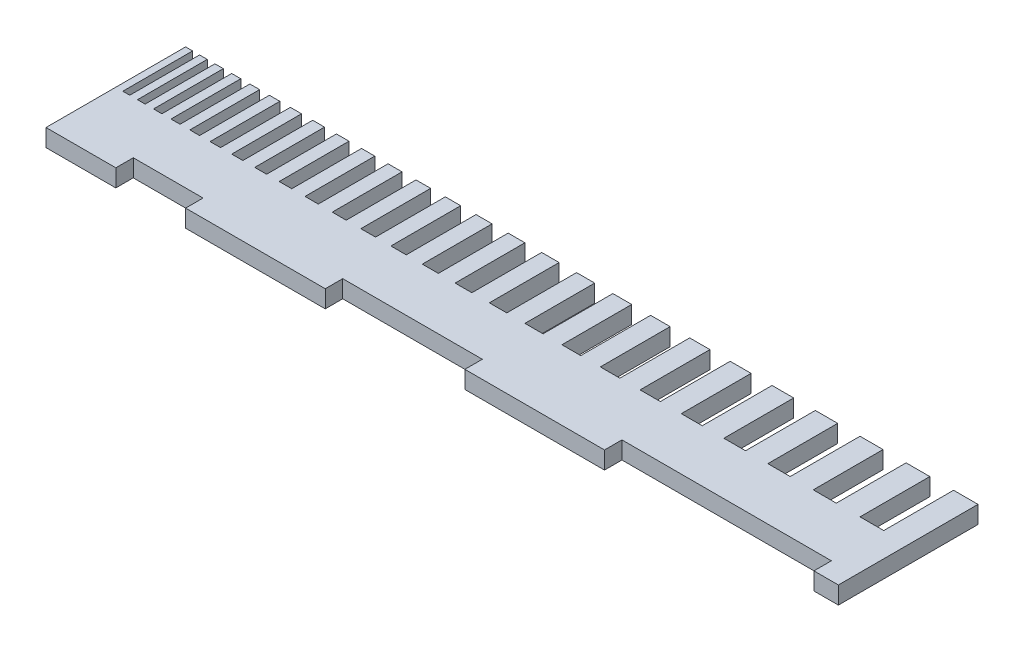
ISO-10303-21;
HEADER;
FILE_DESCRIPTION(('STEP AP214'),'2;1');
FILE_NAME('part.step','',(''),(''),'','','');
FILE_SCHEMA(('AUTOMOTIVE_DESIGN { 1 0 10303 214 1 1 1 1 }'));
ENDSEC;
DATA;
#1=APPLICATION_CONTEXT('core data for automotive mechanical design processes');
#2=APPLICATION_PROTOCOL_DEFINITION('international standard','automotive_design',2000,#1);
#3=PRODUCT_CONTEXT('',#1,'mechanical');
#4=PRODUCT('Part','Part','',(#3));
#5=PRODUCT_RELATED_PRODUCT_CATEGORY('part','',(#4));
#6=PRODUCT_DEFINITION_FORMATION('','',#4);
#7=PRODUCT_DEFINITION_CONTEXT('part definition',#1,'design');
#8=PRODUCT_DEFINITION('design','',#6,#7);
#9=PRODUCT_DEFINITION_SHAPE('','',#8);
#10=(LENGTH_UNIT() NAMED_UNIT(*) SI_UNIT(.MILLI.,.METRE.));
#11=(NAMED_UNIT(*) PLANE_ANGLE_UNIT() SI_UNIT($,.RADIAN.));
#12=(NAMED_UNIT(*) SI_UNIT($,.STERADIAN.) SOLID_ANGLE_UNIT());
#13=UNCERTAINTY_MEASURE_WITH_UNIT(LENGTH_MEASURE(1.E-05),#10,'distance_accuracy_value','');
#14=(GEOMETRIC_REPRESENTATION_CONTEXT(3) GLOBAL_UNCERTAINTY_ASSIGNED_CONTEXT((#13)) GLOBAL_UNIT_ASSIGNED_CONTEXT((#10,
#11,#12)) REPRESENTATION_CONTEXT('',''));
#15=CARTESIAN_POINT('',(0.,0.,0.));
#16=DIRECTION('',(0.,0.,1.));
#17=DIRECTION('',(1.,0.,0.));
#18=AXIS2_PLACEMENT_3D('',#15,#16,#17);
#19=CARTESIAN_POINT('',(279.4,6.35,0.));
#20=DIRECTION('',(1.,0.,0.));
#21=DIRECTION('',(0.,0.,-1.));
#22=AXIS2_PLACEMENT_3D('',#19,#20,#21);
#23=PLANE('',#22);
#24=DIRECTION('',(0.,0.,1.));
#25=VECTOR('',#24,1.);
#26=CARTESIAN_POINT('',(279.4,0.,0.));
#27=LINE('',#26,#25);
#28=CARTESIAN_POINT('',(279.4,0.,-6.35));
#29=VERTEX_POINT('',#28);
#30=CARTESIAN_POINT('',(279.4,0.,0.));
#31=VERTEX_POINT('',#30);
#32=EDGE_CURVE('E788',#29,#31,#27,.T.);
#33=ORIENTED_EDGE('',*,*,#32,.T.);
#34=DIRECTION('',(0.,-1.,0.));
#35=VECTOR('',#34,1.);
#36=CARTESIAN_POINT('',(279.4,6.35,0.));
#37=LINE('',#36,#35);
#38=CARTESIAN_POINT('',(279.4,6.35,0.));
#39=VERTEX_POINT('',#38);
#40=EDGE_CURVE('E11',#39,#31,#37,.T.);
#41=ORIENTED_EDGE('',*,*,#40,.F.);
#42=DIRECTION('',(0.,0.,1.));
#43=VECTOR('',#42,1.);
#44=CARTESIAN_POINT('',(279.4,6.35,0.));
#45=LINE('',#44,#43);
#46=CARTESIAN_POINT('',(279.4,6.35,-6.35));
#47=VERTEX_POINT('',#46);
#48=EDGE_CURVE('E1238',#47,#39,#45,.T.);
#49=ORIENTED_EDGE('',*,*,#48,.F.);
#50=DIRECTION('',(0.,-1.,0.));
#51=VECTOR('',#50,1.);
#52=CARTESIAN_POINT('',(279.4,6.35,-6.35));
#53=LINE('',#52,#51);
#54=EDGE_CURVE('E784',#47,#29,#53,.T.);
#55=ORIENTED_EDGE('',*,*,#54,.T.);
#56=EDGE_LOOP('',(#33,#41,#49,#55));
#57=FACE_BOUND('',#56,.T.);
#58=ADVANCED_FACE('F39',(#57),#23,.F.);
#59=CARTESIAN_POINT('',(0.,6.35,0.));
#60=DIRECTION('',(0.,0.,-1.));
#61=DIRECTION('',(-1.,0.,0.));
#62=AXIS2_PLACEMENT_3D('',#59,#60,#61);
#63=PLANE('',#62);
#64=DIRECTION('',(1.,0.,0.));
#65=VECTOR('',#64,1.);
#66=CARTESIAN_POINT('',(0.,0.,0.));
#67=LINE('',#66,#65);
#68=CARTESIAN_POINT('',(288.29,0.,0.));
#69=VERTEX_POINT('',#68);
#70=EDGE_CURVE('E792',#31,#69,#67,.T.);
#71=ORIENTED_EDGE('',*,*,#70,.T.);
#72=DIRECTION('',(0.,-1.,0.));
#73=VECTOR('',#72,1.);
#74=CARTESIAN_POINT('',(288.29,6.35,0.));
#75=LINE('',#74,#73);
#76=CARTESIAN_POINT('',(288.29,6.35,0.));
#77=VERTEX_POINT('',#76);
#78=EDGE_CURVE('E48',#77,#69,#75,.T.);
#79=ORIENTED_EDGE('',*,*,#78,.F.);
#80=DIRECTION('',(1.,0.,0.));
#81=VECTOR('',#80,1.);
#82=CARTESIAN_POINT('',(0.,6.35,0.));
#83=LINE('',#82,#81);
#84=EDGE_CURVE('E423',#39,#77,#83,.T.);
#85=ORIENTED_EDGE('',*,*,#84,.F.);
#86=ORIENTED_EDGE('',*,*,#40,.T.);
#87=EDGE_LOOP('',(#71,#79,#85,#86));
#88=FACE_BOUND('',#87,.T.);
#89=ADVANCED_FACE('F1588',(#88),#63,.F.);
#90=CARTESIAN_POINT('',(288.29,6.35,0.));
#91=DIRECTION('',(1.,0.,0.));
#92=DIRECTION('',(0.,0.,-1.));
#93=AXIS2_PLACEMENT_3D('',#90,#91,#92);
#94=PLANE('',#93);
#95=DIRECTION('',(0.,0.,1.));
#96=VECTOR('',#95,1.);
#97=CARTESIAN_POINT('',(288.29,0.,0.));
#98=LINE('',#97,#96);
#99=CARTESIAN_POINT('',(288.29,0.,-50.8));
#100=VERTEX_POINT('',#99);
#101=EDGE_CURVE('E796',#100,#69,#98,.T.);
#102=ORIENTED_EDGE('',*,*,#101,.F.);
#103=DIRECTION('',(0.,-1.,0.));
#104=VECTOR('',#103,1.);
#105=CARTESIAN_POINT('',(288.29,6.35,-50.8));
#106=LINE('',#105,#104);
#107=CARTESIAN_POINT('',(288.29,6.35,-50.8));
#108=VERTEX_POINT('',#107);
#109=EDGE_CURVE('E1579',#108,#100,#106,.T.);
#110=ORIENTED_EDGE('',*,*,#109,.F.);
#111=DIRECTION('',(0.,0.,1.));
#112=VECTOR('',#111,1.);
#113=CARTESIAN_POINT('',(288.29,6.35,0.));
#114=LINE('',#113,#112);
#115=EDGE_CURVE('E1587',#108,#77,#114,.T.);
#116=ORIENTED_EDGE('',*,*,#115,.T.);
#117=ORIENTED_EDGE('',*,*,#78,.T.);
#118=EDGE_LOOP('',(#102,#110,#116,#117));
#119=FACE_BOUND('',#118,.T.);
#120=ADVANCED_FACE('F1585',(#119),#94,.T.);
#121=CARTESIAN_POINT('',(0.,6.35,-50.8));
#122=DIRECTION('',(0.,0.,-1.));
#123=DIRECTION('',(-1.,0.,0.));
#124=AXIS2_PLACEMENT_3D('',#121,#122,#123);
#125=PLANE('',#124);
#126=DIRECTION('',(1.,0.,0.));
#127=VECTOR('',#126,1.);
#128=CARTESIAN_POINT('',(0.,0.,-50.8));
#129=LINE('',#128,#127);
#130=CARTESIAN_POINT('',(279.4,0.,-50.8));
#131=VERTEX_POINT('',#130);
#132=EDGE_CURVE('E800',#131,#100,#129,.T.);
#133=ORIENTED_EDGE('',*,*,#132,.F.);
#134=DIRECTION('',(0.,-1.,0.));
#135=VECTOR('',#134,1.);
#136=CARTESIAN_POINT('',(279.4,6.35,-50.8));
#137=LINE('',#136,#135);
#138=CARTESIAN_POINT('',(279.4,6.35,-50.8));
#139=VERTEX_POINT('',#138);
#140=EDGE_CURVE('E1576',#139,#131,#137,.T.);
#141=ORIENTED_EDGE('',*,*,#140,.F.);
#142=DIRECTION('',(1.,0.,0.));
#143=VECTOR('',#142,1.);
#144=CARTESIAN_POINT('',(0.,6.35,-50.8));
#145=LINE('',#144,#143);
#146=EDGE_CURVE('E1600',#139,#108,#145,.T.);
#147=ORIENTED_EDGE('',*,*,#146,.T.);
#148=ORIENTED_EDGE('',*,*,#109,.T.);
#149=EDGE_LOOP('',(#133,#141,#147,#148));
#150=FACE_BOUND('',#149,.T.);
#151=ADVANCED_FACE('F1596',(#150),#125,.T.);
#152=CARTESIAN_POINT('',(279.4,6.35,0.));
#153=DIRECTION('',(1.,0.,0.));
#154=DIRECTION('',(0.,0.,-1.));
#155=AXIS2_PLACEMENT_3D('',#152,#153,#154);
#156=PLANE('',#155);
#157=DIRECTION('',(0.,0.,1.));
#158=VECTOR('',#157,1.);
#159=CARTESIAN_POINT('',(279.4,0.,0.));
#160=LINE('',#159,#158);
#161=CARTESIAN_POINT('',(279.4,0.,-25.4));
#162=VERTEX_POINT('',#161);
#163=EDGE_CURVE('E804',#131,#162,#160,.T.);
#164=ORIENTED_EDGE('',*,*,#163,.T.);
#165=DIRECTION('',(0.,-1.,0.));
#166=VECTOR('',#165,1.);
#167=CARTESIAN_POINT('',(279.4,6.35,-25.4));
#168=LINE('',#167,#166);
#169=CARTESIAN_POINT('',(279.4,6.35,-25.4));
#170=VERTEX_POINT('',#169);
#171=EDGE_CURVE('E1573',#170,#162,#168,.T.);
#172=ORIENTED_EDGE('',*,*,#171,.F.);
#173=DIRECTION('',(0.,0.,1.));
#174=VECTOR('',#173,1.);
#175=CARTESIAN_POINT('',(279.4,6.35,0.));
#176=LINE('',#175,#174);
#177=EDGE_CURVE('E1605',#139,#170,#176,.T.);
#178=ORIENTED_EDGE('',*,*,#177,.F.);
#179=ORIENTED_EDGE('',*,*,#140,.T.);
#180=EDGE_LOOP('',(#164,#172,#178,#179));
#181=FACE_BOUND('',#180,.T.);
#182=ADVANCED_FACE('F2042',(#181),#156,.F.);
#183=CARTESIAN_POINT('',(0.,6.35,-25.4));
#184=DIRECTION('',(0.,0.,-1.));
#185=DIRECTION('',(-1.,0.,0.));
#186=AXIS2_PLACEMENT_3D('',#183,#184,#185);
#187=PLANE('',#186);
#188=DIRECTION('',(1.,0.,0.));
#189=VECTOR('',#188,1.);
#190=CARTESIAN_POINT('',(0.,0.,-25.4));
#191=LINE('',#190,#189);
#192=CARTESIAN_POINT('',(270.764,0.,-25.4));
#193=VERTEX_POINT('',#192);
#194=EDGE_CURVE('E808',#193,#162,#191,.T.);
#195=ORIENTED_EDGE('',*,*,#194,.F.);
#196=DIRECTION('',(0.,-1.,0.));
#197=VECTOR('',#196,1.);
#198=CARTESIAN_POINT('',(270.764,6.35,-25.4));
#199=LINE('',#198,#197);
#200=CARTESIAN_POINT('',(270.764,6.35,-25.4));
#201=VERTEX_POINT('',#200);
#202=EDGE_CURVE('E1570',#201,#193,#199,.T.);
#203=ORIENTED_EDGE('',*,*,#202,.F.);
#204=DIRECTION('',(1.,0.,0.));
#205=VECTOR('',#204,1.);
#206=CARTESIAN_POINT('',(0.,6.35,-25.4));
#207=LINE('',#206,#205);
#208=EDGE_CURVE('E1612',#201,#170,#207,.T.);
#209=ORIENTED_EDGE('',*,*,#208,.T.);
#210=ORIENTED_EDGE('',*,*,#171,.T.);
#211=EDGE_LOOP('',(#195,#203,#209,#210));
#212=FACE_BOUND('',#211,.T.);
#213=ADVANCED_FACE('F2045',(#212),#187,.T.);
#214=CARTESIAN_POINT('',(270.764,6.35,0.));
#215=DIRECTION('',(1.,0.,0.));
#216=DIRECTION('',(0.,0.,-1.));
#217=AXIS2_PLACEMENT_3D('',#214,#215,#216);
#218=PLANE('',#217);
#219=DIRECTION('',(0.,0.,1.));
#220=VECTOR('',#219,1.);
#221=CARTESIAN_POINT('',(270.764,0.,0.));
#222=LINE('',#221,#220);
#223=CARTESIAN_POINT('',(270.764,0.,-50.8));
#224=VERTEX_POINT('',#223);
#225=EDGE_CURVE('E812',#224,#193,#222,.T.);
#226=ORIENTED_EDGE('',*,*,#225,.F.);
#227=DIRECTION('',(0.,-1.,0.));
#228=VECTOR('',#227,1.);
#229=CARTESIAN_POINT('',(270.764,6.35,-50.8));
#230=LINE('',#229,#228);
#231=CARTESIAN_POINT('',(270.764,6.35,-50.8));
#232=VERTEX_POINT('',#231);
#233=EDGE_CURVE('E1567',#232,#224,#230,.T.);
#234=ORIENTED_EDGE('',*,*,#233,.F.);
#235=DIRECTION('',(0.,0.,1.));
#236=VECTOR('',#235,1.);
#237=CARTESIAN_POINT('',(270.764,6.35,0.));
#238=LINE('',#237,#236);
#239=EDGE_CURVE('E1616',#232,#201,#238,.T.);
#240=ORIENTED_EDGE('',*,*,#239,.T.);
#241=ORIENTED_EDGE('',*,*,#202,.T.);
#242=EDGE_LOOP('',(#226,#234,#240,#241));
#243=FACE_BOUND('',#242,.T.);
#244=ADVANCED_FACE('F2049',(#243),#218,.T.);
#245=CARTESIAN_POINT('',(0.,6.35,-50.8));
#246=DIRECTION('',(0.,0.,-1.));
#247=DIRECTION('',(-1.,0.,0.));
#248=AXIS2_PLACEMENT_3D('',#245,#246,#247);
#249=PLANE('',#248);
#250=DIRECTION('',(1.,0.,0.));
#251=VECTOR('',#250,1.);
#252=CARTESIAN_POINT('',(0.,0.,-50.8));
#253=LINE('',#252,#251);
#254=CARTESIAN_POINT('',(262.128,0.,-50.8));
#255=VERTEX_POINT('',#254);
#256=EDGE_CURVE('E816',#255,#224,#253,.T.);
#257=ORIENTED_EDGE('',*,*,#256,.F.);
#258=DIRECTION('',(0.,-1.,0.));
#259=VECTOR('',#258,1.);
#260=CARTESIAN_POINT('',(262.128,6.35,-50.8));
#261=LINE('',#260,#259);
#262=CARTESIAN_POINT('',(262.128,6.35,-50.8));
#263=VERTEX_POINT('',#262);
#264=EDGE_CURVE('E1564',#263,#255,#261,.T.);
#265=ORIENTED_EDGE('',*,*,#264,.F.);
#266=DIRECTION('',(1.,0.,0.));
#267=VECTOR('',#266,1.);
#268=CARTESIAN_POINT('',(0.,6.35,-50.8));
#269=LINE('',#268,#267);
#270=EDGE_CURVE('E1620',#263,#232,#269,.T.);
#271=ORIENTED_EDGE('',*,*,#270,.T.);
#272=ORIENTED_EDGE('',*,*,#233,.T.);
#273=EDGE_LOOP('',(#257,#265,#271,#272));
#274=FACE_BOUND('',#273,.T.);
#275=ADVANCED_FACE('F2053',(#274),#249,.T.);
#276=CARTESIAN_POINT('',(262.128,6.35,0.));
#277=DIRECTION('',(1.,0.,0.));
#278=DIRECTION('',(0.,0.,-1.));
#279=AXIS2_PLACEMENT_3D('',#276,#277,#278);
#280=PLANE('',#279);
#281=DIRECTION('',(0.,0.,1.));
#282=VECTOR('',#281,1.);
#283=CARTESIAN_POINT('',(262.128,0.,0.));
#284=LINE('',#283,#282);
#285=CARTESIAN_POINT('',(262.128,0.,-25.4));
#286=VERTEX_POINT('',#285);
#287=EDGE_CURVE('E820',#255,#286,#284,.T.);
#288=ORIENTED_EDGE('',*,*,#287,.T.);
#289=DIRECTION('',(0.,-1.,0.));
#290=VECTOR('',#289,1.);
#291=CARTESIAN_POINT('',(262.128,6.35,-25.4));
#292=LINE('',#291,#290);
#293=CARTESIAN_POINT('',(262.128,6.35,-25.4));
#294=VERTEX_POINT('',#293);
#295=EDGE_CURVE('E1561',#294,#286,#292,.T.);
#296=ORIENTED_EDGE('',*,*,#295,.F.);
#297=DIRECTION('',(0.,0.,1.));
#298=VECTOR('',#297,1.);
#299=CARTESIAN_POINT('',(262.128,6.35,0.));
#300=LINE('',#299,#298);
#301=EDGE_CURVE('E1624',#263,#294,#300,.T.);
#302=ORIENTED_EDGE('',*,*,#301,.F.);
#303=ORIENTED_EDGE('',*,*,#264,.T.);
#304=EDGE_LOOP('',(#288,#296,#302,#303));
#305=FACE_BOUND('',#304,.T.);
#306=ADVANCED_FACE('F2057',(#305),#280,.F.);
#307=CARTESIAN_POINT('',(0.,6.35,-25.4));
#308=DIRECTION('',(0.,0.,-1.));
#309=DIRECTION('',(-1.,0.,0.));
#310=AXIS2_PLACEMENT_3D('',#307,#308,#309);
#311=PLANE('',#310);
#312=DIRECTION('',(1.,0.,0.));
#313=VECTOR('',#312,1.);
#314=CARTESIAN_POINT('',(0.,0.,-25.4));
#315=LINE('',#314,#313);
#316=CARTESIAN_POINT('',(253.746,0.,-25.4));
#317=VERTEX_POINT('',#316);
#318=EDGE_CURVE('E824',#317,#286,#315,.T.);
#319=ORIENTED_EDGE('',*,*,#318,.F.);
#320=DIRECTION('',(0.,-1.,0.));
#321=VECTOR('',#320,1.);
#322=CARTESIAN_POINT('',(253.746,6.35,-25.4));
#323=LINE('',#322,#321);
#324=CARTESIAN_POINT('',(253.746,6.35,-25.4));
#325=VERTEX_POINT('',#324);
#326=EDGE_CURVE('E1558',#325,#317,#323,.T.);
#327=ORIENTED_EDGE('',*,*,#326,.F.);
#328=DIRECTION('',(1.,0.,0.));
#329=VECTOR('',#328,1.);
#330=CARTESIAN_POINT('',(0.,6.35,-25.4));
#331=LINE('',#330,#329);
#332=EDGE_CURVE('E1627',#325,#294,#331,.T.);
#333=ORIENTED_EDGE('',*,*,#332,.T.);
#334=ORIENTED_EDGE('',*,*,#295,.T.);
#335=EDGE_LOOP('',(#319,#327,#333,#334));
#336=FACE_BOUND('',#335,.T.);
#337=ADVANCED_FACE('F2061',(#336),#311,.T.);
#338=CARTESIAN_POINT('',(253.746,6.35,0.));
#339=DIRECTION('',(1.,0.,0.));
#340=DIRECTION('',(0.,0.,-1.));
#341=AXIS2_PLACEMENT_3D('',#338,#339,#340);
#342=PLANE('',#341);
#343=DIRECTION('',(0.,0.,1.));
#344=VECTOR('',#343,1.);
#345=CARTESIAN_POINT('',(253.746,0.,0.));
#346=LINE('',#345,#344);
#347=CARTESIAN_POINT('',(253.746,0.,-50.8));
#348=VERTEX_POINT('',#347);
#349=EDGE_CURVE('E828',#348,#317,#346,.T.);
#350=ORIENTED_EDGE('',*,*,#349,.F.);
#351=DIRECTION('',(0.,-1.,0.));
#352=VECTOR('',#351,1.);
#353=CARTESIAN_POINT('',(253.746,6.35,-50.8));
#354=LINE('',#353,#352);
#355=CARTESIAN_POINT('',(253.746,6.35,-50.8));
#356=VERTEX_POINT('',#355);
#357=EDGE_CURVE('E1555',#356,#348,#354,.T.);
#358=ORIENTED_EDGE('',*,*,#357,.F.);
#359=DIRECTION('',(0.,0.,1.));
#360=VECTOR('',#359,1.);
#361=CARTESIAN_POINT('',(253.746,6.35,0.));
#362=LINE('',#361,#360);
#363=EDGE_CURVE('E1631',#356,#325,#362,.T.);
#364=ORIENTED_EDGE('',*,*,#363,.T.);
#365=ORIENTED_EDGE('',*,*,#326,.T.);
#366=EDGE_LOOP('',(#350,#358,#364,#365));
#367=FACE_BOUND('',#366,.T.);
#368=ADVANCED_FACE('F2065',(#367),#342,.T.);
#369=CARTESIAN_POINT('',(0.,6.35,-50.8));
#370=DIRECTION('',(0.,0.,-1.));
#371=DIRECTION('',(-1.,0.,0.));
#372=AXIS2_PLACEMENT_3D('',#369,#370,#371);
#373=PLANE('',#372);
#374=DIRECTION('',(1.,0.,0.));
#375=VECTOR('',#374,1.);
#376=CARTESIAN_POINT('',(0.,0.,-50.8));
#377=LINE('',#376,#375);
#378=CARTESIAN_POINT('',(245.364,0.,-50.8));
#379=VERTEX_POINT('',#378);
#380=EDGE_CURVE('E832',#379,#348,#377,.T.);
#381=ORIENTED_EDGE('',*,*,#380,.F.);
#382=DIRECTION('',(0.,-1.,0.));
#383=VECTOR('',#382,1.);
#384=CARTESIAN_POINT('',(245.364,6.35,-50.8));
#385=LINE('',#384,#383);
#386=CARTESIAN_POINT('',(245.364,6.35,-50.8));
#387=VERTEX_POINT('',#386);
#388=EDGE_CURVE('E1552',#387,#379,#385,.T.);
#389=ORIENTED_EDGE('',*,*,#388,.F.);
#390=DIRECTION('',(1.,0.,0.));
#391=VECTOR('',#390,1.);
#392=CARTESIAN_POINT('',(0.,6.35,-50.8));
#393=LINE('',#392,#391);
#394=EDGE_CURVE('E1635',#387,#356,#393,.T.);
#395=ORIENTED_EDGE('',*,*,#394,.T.);
#396=ORIENTED_EDGE('',*,*,#357,.T.);
#397=EDGE_LOOP('',(#381,#389,#395,#396));
#398=FACE_BOUND('',#397,.T.);
#399=ADVANCED_FACE('F2069',(#398),#373,.T.);
#400=CARTESIAN_POINT('',(245.364,6.35,0.));
#401=DIRECTION('',(1.,0.,0.));
#402=DIRECTION('',(0.,0.,-1.));
#403=AXIS2_PLACEMENT_3D('',#400,#401,#402);
#404=PLANE('',#403);
#405=DIRECTION('',(0.,0.,1.));
#406=VECTOR('',#405,1.);
#407=CARTESIAN_POINT('',(245.364,0.,0.));
#408=LINE('',#407,#406);
#409=CARTESIAN_POINT('',(245.364,0.,-25.4));
#410=VERTEX_POINT('',#409);
#411=EDGE_CURVE('E836',#379,#410,#408,.T.);
#412=ORIENTED_EDGE('',*,*,#411,.T.);
#413=DIRECTION('',(0.,-1.,0.));
#414=VECTOR('',#413,1.);
#415=CARTESIAN_POINT('',(245.364,6.35,-25.4));
#416=LINE('',#415,#414);
#417=CARTESIAN_POINT('',(245.364,6.35,-25.4));
#418=VERTEX_POINT('',#417);
#419=EDGE_CURVE('E1549',#418,#410,#416,.T.);
#420=ORIENTED_EDGE('',*,*,#419,.F.);
#421=DIRECTION('',(0.,0.,1.));
#422=VECTOR('',#421,1.);
#423=CARTESIAN_POINT('',(245.364,6.35,0.));
#424=LINE('',#423,#422);
#425=EDGE_CURVE('E1639',#387,#418,#424,.T.);
#426=ORIENTED_EDGE('',*,*,#425,.F.);
#427=ORIENTED_EDGE('',*,*,#388,.T.);
#428=EDGE_LOOP('',(#412,#420,#426,#427));
#429=FACE_BOUND('',#428,.T.);
#430=ADVANCED_FACE('F2073',(#429),#404,.F.);
#431=CARTESIAN_POINT('',(0.,6.35,-25.4));
#432=DIRECTION('',(0.,0.,-1.));
#433=DIRECTION('',(-1.,0.,0.));
#434=AXIS2_PLACEMENT_3D('',#431,#432,#433);
#435=PLANE('',#434);
#436=DIRECTION('',(1.,0.,0.));
#437=VECTOR('',#436,1.);
#438=CARTESIAN_POINT('',(0.,0.,-25.4));
#439=LINE('',#438,#437);
#440=CARTESIAN_POINT('',(237.236,0.,-25.4));
#441=VERTEX_POINT('',#440);
#442=EDGE_CURVE('E840',#441,#410,#439,.T.);
#443=ORIENTED_EDGE('',*,*,#442,.F.);
#444=DIRECTION('',(0.,-1.,0.));
#445=VECTOR('',#444,1.);
#446=CARTESIAN_POINT('',(237.236,6.35,-25.4));
#447=LINE('',#446,#445);
#448=CARTESIAN_POINT('',(237.236,6.35,-25.4));
#449=VERTEX_POINT('',#448);
#450=EDGE_CURVE('E1546',#449,#441,#447,.T.);
#451=ORIENTED_EDGE('',*,*,#450,.F.);
#452=DIRECTION('',(1.,0.,0.));
#453=VECTOR('',#452,1.);
#454=CARTESIAN_POINT('',(0.,6.35,-25.4));
#455=LINE('',#454,#453);
#456=EDGE_CURVE('E1642',#449,#418,#455,.T.);
#457=ORIENTED_EDGE('',*,*,#456,.T.);
#458=ORIENTED_EDGE('',*,*,#419,.T.);
#459=EDGE_LOOP('',(#443,#451,#457,#458));
#460=FACE_BOUND('',#459,.T.);
#461=ADVANCED_FACE('F2077',(#460),#435,.T.);
#462=CARTESIAN_POINT('',(237.236,6.35,0.));
#463=DIRECTION('',(1.,0.,0.));
#464=DIRECTION('',(0.,0.,-1.));
#465=AXIS2_PLACEMENT_3D('',#462,#463,#464);
#466=PLANE('',#465);
#467=DIRECTION('',(0.,0.,1.));
#468=VECTOR('',#467,1.);
#469=CARTESIAN_POINT('',(237.236,0.,0.));
#470=LINE('',#469,#468);
#471=CARTESIAN_POINT('',(237.236,0.,-50.8));
#472=VERTEX_POINT('',#471);
#473=EDGE_CURVE('E844',#472,#441,#470,.T.);
#474=ORIENTED_EDGE('',*,*,#473,.F.);
#475=DIRECTION('',(0.,-1.,0.));
#476=VECTOR('',#475,1.);
#477=CARTESIAN_POINT('',(237.236,6.35,-50.8));
#478=LINE('',#477,#476);
#479=CARTESIAN_POINT('',(237.236,6.35,-50.8));
#480=VERTEX_POINT('',#479);
#481=EDGE_CURVE('E1543',#480,#472,#478,.T.);
#482=ORIENTED_EDGE('',*,*,#481,.F.);
#483=DIRECTION('',(0.,0.,1.));
#484=VECTOR('',#483,1.);
#485=CARTESIAN_POINT('',(237.236,6.35,0.));
#486=LINE('',#485,#484);
#487=EDGE_CURVE('E1646',#480,#449,#486,.T.);
#488=ORIENTED_EDGE('',*,*,#487,.T.);
#489=ORIENTED_EDGE('',*,*,#450,.T.);
#490=EDGE_LOOP('',(#474,#482,#488,#489));
#491=FACE_BOUND('',#490,.T.);
#492=ADVANCED_FACE('F2081',(#491),#466,.T.);
#493=CARTESIAN_POINT('',(0.,6.35,-50.8));
#494=DIRECTION('',(0.,0.,-1.));
#495=DIRECTION('',(-1.,0.,0.));
#496=AXIS2_PLACEMENT_3D('',#493,#494,#495);
#497=PLANE('',#496);
#498=DIRECTION('',(1.,0.,0.));
#499=VECTOR('',#498,1.);
#500=CARTESIAN_POINT('',(0.,0.,-50.8));
#501=LINE('',#500,#499);
#502=CARTESIAN_POINT('',(229.108,0.,-50.8));
#503=VERTEX_POINT('',#502);
#504=EDGE_CURVE('E848',#503,#472,#501,.T.);
#505=ORIENTED_EDGE('',*,*,#504,.F.);
#506=DIRECTION('',(0.,-1.,0.));
#507=VECTOR('',#506,1.);
#508=CARTESIAN_POINT('',(229.108,6.35,-50.8));
#509=LINE('',#508,#507);
#510=CARTESIAN_POINT('',(229.108,6.35,-50.8));
#511=VERTEX_POINT('',#510);
#512=EDGE_CURVE('E1540',#511,#503,#509,.T.);
#513=ORIENTED_EDGE('',*,*,#512,.F.);
#514=DIRECTION('',(1.,0.,0.));
#515=VECTOR('',#514,1.);
#516=CARTESIAN_POINT('',(0.,6.35,-50.8));
#517=LINE('',#516,#515);
#518=EDGE_CURVE('E1650',#511,#480,#517,.T.);
#519=ORIENTED_EDGE('',*,*,#518,.T.);
#520=ORIENTED_EDGE('',*,*,#481,.T.);
#521=EDGE_LOOP('',(#505,#513,#519,#520));
#522=FACE_BOUND('',#521,.T.);
#523=ADVANCED_FACE('F2085',(#522),#497,.T.);
#524=CARTESIAN_POINT('',(229.108,6.35,0.));
#525=DIRECTION('',(1.,0.,0.));
#526=DIRECTION('',(0.,0.,-1.));
#527=AXIS2_PLACEMENT_3D('',#524,#525,#526);
#528=PLANE('',#527);
#529=DIRECTION('',(0.,0.,1.));
#530=VECTOR('',#529,1.);
#531=CARTESIAN_POINT('',(229.108,0.,0.));
#532=LINE('',#531,#530);
#533=CARTESIAN_POINT('',(229.108,0.,-25.4));
#534=VERTEX_POINT('',#533);
#535=EDGE_CURVE('E852',#503,#534,#532,.T.);
#536=ORIENTED_EDGE('',*,*,#535,.T.);
#537=DIRECTION('',(0.,-1.,0.));
#538=VECTOR('',#537,1.);
#539=CARTESIAN_POINT('',(229.108,6.35,-25.4));
#540=LINE('',#539,#538);
#541=CARTESIAN_POINT('',(229.108,6.35,-25.4));
#542=VERTEX_POINT('',#541);
#543=EDGE_CURVE('E1537',#542,#534,#540,.T.);
#544=ORIENTED_EDGE('',*,*,#543,.F.);
#545=DIRECTION('',(0.,0.,1.));
#546=VECTOR('',#545,1.);
#547=CARTESIAN_POINT('',(229.108,6.35,0.));
#548=LINE('',#547,#546);
#549=EDGE_CURVE('E1654',#511,#542,#548,.T.);
#550=ORIENTED_EDGE('',*,*,#549,.F.);
#551=ORIENTED_EDGE('',*,*,#512,.T.);
#552=EDGE_LOOP('',(#536,#544,#550,#551));
#553=FACE_BOUND('',#552,.T.);
#554=ADVANCED_FACE('F2089',(#553),#528,.F.);
#555=CARTESIAN_POINT('',(0.,6.35,-25.4));
#556=DIRECTION('',(0.,0.,-1.));
#557=DIRECTION('',(-1.,0.,0.));
#558=AXIS2_PLACEMENT_3D('',#555,#556,#557);
#559=PLANE('',#558);
#560=DIRECTION('',(1.,0.,0.));
#561=VECTOR('',#560,1.);
#562=CARTESIAN_POINT('',(0.,0.,-25.4));
#563=LINE('',#562,#561);
#564=CARTESIAN_POINT('',(221.234,0.,-25.4));
#565=VERTEX_POINT('',#564);
#566=EDGE_CURVE('E856',#565,#534,#563,.T.);
#567=ORIENTED_EDGE('',*,*,#566,.F.);
#568=DIRECTION('',(0.,-1.,0.));
#569=VECTOR('',#568,1.);
#570=CARTESIAN_POINT('',(221.234,6.35,-25.4));
#571=LINE('',#570,#569);
#572=CARTESIAN_POINT('',(221.234,6.35,-25.4));
#573=VERTEX_POINT('',#572);
#574=EDGE_CURVE('E1534',#573,#565,#571,.T.);
#575=ORIENTED_EDGE('',*,*,#574,.F.);
#576=DIRECTION('',(1.,0.,0.));
#577=VECTOR('',#576,1.);
#578=CARTESIAN_POINT('',(0.,6.35,-25.4));
#579=LINE('',#578,#577);
#580=EDGE_CURVE('E1657',#573,#542,#579,.T.);
#581=ORIENTED_EDGE('',*,*,#580,.T.);
#582=ORIENTED_EDGE('',*,*,#543,.T.);
#583=EDGE_LOOP('',(#567,#575,#581,#582));
#584=FACE_BOUND('',#583,.T.);
#585=ADVANCED_FACE('F2093',(#584),#559,.T.);
#586=CARTESIAN_POINT('',(221.234,6.35,0.));
#587=DIRECTION('',(1.,0.,0.));
#588=DIRECTION('',(0.,0.,-1.));
#589=AXIS2_PLACEMENT_3D('',#586,#587,#588);
#590=PLANE('',#589);
#591=DIRECTION('',(0.,0.,1.));
#592=VECTOR('',#591,1.);
#593=CARTESIAN_POINT('',(221.234,0.,0.));
#594=LINE('',#593,#592);
#595=CARTESIAN_POINT('',(221.234,0.,-50.8));
#596=VERTEX_POINT('',#595);
#597=EDGE_CURVE('E860',#596,#565,#594,.T.);
#598=ORIENTED_EDGE('',*,*,#597,.F.);
#599=DIRECTION('',(0.,-1.,0.));
#600=VECTOR('',#599,1.);
#601=CARTESIAN_POINT('',(221.234,6.35,-50.8));
#602=LINE('',#601,#600);
#603=CARTESIAN_POINT('',(221.234,6.35,-50.8));
#604=VERTEX_POINT('',#603);
#605=EDGE_CURVE('E1531',#604,#596,#602,.T.);
#606=ORIENTED_EDGE('',*,*,#605,.F.);
#607=DIRECTION('',(0.,0.,1.));
#608=VECTOR('',#607,1.);
#609=CARTESIAN_POINT('',(221.234,6.35,0.));
#610=LINE('',#609,#608);
#611=EDGE_CURVE('E1661',#604,#573,#610,.T.);
#612=ORIENTED_EDGE('',*,*,#611,.T.);
#613=ORIENTED_EDGE('',*,*,#574,.T.);
#614=EDGE_LOOP('',(#598,#606,#612,#613));
#615=FACE_BOUND('',#614,.T.);
#616=ADVANCED_FACE('F2097',(#615),#590,.T.);
#617=CARTESIAN_POINT('',(0.,6.35,-50.8));
#618=DIRECTION('',(0.,0.,-1.));
#619=DIRECTION('',(-1.,0.,0.));
#620=AXIS2_PLACEMENT_3D('',#617,#618,#619);
#621=PLANE('',#620);
#622=DIRECTION('',(1.,0.,0.));
#623=VECTOR('',#622,1.);
#624=CARTESIAN_POINT('',(0.,0.,-50.8));
#625=LINE('',#624,#623);
#626=CARTESIAN_POINT('',(213.36,0.,-50.8));
#627=VERTEX_POINT('',#626);
#628=EDGE_CURVE('E864',#627,#596,#625,.T.);
#629=ORIENTED_EDGE('',*,*,#628,.F.);
#630=DIRECTION('',(0.,-1.,0.));
#631=VECTOR('',#630,1.);
#632=CARTESIAN_POINT('',(213.36,6.35,-50.8));
#633=LINE('',#632,#631);
#634=CARTESIAN_POINT('',(213.36,6.35,-50.8));
#635=VERTEX_POINT('',#634);
#636=EDGE_CURVE('E1528',#635,#627,#633,.T.);
#637=ORIENTED_EDGE('',*,*,#636,.F.);
#638=DIRECTION('',(1.,0.,0.));
#639=VECTOR('',#638,1.);
#640=CARTESIAN_POINT('',(0.,6.35,-50.8));
#641=LINE('',#640,#639);
#642=EDGE_CURVE('E1665',#635,#604,#641,.T.);
#643=ORIENTED_EDGE('',*,*,#642,.T.);
#644=ORIENTED_EDGE('',*,*,#605,.T.);
#645=EDGE_LOOP('',(#629,#637,#643,#644));
#646=FACE_BOUND('',#645,.T.);
#647=ADVANCED_FACE('F2101',(#646),#621,.T.);
#648=CARTESIAN_POINT('',(213.36,6.35,0.));
#649=DIRECTION('',(1.,0.,0.));
#650=DIRECTION('',(0.,0.,-1.));
#651=AXIS2_PLACEMENT_3D('',#648,#649,#650);
#652=PLANE('',#651);
#653=DIRECTION('',(0.,0.,1.));
#654=VECTOR('',#653,1.);
#655=CARTESIAN_POINT('',(213.36,0.,0.));
#656=LINE('',#655,#654);
#657=CARTESIAN_POINT('',(213.36,0.,-25.4));
#658=VERTEX_POINT('',#657);
#659=EDGE_CURVE('E868',#627,#658,#656,.T.);
#660=ORIENTED_EDGE('',*,*,#659,.T.);
#661=DIRECTION('',(0.,-1.,0.));
#662=VECTOR('',#661,1.);
#663=CARTESIAN_POINT('',(213.36,6.35,-25.4));
#664=LINE('',#663,#662);
#665=CARTESIAN_POINT('',(213.36,6.35,-25.4));
#666=VERTEX_POINT('',#665);
#667=EDGE_CURVE('E1525',#666,#658,#664,.T.);
#668=ORIENTED_EDGE('',*,*,#667,.F.);
#669=DIRECTION('',(0.,0.,1.));
#670=VECTOR('',#669,1.);
#671=CARTESIAN_POINT('',(213.36,6.35,0.));
#672=LINE('',#671,#670);
#673=EDGE_CURVE('E1669',#635,#666,#672,.T.);
#674=ORIENTED_EDGE('',*,*,#673,.F.);
#675=ORIENTED_EDGE('',*,*,#636,.T.);
#676=EDGE_LOOP('',(#660,#668,#674,#675));
#677=FACE_BOUND('',#676,.T.);
#678=ADVANCED_FACE('F2105',(#677),#652,.F.);
#679=CARTESIAN_POINT('',(0.,6.35,-25.4));
#680=DIRECTION('',(0.,0.,-1.));
#681=DIRECTION('',(-1.,0.,0.));
#682=AXIS2_PLACEMENT_3D('',#679,#680,#681);
#683=PLANE('',#682);
#684=DIRECTION('',(1.,0.,0.));
#685=VECTOR('',#684,1.);
#686=CARTESIAN_POINT('',(0.,0.,-25.4));
#687=LINE('',#686,#685);
#688=CARTESIAN_POINT('',(205.74,0.,-25.4));
#689=VERTEX_POINT('',#688);
#690=EDGE_CURVE('E872',#689,#658,#687,.T.);
#691=ORIENTED_EDGE('',*,*,#690,.F.);
#692=DIRECTION('',(0.,-1.,0.));
#693=VECTOR('',#692,1.);
#694=CARTESIAN_POINT('',(205.74,6.35,-25.4));
#695=LINE('',#694,#693);
#696=CARTESIAN_POINT('',(205.74,6.35,-25.4));
#697=VERTEX_POINT('',#696);
#698=EDGE_CURVE('E1522',#697,#689,#695,.T.);
#699=ORIENTED_EDGE('',*,*,#698,.F.);
#700=DIRECTION('',(1.,0.,0.));
#701=VECTOR('',#700,1.);
#702=CARTESIAN_POINT('',(0.,6.35,-25.4));
#703=LINE('',#702,#701);
#704=EDGE_CURVE('E1672',#697,#666,#703,.T.);
#705=ORIENTED_EDGE('',*,*,#704,.T.);
#706=ORIENTED_EDGE('',*,*,#667,.T.);
#707=EDGE_LOOP('',(#691,#699,#705,#706));
#708=FACE_BOUND('',#707,.T.);
#709=ADVANCED_FACE('F2109',(#708),#683,.T.);
#710=CARTESIAN_POINT('',(205.74,6.35,0.));
#711=DIRECTION('',(1.,0.,0.));
#712=DIRECTION('',(0.,0.,-1.));
#713=AXIS2_PLACEMENT_3D('',#710,#711,#712);
#714=PLANE('',#713);
#715=DIRECTION('',(0.,0.,1.));
#716=VECTOR('',#715,1.);
#717=CARTESIAN_POINT('',(205.74,0.,0.));
#718=LINE('',#717,#716);
#719=CARTESIAN_POINT('',(205.74,0.,-50.8));
#720=VERTEX_POINT('',#719);
#721=EDGE_CURVE('E876',#720,#689,#718,.T.);
#722=ORIENTED_EDGE('',*,*,#721,.F.);
#723=DIRECTION('',(0.,-1.,0.));
#724=VECTOR('',#723,1.);
#725=CARTESIAN_POINT('',(205.74,6.35,-50.8));
#726=LINE('',#725,#724);
#727=CARTESIAN_POINT('',(205.74,6.35,-50.8));
#728=VERTEX_POINT('',#727);
#729=EDGE_CURVE('E1519',#728,#720,#726,.T.);
#730=ORIENTED_EDGE('',*,*,#729,.F.);
#731=DIRECTION('',(0.,0.,1.));
#732=VECTOR('',#731,1.);
#733=CARTESIAN_POINT('',(205.74,6.35,0.));
#734=LINE('',#733,#732);
#735=EDGE_CURVE('E1676',#728,#697,#734,.T.);
#736=ORIENTED_EDGE('',*,*,#735,.T.);
#737=ORIENTED_EDGE('',*,*,#698,.T.);
#738=EDGE_LOOP('',(#722,#730,#736,#737));
#739=FACE_BOUND('',#738,.T.);
#740=ADVANCED_FACE('F2113',(#739),#714,.T.);
#741=CARTESIAN_POINT('',(0.,6.35,-50.8));
#742=DIRECTION('',(0.,0.,-1.));
#743=DIRECTION('',(-1.,0.,0.));
#744=AXIS2_PLACEMENT_3D('',#741,#742,#743);
#745=PLANE('',#744);
#746=DIRECTION('',(1.,0.,0.));
#747=VECTOR('',#746,1.);
#748=CARTESIAN_POINT('',(0.,0.,-50.8));
#749=LINE('',#748,#747);
#750=CARTESIAN_POINT('',(198.12,0.,-50.8));
#751=VERTEX_POINT('',#750);
#752=EDGE_CURVE('E880',#751,#720,#749,.T.);
#753=ORIENTED_EDGE('',*,*,#752,.F.);
#754=DIRECTION('',(0.,-1.,0.));
#755=VECTOR('',#754,1.);
#756=CARTESIAN_POINT('',(198.12,6.35,-50.8));
#757=LINE('',#756,#755);
#758=CARTESIAN_POINT('',(198.12,6.35,-50.8));
#759=VERTEX_POINT('',#758);
#760=EDGE_CURVE('E1516',#759,#751,#757,.T.);
#761=ORIENTED_EDGE('',*,*,#760,.F.);
#762=DIRECTION('',(1.,0.,0.));
#763=VECTOR('',#762,1.);
#764=CARTESIAN_POINT('',(0.,6.35,-50.8));
#765=LINE('',#764,#763);
#766=EDGE_CURVE('E1680',#759,#728,#765,.T.);
#767=ORIENTED_EDGE('',*,*,#766,.T.);
#768=ORIENTED_EDGE('',*,*,#729,.T.);
#769=EDGE_LOOP('',(#753,#761,#767,#768));
#770=FACE_BOUND('',#769,.T.);
#771=ADVANCED_FACE('F2117',(#770),#745,.T.);
#772=CARTESIAN_POINT('',(198.12,6.35,0.));
#773=DIRECTION('',(1.,0.,0.));
#774=DIRECTION('',(0.,0.,-1.));
#775=AXIS2_PLACEMENT_3D('',#772,#773,#774);
#776=PLANE('',#775);
#777=DIRECTION('',(0.,0.,1.));
#778=VECTOR('',#777,1.);
#779=CARTESIAN_POINT('',(198.12,0.,0.));
#780=LINE('',#779,#778);
#781=CARTESIAN_POINT('',(198.12,0.,-25.4));
#782=VERTEX_POINT('',#781);
#783=EDGE_CURVE('E884',#751,#782,#780,.T.);
#784=ORIENTED_EDGE('',*,*,#783,.T.);
#785=DIRECTION('',(0.,-1.,0.));
#786=VECTOR('',#785,1.);
#787=CARTESIAN_POINT('',(198.12,6.35,-25.4));
#788=LINE('',#787,#786);
#789=CARTESIAN_POINT('',(198.12,6.35,-25.4));
#790=VERTEX_POINT('',#789);
#791=EDGE_CURVE('E1513',#790,#782,#788,.T.);
#792=ORIENTED_EDGE('',*,*,#791,.F.);
#793=DIRECTION('',(0.,0.,1.));
#794=VECTOR('',#793,1.);
#795=CARTESIAN_POINT('',(198.12,6.35,0.));
#796=LINE('',#795,#794);
#797=EDGE_CURVE('E1684',#759,#790,#796,.T.);
#798=ORIENTED_EDGE('',*,*,#797,.F.);
#799=ORIENTED_EDGE('',*,*,#760,.T.);
#800=EDGE_LOOP('',(#784,#792,#798,#799));
#801=FACE_BOUND('',#800,.T.);
#802=ADVANCED_FACE('F2121',(#801),#776,.F.);
#803=CARTESIAN_POINT('',(0.,6.35,-25.4));
#804=DIRECTION('',(0.,0.,-1.));
#805=DIRECTION('',(-1.,0.,0.));
#806=AXIS2_PLACEMENT_3D('',#803,#804,#805);
#807=PLANE('',#806);
#808=DIRECTION('',(1.,0.,0.));
#809=VECTOR('',#808,1.);
#810=CARTESIAN_POINT('',(0.,0.,-25.4));
#811=LINE('',#810,#809);
#812=CARTESIAN_POINT('',(190.754,0.,-25.4));
#813=VERTEX_POINT('',#812);
#814=EDGE_CURVE('E888',#813,#782,#811,.T.);
#815=ORIENTED_EDGE('',*,*,#814,.F.);
#816=DIRECTION('',(0.,-1.,0.));
#817=VECTOR('',#816,1.);
#818=CARTESIAN_POINT('',(190.754,6.35,-25.4));
#819=LINE('',#818,#817);
#820=CARTESIAN_POINT('',(190.754,6.35,-25.4));
#821=VERTEX_POINT('',#820);
#822=EDGE_CURVE('E1510',#821,#813,#819,.T.);
#823=ORIENTED_EDGE('',*,*,#822,.F.);
#824=DIRECTION('',(1.,0.,0.));
#825=VECTOR('',#824,1.);
#826=CARTESIAN_POINT('',(0.,6.35,-25.4));
#827=LINE('',#826,#825);
#828=EDGE_CURVE('E1687',#821,#790,#827,.T.);
#829=ORIENTED_EDGE('',*,*,#828,.T.);
#830=ORIENTED_EDGE('',*,*,#791,.T.);
#831=EDGE_LOOP('',(#815,#823,#829,#830));
#832=FACE_BOUND('',#831,.T.);
#833=ADVANCED_FACE('F2125',(#832),#807,.T.);
#834=CARTESIAN_POINT('',(190.754,6.35,0.));
#835=DIRECTION('',(1.,0.,0.));
#836=DIRECTION('',(0.,0.,-1.));
#837=AXIS2_PLACEMENT_3D('',#834,#835,#836);
#838=PLANE('',#837);
#839=DIRECTION('',(0.,0.,1.));
#840=VECTOR('',#839,1.);
#841=CARTESIAN_POINT('',(190.754,0.,0.));
#842=LINE('',#841,#840);
#843=CARTESIAN_POINT('',(190.754,0.,-50.8));
#844=VERTEX_POINT('',#843);
#845=EDGE_CURVE('E892',#844,#813,#842,.T.);
#846=ORIENTED_EDGE('',*,*,#845,.F.);
#847=DIRECTION('',(0.,-1.,0.));
#848=VECTOR('',#847,1.);
#849=CARTESIAN_POINT('',(190.754,6.35,-50.8));
#850=LINE('',#849,#848);
#851=CARTESIAN_POINT('',(190.754,6.35,-50.8));
#852=VERTEX_POINT('',#851);
#853=EDGE_CURVE('E1507',#852,#844,#850,.T.);
#854=ORIENTED_EDGE('',*,*,#853,.F.);
#855=DIRECTION('',(0.,0.,1.));
#856=VECTOR('',#855,1.);
#857=CARTESIAN_POINT('',(190.754,6.35,0.));
#858=LINE('',#857,#856);
#859=EDGE_CURVE('E1691',#852,#821,#858,.T.);
#860=ORIENTED_EDGE('',*,*,#859,.T.);
#861=ORIENTED_EDGE('',*,*,#822,.T.);
#862=EDGE_LOOP('',(#846,#854,#860,#861));
#863=FACE_BOUND('',#862,.T.);
#864=ADVANCED_FACE('F2129',(#863),#838,.T.);
#865=CARTESIAN_POINT('',(0.,6.35,-50.8));
#866=DIRECTION('',(0.,0.,-1.));
#867=DIRECTION('',(-1.,0.,0.));
#868=AXIS2_PLACEMENT_3D('',#865,#866,#867);
#869=PLANE('',#868);
#870=DIRECTION('',(1.,0.,0.));
#871=VECTOR('',#870,1.);
#872=CARTESIAN_POINT('',(0.,0.,-50.8));
#873=LINE('',#872,#871);
#874=CARTESIAN_POINT('',(183.388,0.,-50.8));
#875=VERTEX_POINT('',#874);
#876=EDGE_CURVE('E896',#875,#844,#873,.T.);
#877=ORIENTED_EDGE('',*,*,#876,.F.);
#878=DIRECTION('',(0.,-1.,0.));
#879=VECTOR('',#878,1.);
#880=CARTESIAN_POINT('',(183.388,6.35,-50.8));
#881=LINE('',#880,#879);
#882=CARTESIAN_POINT('',(183.388,6.35,-50.8));
#883=VERTEX_POINT('',#882);
#884=EDGE_CURVE('E1504',#883,#875,#881,.T.);
#885=ORIENTED_EDGE('',*,*,#884,.F.);
#886=DIRECTION('',(1.,0.,0.));
#887=VECTOR('',#886,1.);
#888=CARTESIAN_POINT('',(0.,6.35,-50.8));
#889=LINE('',#888,#887);
#890=EDGE_CURVE('E1695',#883,#852,#889,.T.);
#891=ORIENTED_EDGE('',*,*,#890,.T.);
#892=ORIENTED_EDGE('',*,*,#853,.T.);
#893=EDGE_LOOP('',(#877,#885,#891,#892));
#894=FACE_BOUND('',#893,.T.);
#895=ADVANCED_FACE('F2133',(#894),#869,.T.);
#896=CARTESIAN_POINT('',(183.388,6.35,0.));
#897=DIRECTION('',(1.,0.,0.));
#898=DIRECTION('',(0.,0.,-1.));
#899=AXIS2_PLACEMENT_3D('',#896,#897,#898);
#900=PLANE('',#899);
#901=DIRECTION('',(0.,0.,1.));
#902=VECTOR('',#901,1.);
#903=CARTESIAN_POINT('',(183.388,0.,0.));
#904=LINE('',#903,#902);
#905=CARTESIAN_POINT('',(183.388,0.,-25.4));
#906=VERTEX_POINT('',#905);
#907=EDGE_CURVE('E900',#875,#906,#904,.T.);
#908=ORIENTED_EDGE('',*,*,#907,.T.);
#909=DIRECTION('',(0.,-1.,0.));
#910=VECTOR('',#909,1.);
#911=CARTESIAN_POINT('',(183.388,6.35,-25.4));
#912=LINE('',#911,#910);
#913=CARTESIAN_POINT('',(183.388,6.35,-25.4));
#914=VERTEX_POINT('',#913);
#915=EDGE_CURVE('E1501',#914,#906,#912,.T.);
#916=ORIENTED_EDGE('',*,*,#915,.F.);
#917=DIRECTION('',(0.,0.,1.));
#918=VECTOR('',#917,1.);
#919=CARTESIAN_POINT('',(183.388,6.35,0.));
#920=LINE('',#919,#918);
#921=EDGE_CURVE('E1699',#883,#914,#920,.T.);
#922=ORIENTED_EDGE('',*,*,#921,.F.);
#923=ORIENTED_EDGE('',*,*,#884,.T.);
#924=EDGE_LOOP('',(#908,#916,#922,#923));
#925=FACE_BOUND('',#924,.T.);
#926=ADVANCED_FACE('F2137',(#925),#900,.F.);
#927=CARTESIAN_POINT('',(0.,6.35,-25.4));
#928=DIRECTION('',(0.,0.,-1.));
#929=DIRECTION('',(-1.,0.,0.));
#930=AXIS2_PLACEMENT_3D('',#927,#928,#929);
#931=PLANE('',#930);
#932=DIRECTION('',(1.,0.,0.));
#933=VECTOR('',#932,1.);
#934=CARTESIAN_POINT('',(0.,0.,-25.4));
#935=LINE('',#934,#933);
#936=CARTESIAN_POINT('',(176.276,0.,-25.4));
#937=VERTEX_POINT('',#936);
#938=EDGE_CURVE('E904',#937,#906,#935,.T.);
#939=ORIENTED_EDGE('',*,*,#938,.F.);
#940=DIRECTION('',(0.,-1.,0.));
#941=VECTOR('',#940,1.);
#942=CARTESIAN_POINT('',(176.276,6.35,-25.4));
#943=LINE('',#942,#941);
#944=CARTESIAN_POINT('',(176.276,6.35,-25.4));
#945=VERTEX_POINT('',#944);
#946=EDGE_CURVE('E1498',#945,#937,#943,.T.);
#947=ORIENTED_EDGE('',*,*,#946,.F.);
#948=DIRECTION('',(1.,0.,0.));
#949=VECTOR('',#948,1.);
#950=CARTESIAN_POINT('',(0.,6.35,-25.4));
#951=LINE('',#950,#949);
#952=EDGE_CURVE('E1702',#945,#914,#951,.T.);
#953=ORIENTED_EDGE('',*,*,#952,.T.);
#954=ORIENTED_EDGE('',*,*,#915,.T.);
#955=EDGE_LOOP('',(#939,#947,#953,#954));
#956=FACE_BOUND('',#955,.T.);
#957=ADVANCED_FACE('F2141',(#956),#931,.T.);
#958=CARTESIAN_POINT('',(176.276,6.35,0.));
#959=DIRECTION('',(1.,0.,0.));
#960=DIRECTION('',(0.,0.,-1.));
#961=AXIS2_PLACEMENT_3D('',#958,#959,#960);
#962=PLANE('',#961);
#963=DIRECTION('',(0.,0.,1.));
#964=VECTOR('',#963,1.);
#965=CARTESIAN_POINT('',(176.276,0.,0.));
#966=LINE('',#965,#964);
#967=CARTESIAN_POINT('',(176.276,0.,-50.8));
#968=VERTEX_POINT('',#967);
#969=EDGE_CURVE('E908',#968,#937,#966,.T.);
#970=ORIENTED_EDGE('',*,*,#969,.F.);
#971=DIRECTION('',(0.,-1.,0.));
#972=VECTOR('',#971,1.);
#973=CARTESIAN_POINT('',(176.276,6.35,-50.8));
#974=LINE('',#973,#972);
#975=CARTESIAN_POINT('',(176.276,6.35,-50.8));
#976=VERTEX_POINT('',#975);
#977=EDGE_CURVE('E1495',#976,#968,#974,.T.);
#978=ORIENTED_EDGE('',*,*,#977,.F.);
#979=DIRECTION('',(0.,0.,1.));
#980=VECTOR('',#979,1.);
#981=CARTESIAN_POINT('',(176.276,6.35,0.));
#982=LINE('',#981,#980);
#983=EDGE_CURVE('E1706',#976,#945,#982,.T.);
#984=ORIENTED_EDGE('',*,*,#983,.T.);
#985=ORIENTED_EDGE('',*,*,#946,.T.);
#986=EDGE_LOOP('',(#970,#978,#984,#985));
#987=FACE_BOUND('',#986,.T.);
#988=ADVANCED_FACE('F2145',(#987),#962,.T.);
#989=CARTESIAN_POINT('',(0.,6.35,-50.8));
#990=DIRECTION('',(0.,0.,-1.));
#991=DIRECTION('',(-1.,0.,0.));
#992=AXIS2_PLACEMENT_3D('',#989,#990,#991);
#993=PLANE('',#992);
#994=DIRECTION('',(1.,0.,0.));
#995=VECTOR('',#994,1.);
#996=CARTESIAN_POINT('',(0.,0.,-50.8));
#997=LINE('',#996,#995);
#998=CARTESIAN_POINT('',(169.164,0.,-50.8));
#999=VERTEX_POINT('',#998);
#1000=EDGE_CURVE('E912',#999,#968,#997,.T.);
#1001=ORIENTED_EDGE('',*,*,#1000,.F.);
#1002=DIRECTION('',(0.,-1.,0.));
#1003=VECTOR('',#1002,1.);
#1004=CARTESIAN_POINT('',(169.164,6.35,-50.8));
#1005=LINE('',#1004,#1003);
#1006=CARTESIAN_POINT('',(169.164,6.35,-50.8));
#1007=VERTEX_POINT('',#1006);
#1008=EDGE_CURVE('E1492',#1007,#999,#1005,.T.);
#1009=ORIENTED_EDGE('',*,*,#1008,.F.);
#1010=DIRECTION('',(1.,0.,0.));
#1011=VECTOR('',#1010,1.);
#1012=CARTESIAN_POINT('',(0.,6.35,-50.8));
#1013=LINE('',#1012,#1011);
#1014=EDGE_CURVE('E1710',#1007,#976,#1013,.T.);
#1015=ORIENTED_EDGE('',*,*,#1014,.T.);
#1016=ORIENTED_EDGE('',*,*,#977,.T.);
#1017=EDGE_LOOP('',(#1001,#1009,#1015,#1016));
#1018=FACE_BOUND('',#1017,.T.);
#1019=ADVANCED_FACE('F2149',(#1018),#993,.T.);
#1020=CARTESIAN_POINT('',(169.164,6.35,0.));
#1021=DIRECTION('',(1.,0.,0.));
#1022=DIRECTION('',(0.,0.,-1.));
#1023=AXIS2_PLACEMENT_3D('',#1020,#1021,#1022);
#1024=PLANE('',#1023);
#1025=DIRECTION('',(0.,0.,1.));
#1026=VECTOR('',#1025,1.);
#1027=CARTESIAN_POINT('',(169.164,0.,0.));
#1028=LINE('',#1027,#1026);
#1029=CARTESIAN_POINT('',(169.164,0.,-25.4));
#1030=VERTEX_POINT('',#1029);
#1031=EDGE_CURVE('E916',#999,#1030,#1028,.T.);
#1032=ORIENTED_EDGE('',*,*,#1031,.T.);
#1033=DIRECTION('',(0.,-1.,0.));
#1034=VECTOR('',#1033,1.);
#1035=CARTESIAN_POINT('',(169.164,6.35,-25.4));
#1036=LINE('',#1035,#1034);
#1037=CARTESIAN_POINT('',(169.164,6.35,-25.4));
#1038=VERTEX_POINT('',#1037);
#1039=EDGE_CURVE('E1489',#1038,#1030,#1036,.T.);
#1040=ORIENTED_EDGE('',*,*,#1039,.F.);
#1041=DIRECTION('',(0.,0.,1.));
#1042=VECTOR('',#1041,1.);
#1043=CARTESIAN_POINT('',(169.164,6.35,0.));
#1044=LINE('',#1043,#1042);
#1045=EDGE_CURVE('E1714',#1007,#1038,#1044,.T.);
#1046=ORIENTED_EDGE('',*,*,#1045,.F.);
#1047=ORIENTED_EDGE('',*,*,#1008,.T.);
#1048=EDGE_LOOP('',(#1032,#1040,#1046,#1047));
#1049=FACE_BOUND('',#1048,.T.);
#1050=ADVANCED_FACE('F2153',(#1049),#1024,.F.);
#1051=CARTESIAN_POINT('',(0.,6.35,-25.4));
#1052=DIRECTION('',(0.,0.,-1.));
#1053=DIRECTION('',(-1.,0.,0.));
#1054=AXIS2_PLACEMENT_3D('',#1051,#1052,#1053);
#1055=PLANE('',#1054);
#1056=DIRECTION('',(1.,0.,0.));
#1057=VECTOR('',#1056,1.);
#1058=CARTESIAN_POINT('',(0.,0.,-25.4));
#1059=LINE('',#1058,#1057);
#1060=CARTESIAN_POINT('',(162.306,0.,-25.4));
#1061=VERTEX_POINT('',#1060);
#1062=EDGE_CURVE('E920',#1061,#1030,#1059,.T.);
#1063=ORIENTED_EDGE('',*,*,#1062,.F.);
#1064=DIRECTION('',(0.,-1.,0.));
#1065=VECTOR('',#1064,1.);
#1066=CARTESIAN_POINT('',(162.306,6.35,-25.4));
#1067=LINE('',#1066,#1065);
#1068=CARTESIAN_POINT('',(162.306,6.35,-25.4));
#1069=VERTEX_POINT('',#1068);
#1070=EDGE_CURVE('E1486',#1069,#1061,#1067,.T.);
#1071=ORIENTED_EDGE('',*,*,#1070,.F.);
#1072=DIRECTION('',(1.,0.,0.));
#1073=VECTOR('',#1072,1.);
#1074=CARTESIAN_POINT('',(0.,6.35,-25.4));
#1075=LINE('',#1074,#1073);
#1076=EDGE_CURVE('E1717',#1069,#1038,#1075,.T.);
#1077=ORIENTED_EDGE('',*,*,#1076,.T.);
#1078=ORIENTED_EDGE('',*,*,#1039,.T.);
#1079=EDGE_LOOP('',(#1063,#1071,#1077,#1078));
#1080=FACE_BOUND('',#1079,.T.);
#1081=ADVANCED_FACE('F2157',(#1080),#1055,.T.);
#1082=CARTESIAN_POINT('',(162.306,6.35,0.));
#1083=DIRECTION('',(1.,0.,0.));
#1084=DIRECTION('',(0.,0.,-1.));
#1085=AXIS2_PLACEMENT_3D('',#1082,#1083,#1084);
#1086=PLANE('',#1085);
#1087=DIRECTION('',(0.,0.,1.));
#1088=VECTOR('',#1087,1.);
#1089=CARTESIAN_POINT('',(162.306,0.,0.));
#1090=LINE('',#1089,#1088);
#1091=CARTESIAN_POINT('',(162.306,0.,-50.8));
#1092=VERTEX_POINT('',#1091);
#1093=EDGE_CURVE('E924',#1092,#1061,#1090,.T.);
#1094=ORIENTED_EDGE('',*,*,#1093,.F.);
#1095=DIRECTION('',(0.,-1.,0.));
#1096=VECTOR('',#1095,1.);
#1097=CARTESIAN_POINT('',(162.306,6.35,-50.8));
#1098=LINE('',#1097,#1096);
#1099=CARTESIAN_POINT('',(162.306,6.35,-50.8));
#1100=VERTEX_POINT('',#1099);
#1101=EDGE_CURVE('E1483',#1100,#1092,#1098,.T.);
#1102=ORIENTED_EDGE('',*,*,#1101,.F.);
#1103=DIRECTION('',(0.,0.,1.));
#1104=VECTOR('',#1103,1.);
#1105=CARTESIAN_POINT('',(162.306,6.35,0.));
#1106=LINE('',#1105,#1104);
#1107=EDGE_CURVE('E1721',#1100,#1069,#1106,.T.);
#1108=ORIENTED_EDGE('',*,*,#1107,.T.);
#1109=ORIENTED_EDGE('',*,*,#1070,.T.);
#1110=EDGE_LOOP('',(#1094,#1102,#1108,#1109));
#1111=FACE_BOUND('',#1110,.T.);
#1112=ADVANCED_FACE('F2161',(#1111),#1086,.T.);
#1113=CARTESIAN_POINT('',(0.,6.35,-50.8));
#1114=DIRECTION('',(0.,0.,-1.));
#1115=DIRECTION('',(-1.,0.,0.));
#1116=AXIS2_PLACEMENT_3D('',#1113,#1114,#1115);
#1117=PLANE('',#1116);
#1118=DIRECTION('',(1.,0.,0.));
#1119=VECTOR('',#1118,1.);
#1120=CARTESIAN_POINT('',(0.,0.,-50.8));
#1121=LINE('',#1120,#1119);
#1122=CARTESIAN_POINT('',(155.448,0.,-50.8));
#1123=VERTEX_POINT('',#1122);
#1124=EDGE_CURVE('E928',#1123,#1092,#1121,.T.);
#1125=ORIENTED_EDGE('',*,*,#1124,.F.);
#1126=DIRECTION('',(0.,-1.,0.));
#1127=VECTOR('',#1126,1.);
#1128=CARTESIAN_POINT('',(155.448,6.35,-50.8));
#1129=LINE('',#1128,#1127);
#1130=CARTESIAN_POINT('',(155.448,6.35,-50.8));
#1131=VERTEX_POINT('',#1130);
#1132=EDGE_CURVE('E1480',#1131,#1123,#1129,.T.);
#1133=ORIENTED_EDGE('',*,*,#1132,.F.);
#1134=DIRECTION('',(1.,0.,0.));
#1135=VECTOR('',#1134,1.);
#1136=CARTESIAN_POINT('',(0.,6.35,-50.8));
#1137=LINE('',#1136,#1135);
#1138=EDGE_CURVE('E1725',#1131,#1100,#1137,.T.);
#1139=ORIENTED_EDGE('',*,*,#1138,.T.);
#1140=ORIENTED_EDGE('',*,*,#1101,.T.);
#1141=EDGE_LOOP('',(#1125,#1133,#1139,#1140));
#1142=FACE_BOUND('',#1141,.T.);
#1143=ADVANCED_FACE('F2165',(#1142),#1117,.T.);
#1144=CARTESIAN_POINT('',(155.448,6.35,0.));
#1145=DIRECTION('',(1.,0.,0.));
#1146=DIRECTION('',(0.,0.,-1.));
#1147=AXIS2_PLACEMENT_3D('',#1144,#1145,#1146);
#1148=PLANE('',#1147);
#1149=DIRECTION('',(0.,0.,1.));
#1150=VECTOR('',#1149,1.);
#1151=CARTESIAN_POINT('',(155.448,0.,0.));
#1152=LINE('',#1151,#1150);
#1153=CARTESIAN_POINT('',(155.448,0.,-25.4));
#1154=VERTEX_POINT('',#1153);
#1155=EDGE_CURVE('E932',#1123,#1154,#1152,.T.);
#1156=ORIENTED_EDGE('',*,*,#1155,.T.);
#1157=DIRECTION('',(0.,-1.,0.));
#1158=VECTOR('',#1157,1.);
#1159=CARTESIAN_POINT('',(155.448,6.35,-25.4));
#1160=LINE('',#1159,#1158);
#1161=CARTESIAN_POINT('',(155.448,6.35,-25.4));
#1162=VERTEX_POINT('',#1161);
#1163=EDGE_CURVE('E1477',#1162,#1154,#1160,.T.);
#1164=ORIENTED_EDGE('',*,*,#1163,.F.);
#1165=DIRECTION('',(0.,0.,1.));
#1166=VECTOR('',#1165,1.);
#1167=CARTESIAN_POINT('',(155.448,6.35,0.));
#1168=LINE('',#1167,#1166);
#1169=EDGE_CURVE('E1729',#1131,#1162,#1168,.T.);
#1170=ORIENTED_EDGE('',*,*,#1169,.F.);
#1171=ORIENTED_EDGE('',*,*,#1132,.T.);
#1172=EDGE_LOOP('',(#1156,#1164,#1170,#1171));
#1173=FACE_BOUND('',#1172,.T.);
#1174=ADVANCED_FACE('F2169',(#1173),#1148,.F.);
#1175=CARTESIAN_POINT('',(0.,6.35,-25.4));
#1176=DIRECTION('',(0.,0.,-1.));
#1177=DIRECTION('',(-1.,0.,0.));
#1178=AXIS2_PLACEMENT_3D('',#1175,#1176,#1177);
#1179=PLANE('',#1178);
#1180=DIRECTION('',(1.,0.,0.));
#1181=VECTOR('',#1180,1.);
#1182=CARTESIAN_POINT('',(0.,0.,-25.4));
#1183=LINE('',#1182,#1181);
#1184=CARTESIAN_POINT('',(148.844,0.,-25.4));
#1185=VERTEX_POINT('',#1184);
#1186=EDGE_CURVE('E936',#1185,#1154,#1183,.T.);
#1187=ORIENTED_EDGE('',*,*,#1186,.F.);
#1188=DIRECTION('',(0.,-1.,0.));
#1189=VECTOR('',#1188,1.);
#1190=CARTESIAN_POINT('',(148.844,6.35,-25.4));
#1191=LINE('',#1190,#1189);
#1192=CARTESIAN_POINT('',(148.844,6.35,-25.4));
#1193=VERTEX_POINT('',#1192);
#1194=EDGE_CURVE('E1474',#1193,#1185,#1191,.T.);
#1195=ORIENTED_EDGE('',*,*,#1194,.F.);
#1196=DIRECTION('',(1.,0.,0.));
#1197=VECTOR('',#1196,1.);
#1198=CARTESIAN_POINT('',(0.,6.35,-25.4));
#1199=LINE('',#1198,#1197);
#1200=EDGE_CURVE('E1732',#1193,#1162,#1199,.T.);
#1201=ORIENTED_EDGE('',*,*,#1200,.T.);
#1202=ORIENTED_EDGE('',*,*,#1163,.T.);
#1203=EDGE_LOOP('',(#1187,#1195,#1201,#1202));
#1204=FACE_BOUND('',#1203,.T.);
#1205=ADVANCED_FACE('F2173',(#1204),#1179,.T.);
#1206=CARTESIAN_POINT('',(148.844,6.35,0.));
#1207=DIRECTION('',(1.,0.,0.));
#1208=DIRECTION('',(0.,0.,-1.));
#1209=AXIS2_PLACEMENT_3D('',#1206,#1207,#1208);
#1210=PLANE('',#1209);
#1211=DIRECTION('',(0.,0.,1.));
#1212=VECTOR('',#1211,1.);
#1213=CARTESIAN_POINT('',(148.844,0.,0.));
#1214=LINE('',#1213,#1212);
#1215=CARTESIAN_POINT('',(148.844,0.,-50.8));
#1216=VERTEX_POINT('',#1215);
#1217=EDGE_CURVE('E940',#1216,#1185,#1214,.T.);
#1218=ORIENTED_EDGE('',*,*,#1217,.F.);
#1219=DIRECTION('',(0.,-1.,0.));
#1220=VECTOR('',#1219,1.);
#1221=CARTESIAN_POINT('',(148.844,6.35,-50.8));
#1222=LINE('',#1221,#1220);
#1223=CARTESIAN_POINT('',(148.844,6.35,-50.8));
#1224=VERTEX_POINT('',#1223);
#1225=EDGE_CURVE('E1471',#1224,#1216,#1222,.T.);
#1226=ORIENTED_EDGE('',*,*,#1225,.F.);
#1227=DIRECTION('',(0.,0.,1.));
#1228=VECTOR('',#1227,1.);
#1229=CARTESIAN_POINT('',(148.844,6.35,0.));
#1230=LINE('',#1229,#1228);
#1231=EDGE_CURVE('E1736',#1224,#1193,#1230,.T.);
#1232=ORIENTED_EDGE('',*,*,#1231,.T.);
#1233=ORIENTED_EDGE('',*,*,#1194,.T.);
#1234=EDGE_LOOP('',(#1218,#1226,#1232,#1233));
#1235=FACE_BOUND('',#1234,.T.);
#1236=ADVANCED_FACE('F2177',(#1235),#1210,.T.);
#1237=CARTESIAN_POINT('',(0.,6.35,-50.8));
#1238=DIRECTION('',(0.,0.,-1.));
#1239=DIRECTION('',(-1.,0.,0.));
#1240=AXIS2_PLACEMENT_3D('',#1237,#1238,#1239);
#1241=PLANE('',#1240);
#1242=DIRECTION('',(1.,0.,0.));
#1243=VECTOR('',#1242,1.);
#1244=CARTESIAN_POINT('',(0.,0.,-50.8));
#1245=LINE('',#1244,#1243);
#1246=CARTESIAN_POINT('',(142.24,0.,-50.8));
#1247=VERTEX_POINT('',#1246);
#1248=EDGE_CURVE('E944',#1247,#1216,#1245,.T.);
#1249=ORIENTED_EDGE('',*,*,#1248,.F.);
#1250=DIRECTION('',(0.,-1.,0.));
#1251=VECTOR('',#1250,1.);
#1252=CARTESIAN_POINT('',(142.24,6.35,-50.8));
#1253=LINE('',#1252,#1251);
#1254=CARTESIAN_POINT('',(142.24,6.35,-50.8));
#1255=VERTEX_POINT('',#1254);
#1256=EDGE_CURVE('E1468',#1255,#1247,#1253,.T.);
#1257=ORIENTED_EDGE('',*,*,#1256,.F.);
#1258=DIRECTION('',(1.,0.,0.));
#1259=VECTOR('',#1258,1.);
#1260=CARTESIAN_POINT('',(0.,6.35,-50.8));
#1261=LINE('',#1260,#1259);
#1262=EDGE_CURVE('E1740',#1255,#1224,#1261,.T.);
#1263=ORIENTED_EDGE('',*,*,#1262,.T.);
#1264=ORIENTED_EDGE('',*,*,#1225,.T.);
#1265=EDGE_LOOP('',(#1249,#1257,#1263,#1264));
#1266=FACE_BOUND('',#1265,.T.);
#1267=ADVANCED_FACE('F2181',(#1266),#1241,.T.);
#1268=CARTESIAN_POINT('',(142.24,6.35,0.));
#1269=DIRECTION('',(1.,0.,0.));
#1270=DIRECTION('',(0.,0.,-1.));
#1271=AXIS2_PLACEMENT_3D('',#1268,#1269,#1270);
#1272=PLANE('',#1271);
#1273=DIRECTION('',(0.,0.,1.));
#1274=VECTOR('',#1273,1.);
#1275=CARTESIAN_POINT('',(142.24,0.,0.));
#1276=LINE('',#1275,#1274);
#1277=CARTESIAN_POINT('',(142.24,0.,-25.4));
#1278=VERTEX_POINT('',#1277);
#1279=EDGE_CURVE('E948',#1247,#1278,#1276,.T.);
#1280=ORIENTED_EDGE('',*,*,#1279,.T.);
#1281=DIRECTION('',(0.,-1.,0.));
#1282=VECTOR('',#1281,1.);
#1283=CARTESIAN_POINT('',(142.24,6.35,-25.4));
#1284=LINE('',#1283,#1282);
#1285=CARTESIAN_POINT('',(142.24,6.35,-25.4));
#1286=VERTEX_POINT('',#1285);
#1287=EDGE_CURVE('E1465',#1286,#1278,#1284,.T.);
#1288=ORIENTED_EDGE('',*,*,#1287,.F.);
#1289=DIRECTION('',(0.,0.,1.));
#1290=VECTOR('',#1289,1.);
#1291=CARTESIAN_POINT('',(142.24,6.35,0.));
#1292=LINE('',#1291,#1290);
#1293=EDGE_CURVE('E1744',#1255,#1286,#1292,.T.);
#1294=ORIENTED_EDGE('',*,*,#1293,.F.);
#1295=ORIENTED_EDGE('',*,*,#1256,.T.);
#1296=EDGE_LOOP('',(#1280,#1288,#1294,#1295));
#1297=FACE_BOUND('',#1296,.T.);
#1298=ADVANCED_FACE('F2185',(#1297),#1272,.F.);
#1299=CARTESIAN_POINT('',(0.,6.35,-25.4));
#1300=DIRECTION('',(0.,0.,-1.));
#1301=DIRECTION('',(-1.,0.,0.));
#1302=AXIS2_PLACEMENT_3D('',#1299,#1300,#1301);
#1303=PLANE('',#1302);
#1304=DIRECTION('',(1.,0.,0.));
#1305=VECTOR('',#1304,1.);
#1306=CARTESIAN_POINT('',(0.,0.,-25.4));
#1307=LINE('',#1306,#1305);
#1308=CARTESIAN_POINT('',(135.89,0.,-25.4));
#1309=VERTEX_POINT('',#1308);
#1310=EDGE_CURVE('E952',#1309,#1278,#1307,.T.);
#1311=ORIENTED_EDGE('',*,*,#1310,.F.);
#1312=DIRECTION('',(0.,-1.,0.));
#1313=VECTOR('',#1312,1.);
#1314=CARTESIAN_POINT('',(135.89,6.35,-25.4));
#1315=LINE('',#1314,#1313);
#1316=CARTESIAN_POINT('',(135.89,6.35,-25.4));
#1317=VERTEX_POINT('',#1316);
#1318=EDGE_CURVE('E1462',#1317,#1309,#1315,.T.);
#1319=ORIENTED_EDGE('',*,*,#1318,.F.);
#1320=DIRECTION('',(1.,0.,0.));
#1321=VECTOR('',#1320,1.);
#1322=CARTESIAN_POINT('',(0.,6.35,-25.4));
#1323=LINE('',#1322,#1321);
#1324=EDGE_CURVE('E1747',#1317,#1286,#1323,.T.);
#1325=ORIENTED_EDGE('',*,*,#1324,.T.);
#1326=ORIENTED_EDGE('',*,*,#1287,.T.);
#1327=EDGE_LOOP('',(#1311,#1319,#1325,#1326));
#1328=FACE_BOUND('',#1327,.T.);
#1329=ADVANCED_FACE('F2189',(#1328),#1303,.T.);
#1330=CARTESIAN_POINT('',(135.89,6.35,0.));
#1331=DIRECTION('',(1.,0.,0.));
#1332=DIRECTION('',(0.,0.,-1.));
#1333=AXIS2_PLACEMENT_3D('',#1330,#1331,#1332);
#1334=PLANE('',#1333);
#1335=DIRECTION('',(0.,0.,1.));
#1336=VECTOR('',#1335,1.);
#1337=CARTESIAN_POINT('',(135.89,0.,0.));
#1338=LINE('',#1337,#1336);
#1339=CARTESIAN_POINT('',(135.89,0.,-50.8));
#1340=VERTEX_POINT('',#1339);
#1341=EDGE_CURVE('E956',#1340,#1309,#1338,.T.);
#1342=ORIENTED_EDGE('',*,*,#1341,.F.);
#1343=DIRECTION('',(0.,-1.,0.));
#1344=VECTOR('',#1343,1.);
#1345=CARTESIAN_POINT('',(135.89,6.35,-50.8));
#1346=LINE('',#1345,#1344);
#1347=CARTESIAN_POINT('',(135.89,6.35,-50.8));
#1348=VERTEX_POINT('',#1347);
#1349=EDGE_CURVE('E1459',#1348,#1340,#1346,.T.);
#1350=ORIENTED_EDGE('',*,*,#1349,.F.);
#1351=DIRECTION('',(0.,0.,1.));
#1352=VECTOR('',#1351,1.);
#1353=CARTESIAN_POINT('',(135.89,6.35,0.));
#1354=LINE('',#1353,#1352);
#1355=EDGE_CURVE('E1751',#1348,#1317,#1354,.T.);
#1356=ORIENTED_EDGE('',*,*,#1355,.T.);
#1357=ORIENTED_EDGE('',*,*,#1318,.T.);
#1358=EDGE_LOOP('',(#1342,#1350,#1356,#1357));
#1359=FACE_BOUND('',#1358,.T.);
#1360=ADVANCED_FACE('F2193',(#1359),#1334,.T.);
#1361=CARTESIAN_POINT('',(0.,6.35,-50.8));
#1362=DIRECTION('',(0.,0.,-1.));
#1363=DIRECTION('',(-1.,0.,0.));
#1364=AXIS2_PLACEMENT_3D('',#1361,#1362,#1363);
#1365=PLANE('',#1364);
#1366=DIRECTION('',(1.,0.,0.));
#1367=VECTOR('',#1366,1.);
#1368=CARTESIAN_POINT('',(0.,0.,-50.8));
#1369=LINE('',#1368,#1367);
#1370=CARTESIAN_POINT('',(129.54,0.,-50.8));
#1371=VERTEX_POINT('',#1370);
#1372=EDGE_CURVE('E960',#1371,#1340,#1369,.T.);
#1373=ORIENTED_EDGE('',*,*,#1372,.F.);
#1374=DIRECTION('',(0.,-1.,0.));
#1375=VECTOR('',#1374,1.);
#1376=CARTESIAN_POINT('',(129.54,6.35,-50.8));
#1377=LINE('',#1376,#1375);
#1378=CARTESIAN_POINT('',(129.54,6.35,-50.8));
#1379=VERTEX_POINT('',#1378);
#1380=EDGE_CURVE('E1456',#1379,#1371,#1377,.T.);
#1381=ORIENTED_EDGE('',*,*,#1380,.F.);
#1382=DIRECTION('',(1.,0.,0.));
#1383=VECTOR('',#1382,1.);
#1384=CARTESIAN_POINT('',(0.,6.35,-50.8));
#1385=LINE('',#1384,#1383);
#1386=EDGE_CURVE('E1755',#1379,#1348,#1385,.T.);
#1387=ORIENTED_EDGE('',*,*,#1386,.T.);
#1388=ORIENTED_EDGE('',*,*,#1349,.T.);
#1389=EDGE_LOOP('',(#1373,#1381,#1387,#1388));
#1390=FACE_BOUND('',#1389,.T.);
#1391=ADVANCED_FACE('F2197',(#1390),#1365,.T.);
#1392=CARTESIAN_POINT('',(129.54,6.35,0.));
#1393=DIRECTION('',(1.,0.,0.));
#1394=DIRECTION('',(0.,0.,-1.));
#1395=AXIS2_PLACEMENT_3D('',#1392,#1393,#1394);
#1396=PLANE('',#1395);
#1397=DIRECTION('',(0.,0.,1.));
#1398=VECTOR('',#1397,1.);
#1399=CARTESIAN_POINT('',(129.54,0.,0.));
#1400=LINE('',#1399,#1398);
#1401=CARTESIAN_POINT('',(129.54,0.,-25.4));
#1402=VERTEX_POINT('',#1401);
#1403=EDGE_CURVE('E964',#1371,#1402,#1400,.T.);
#1404=ORIENTED_EDGE('',*,*,#1403,.T.);
#1405=DIRECTION('',(0.,-1.,0.));
#1406=VECTOR('',#1405,1.);
#1407=CARTESIAN_POINT('',(129.54,6.35,-25.4));
#1408=LINE('',#1407,#1406);
#1409=CARTESIAN_POINT('',(129.54,6.35,-25.4));
#1410=VERTEX_POINT('',#1409);
#1411=EDGE_CURVE('E1453',#1410,#1402,#1408,.T.);
#1412=ORIENTED_EDGE('',*,*,#1411,.F.);
#1413=DIRECTION('',(0.,0.,1.));
#1414=VECTOR('',#1413,1.);
#1415=CARTESIAN_POINT('',(129.54,6.35,0.));
#1416=LINE('',#1415,#1414);
#1417=EDGE_CURVE('E1759',#1379,#1410,#1416,.T.);
#1418=ORIENTED_EDGE('',*,*,#1417,.F.);
#1419=ORIENTED_EDGE('',*,*,#1380,.T.);
#1420=EDGE_LOOP('',(#1404,#1412,#1418,#1419));
#1421=FACE_BOUND('',#1420,.T.);
#1422=ADVANCED_FACE('F2201',(#1421),#1396,.F.);
#1423=CARTESIAN_POINT('',(0.,6.35,-25.4));
#1424=DIRECTION('',(0.,0.,-1.));
#1425=DIRECTION('',(-1.,0.,0.));
#1426=AXIS2_PLACEMENT_3D('',#1423,#1424,#1425);
#1427=PLANE('',#1426);
#1428=DIRECTION('',(1.,0.,0.));
#1429=VECTOR('',#1428,1.);
#1430=CARTESIAN_POINT('',(0.,0.,-25.4));
#1431=LINE('',#1430,#1429);
#1432=CARTESIAN_POINT('',(123.444,0.,-25.4));
#1433=VERTEX_POINT('',#1432);
#1434=EDGE_CURVE('E968',#1433,#1402,#1431,.T.);
#1435=ORIENTED_EDGE('',*,*,#1434,.F.);
#1436=DIRECTION('',(0.,-1.,0.));
#1437=VECTOR('',#1436,1.);
#1438=CARTESIAN_POINT('',(123.444,6.35,-25.4));
#1439=LINE('',#1438,#1437);
#1440=CARTESIAN_POINT('',(123.444,6.35,-25.4));
#1441=VERTEX_POINT('',#1440);
#1442=EDGE_CURVE('E1450',#1441,#1433,#1439,.T.);
#1443=ORIENTED_EDGE('',*,*,#1442,.F.);
#1444=DIRECTION('',(1.,0.,0.));
#1445=VECTOR('',#1444,1.);
#1446=CARTESIAN_POINT('',(0.,6.35,-25.4));
#1447=LINE('',#1446,#1445);
#1448=EDGE_CURVE('E1762',#1441,#1410,#1447,.T.);
#1449=ORIENTED_EDGE('',*,*,#1448,.T.);
#1450=ORIENTED_EDGE('',*,*,#1411,.T.);
#1451=EDGE_LOOP('',(#1435,#1443,#1449,#1450));
#1452=FACE_BOUND('',#1451,.T.);
#1453=ADVANCED_FACE('F2205',(#1452),#1427,.T.);
#1454=CARTESIAN_POINT('',(123.444,6.35,0.));
#1455=DIRECTION('',(1.,0.,0.));
#1456=DIRECTION('',(0.,0.,-1.));
#1457=AXIS2_PLACEMENT_3D('',#1454,#1455,#1456);
#1458=PLANE('',#1457);
#1459=DIRECTION('',(0.,0.,1.));
#1460=VECTOR('',#1459,1.);
#1461=CARTESIAN_POINT('',(123.444,0.,0.));
#1462=LINE('',#1461,#1460);
#1463=CARTESIAN_POINT('',(123.444,0.,-50.8));
#1464=VERTEX_POINT('',#1463);
#1465=EDGE_CURVE('E972',#1464,#1433,#1462,.T.);
#1466=ORIENTED_EDGE('',*,*,#1465,.F.);
#1467=DIRECTION('',(0.,-1.,0.));
#1468=VECTOR('',#1467,1.);
#1469=CARTESIAN_POINT('',(123.444,6.35,-50.8));
#1470=LINE('',#1469,#1468);
#1471=CARTESIAN_POINT('',(123.444,6.35,-50.8));
#1472=VERTEX_POINT('',#1471);
#1473=EDGE_CURVE('E1447',#1472,#1464,#1470,.T.);
#1474=ORIENTED_EDGE('',*,*,#1473,.F.);
#1475=DIRECTION('',(0.,0.,1.));
#1476=VECTOR('',#1475,1.);
#1477=CARTESIAN_POINT('',(123.444,6.35,0.));
#1478=LINE('',#1477,#1476);
#1479=EDGE_CURVE('E1766',#1472,#1441,#1478,.T.);
#1480=ORIENTED_EDGE('',*,*,#1479,.T.);
#1481=ORIENTED_EDGE('',*,*,#1442,.T.);
#1482=EDGE_LOOP('',(#1466,#1474,#1480,#1481));
#1483=FACE_BOUND('',#1482,.T.);
#1484=ADVANCED_FACE('F2209',(#1483),#1458,.T.);
#1485=CARTESIAN_POINT('',(0.,6.35,-50.8));
#1486=DIRECTION('',(0.,0.,-1.));
#1487=DIRECTION('',(-1.,0.,0.));
#1488=AXIS2_PLACEMENT_3D('',#1485,#1486,#1487);
#1489=PLANE('',#1488);
#1490=DIRECTION('',(1.,0.,0.));
#1491=VECTOR('',#1490,1.);
#1492=CARTESIAN_POINT('',(0.,0.,-50.8));
#1493=LINE('',#1492,#1491);
#1494=CARTESIAN_POINT('',(117.348,0.,-50.8));
#1495=VERTEX_POINT('',#1494);
#1496=EDGE_CURVE('E976',#1495,#1464,#1493,.T.);
#1497=ORIENTED_EDGE('',*,*,#1496,.F.);
#1498=DIRECTION('',(0.,-1.,0.));
#1499=VECTOR('',#1498,1.);
#1500=CARTESIAN_POINT('',(117.348,6.35,-50.8));
#1501=LINE('',#1500,#1499);
#1502=CARTESIAN_POINT('',(117.348,6.35,-50.8));
#1503=VERTEX_POINT('',#1502);
#1504=EDGE_CURVE('E1444',#1503,#1495,#1501,.T.);
#1505=ORIENTED_EDGE('',*,*,#1504,.F.);
#1506=DIRECTION('',(1.,0.,0.));
#1507=VECTOR('',#1506,1.);
#1508=CARTESIAN_POINT('',(0.,6.35,-50.8));
#1509=LINE('',#1508,#1507);
#1510=EDGE_CURVE('E1770',#1503,#1472,#1509,.T.);
#1511=ORIENTED_EDGE('',*,*,#1510,.T.);
#1512=ORIENTED_EDGE('',*,*,#1473,.T.);
#1513=EDGE_LOOP('',(#1497,#1505,#1511,#1512));
#1514=FACE_BOUND('',#1513,.T.);
#1515=ADVANCED_FACE('F2213',(#1514),#1489,.T.);
#1516=CARTESIAN_POINT('',(117.348,6.35,0.));
#1517=DIRECTION('',(1.,0.,0.));
#1518=DIRECTION('',(0.,0.,-1.));
#1519=AXIS2_PLACEMENT_3D('',#1516,#1517,#1518);
#1520=PLANE('',#1519);
#1521=DIRECTION('',(0.,0.,1.));
#1522=VECTOR('',#1521,1.);
#1523=CARTESIAN_POINT('',(117.348,0.,0.));
#1524=LINE('',#1523,#1522);
#1525=CARTESIAN_POINT('',(117.348,0.,-25.4));
#1526=VERTEX_POINT('',#1525);
#1527=EDGE_CURVE('E980',#1495,#1526,#1524,.T.);
#1528=ORIENTED_EDGE('',*,*,#1527,.T.);
#1529=DIRECTION('',(0.,-1.,0.));
#1530=VECTOR('',#1529,1.);
#1531=CARTESIAN_POINT('',(117.348,6.35,-25.4));
#1532=LINE('',#1531,#1530);
#1533=CARTESIAN_POINT('',(117.348,6.35,-25.4));
#1534=VERTEX_POINT('',#1533);
#1535=EDGE_CURVE('E1441',#1534,#1526,#1532,.T.);
#1536=ORIENTED_EDGE('',*,*,#1535,.F.);
#1537=DIRECTION('',(0.,0.,1.));
#1538=VECTOR('',#1537,1.);
#1539=CARTESIAN_POINT('',(117.348,6.35,0.));
#1540=LINE('',#1539,#1538);
#1541=EDGE_CURVE('E1774',#1503,#1534,#1540,.T.);
#1542=ORIENTED_EDGE('',*,*,#1541,.F.);
#1543=ORIENTED_EDGE('',*,*,#1504,.T.);
#1544=EDGE_LOOP('',(#1528,#1536,#1542,#1543));
#1545=FACE_BOUND('',#1544,.T.);
#1546=ADVANCED_FACE('F2217',(#1545),#1520,.F.);
#1547=CARTESIAN_POINT('',(0.,6.35,-25.4));
#1548=DIRECTION('',(0.,0.,-1.));
#1549=DIRECTION('',(-1.,0.,0.));
#1550=AXIS2_PLACEMENT_3D('',#1547,#1548,#1549);
#1551=PLANE('',#1550);
#1552=DIRECTION('',(1.,0.,0.));
#1553=VECTOR('',#1552,1.);
#1554=CARTESIAN_POINT('',(0.,0.,-25.4));
#1555=LINE('',#1554,#1553);
#1556=CARTESIAN_POINT('',(111.506,0.,-25.4));
#1557=VERTEX_POINT('',#1556);
#1558=EDGE_CURVE('E984',#1557,#1526,#1555,.T.);
#1559=ORIENTED_EDGE('',*,*,#1558,.F.);
#1560=DIRECTION('',(0.,-1.,0.));
#1561=VECTOR('',#1560,1.);
#1562=CARTESIAN_POINT('',(111.506,6.35,-25.4));
#1563=LINE('',#1562,#1561);
#1564=CARTESIAN_POINT('',(111.506,6.35,-25.4));
#1565=VERTEX_POINT('',#1564);
#1566=EDGE_CURVE('E1438',#1565,#1557,#1563,.T.);
#1567=ORIENTED_EDGE('',*,*,#1566,.F.);
#1568=DIRECTION('',(1.,0.,0.));
#1569=VECTOR('',#1568,1.);
#1570=CARTESIAN_POINT('',(0.,6.35,-25.4));
#1571=LINE('',#1570,#1569);
#1572=EDGE_CURVE('E1777',#1565,#1534,#1571,.T.);
#1573=ORIENTED_EDGE('',*,*,#1572,.T.);
#1574=ORIENTED_EDGE('',*,*,#1535,.T.);
#1575=EDGE_LOOP('',(#1559,#1567,#1573,#1574));
#1576=FACE_BOUND('',#1575,.T.);
#1577=ADVANCED_FACE('F2221',(#1576),#1551,.T.);
#1578=CARTESIAN_POINT('',(111.506,6.35,0.));
#1579=DIRECTION('',(1.,0.,0.));
#1580=DIRECTION('',(0.,0.,-1.));
#1581=AXIS2_PLACEMENT_3D('',#1578,#1579,#1580);
#1582=PLANE('',#1581);
#1583=DIRECTION('',(0.,0.,1.));
#1584=VECTOR('',#1583,1.);
#1585=CARTESIAN_POINT('',(111.506,0.,0.));
#1586=LINE('',#1585,#1584);
#1587=CARTESIAN_POINT('',(111.506,0.,-50.8));
#1588=VERTEX_POINT('',#1587);
#1589=EDGE_CURVE('E988',#1588,#1557,#1586,.T.);
#1590=ORIENTED_EDGE('',*,*,#1589,.F.);
#1591=DIRECTION('',(0.,-1.,0.));
#1592=VECTOR('',#1591,1.);
#1593=CARTESIAN_POINT('',(111.506,6.35,-50.8));
#1594=LINE('',#1593,#1592);
#1595=CARTESIAN_POINT('',(111.506,6.35,-50.8));
#1596=VERTEX_POINT('',#1595);
#1597=EDGE_CURVE('E1435',#1596,#1588,#1594,.T.);
#1598=ORIENTED_EDGE('',*,*,#1597,.F.);
#1599=DIRECTION('',(0.,0.,1.));
#1600=VECTOR('',#1599,1.);
#1601=CARTESIAN_POINT('',(111.506,6.35,0.));
#1602=LINE('',#1601,#1600);
#1603=EDGE_CURVE('E1781',#1596,#1565,#1602,.T.);
#1604=ORIENTED_EDGE('',*,*,#1603,.T.);
#1605=ORIENTED_EDGE('',*,*,#1566,.T.);
#1606=EDGE_LOOP('',(#1590,#1598,#1604,#1605));
#1607=FACE_BOUND('',#1606,.T.);
#1608=ADVANCED_FACE('F2225',(#1607),#1582,.T.);
#1609=CARTESIAN_POINT('',(0.,6.35,-50.8));
#1610=DIRECTION('',(0.,0.,-1.));
#1611=DIRECTION('',(-1.,0.,0.));
#1612=AXIS2_PLACEMENT_3D('',#1609,#1610,#1611);
#1613=PLANE('',#1612);
#1614=DIRECTION('',(1.,0.,0.));
#1615=VECTOR('',#1614,1.);
#1616=CARTESIAN_POINT('',(0.,0.,-50.8));
#1617=LINE('',#1616,#1615);
#1618=CARTESIAN_POINT('',(105.664,0.,-50.8));
#1619=VERTEX_POINT('',#1618);
#1620=EDGE_CURVE('E992',#1619,#1588,#1617,.T.);
#1621=ORIENTED_EDGE('',*,*,#1620,.F.);
#1622=DIRECTION('',(0.,-1.,0.));
#1623=VECTOR('',#1622,1.);
#1624=CARTESIAN_POINT('',(105.664,6.35,-50.8));
#1625=LINE('',#1624,#1623);
#1626=CARTESIAN_POINT('',(105.664,6.35,-50.8));
#1627=VERTEX_POINT('',#1626);
#1628=EDGE_CURVE('E1432',#1627,#1619,#1625,.T.);
#1629=ORIENTED_EDGE('',*,*,#1628,.F.);
#1630=DIRECTION('',(1.,0.,0.));
#1631=VECTOR('',#1630,1.);
#1632=CARTESIAN_POINT('',(0.,6.35,-50.8));
#1633=LINE('',#1632,#1631);
#1634=EDGE_CURVE('E1785',#1627,#1596,#1633,.T.);
#1635=ORIENTED_EDGE('',*,*,#1634,.T.);
#1636=ORIENTED_EDGE('',*,*,#1597,.T.);
#1637=EDGE_LOOP('',(#1621,#1629,#1635,#1636));
#1638=FACE_BOUND('',#1637,.T.);
#1639=ADVANCED_FACE('F2229',(#1638),#1613,.T.);
#1640=CARTESIAN_POINT('',(105.664,6.35,0.));
#1641=DIRECTION('',(1.,0.,0.));
#1642=DIRECTION('',(0.,0.,-1.));
#1643=AXIS2_PLACEMENT_3D('',#1640,#1641,#1642);
#1644=PLANE('',#1643);
#1645=DIRECTION('',(0.,0.,1.));
#1646=VECTOR('',#1645,1.);
#1647=CARTESIAN_POINT('',(105.664,0.,0.));
#1648=LINE('',#1647,#1646);
#1649=CARTESIAN_POINT('',(105.664,0.,-25.4));
#1650=VERTEX_POINT('',#1649);
#1651=EDGE_CURVE('E996',#1619,#1650,#1648,.T.);
#1652=ORIENTED_EDGE('',*,*,#1651,.T.);
#1653=DIRECTION('',(0.,-1.,0.));
#1654=VECTOR('',#1653,1.);
#1655=CARTESIAN_POINT('',(105.664,6.35,-25.4));
#1656=LINE('',#1655,#1654);
#1657=CARTESIAN_POINT('',(105.664,6.35,-25.4));
#1658=VERTEX_POINT('',#1657);
#1659=EDGE_CURVE('E1429',#1658,#1650,#1656,.T.);
#1660=ORIENTED_EDGE('',*,*,#1659,.F.);
#1661=DIRECTION('',(0.,0.,1.));
#1662=VECTOR('',#1661,1.);
#1663=CARTESIAN_POINT('',(105.664,6.35,0.));
#1664=LINE('',#1663,#1662);
#1665=EDGE_CURVE('E1789',#1627,#1658,#1664,.T.);
#1666=ORIENTED_EDGE('',*,*,#1665,.F.);
#1667=ORIENTED_EDGE('',*,*,#1628,.T.);
#1668=EDGE_LOOP('',(#1652,#1660,#1666,#1667));
#1669=FACE_BOUND('',#1668,.T.);
#1670=ADVANCED_FACE('F2233',(#1669),#1644,.F.);
#1671=CARTESIAN_POINT('',(0.,6.35,-25.4));
#1672=DIRECTION('',(0.,0.,-1.));
#1673=DIRECTION('',(-1.,0.,0.));
#1674=AXIS2_PLACEMENT_3D('',#1671,#1672,#1673);
#1675=PLANE('',#1674);
#1676=DIRECTION('',(1.,0.,0.));
#1677=VECTOR('',#1676,1.);
#1678=CARTESIAN_POINT('',(0.,0.,-25.4));
#1679=LINE('',#1678,#1677);
#1680=CARTESIAN_POINT('',(100.076,0.,-25.4));
#1681=VERTEX_POINT('',#1680);
#1682=EDGE_CURVE('E1000',#1681,#1650,#1679,.T.);
#1683=ORIENTED_EDGE('',*,*,#1682,.F.);
#1684=DIRECTION('',(0.,-1.,0.));
#1685=VECTOR('',#1684,1.);
#1686=CARTESIAN_POINT('',(100.076,6.35,-25.4));
#1687=LINE('',#1686,#1685);
#1688=CARTESIAN_POINT('',(100.076,6.35,-25.4));
#1689=VERTEX_POINT('',#1688);
#1690=EDGE_CURVE('E1426',#1689,#1681,#1687,.T.);
#1691=ORIENTED_EDGE('',*,*,#1690,.F.);
#1692=DIRECTION('',(1.,0.,0.));
#1693=VECTOR('',#1692,1.);
#1694=CARTESIAN_POINT('',(0.,6.35,-25.4));
#1695=LINE('',#1694,#1693);
#1696=EDGE_CURVE('E1792',#1689,#1658,#1695,.T.);
#1697=ORIENTED_EDGE('',*,*,#1696,.T.);
#1698=ORIENTED_EDGE('',*,*,#1659,.T.);
#1699=EDGE_LOOP('',(#1683,#1691,#1697,#1698));
#1700=FACE_BOUND('',#1699,.T.);
#1701=ADVANCED_FACE('F2237',(#1700),#1675,.T.);
#1702=CARTESIAN_POINT('',(100.076,6.35,0.));
#1703=DIRECTION('',(1.,0.,0.));
#1704=DIRECTION('',(0.,0.,-1.));
#1705=AXIS2_PLACEMENT_3D('',#1702,#1703,#1704);
#1706=PLANE('',#1705);
#1707=DIRECTION('',(0.,0.,1.));
#1708=VECTOR('',#1707,1.);
#1709=CARTESIAN_POINT('',(100.076,0.,0.));
#1710=LINE('',#1709,#1708);
#1711=CARTESIAN_POINT('',(100.076,0.,-50.8));
#1712=VERTEX_POINT('',#1711);
#1713=EDGE_CURVE('E1004',#1712,#1681,#1710,.T.);
#1714=ORIENTED_EDGE('',*,*,#1713,.F.);
#1715=DIRECTION('',(0.,-1.,0.));
#1716=VECTOR('',#1715,1.);
#1717=CARTESIAN_POINT('',(100.076,6.35,-50.8));
#1718=LINE('',#1717,#1716);
#1719=CARTESIAN_POINT('',(100.076,6.35,-50.8));
#1720=VERTEX_POINT('',#1719);
#1721=EDGE_CURVE('E1423',#1720,#1712,#1718,.T.);
#1722=ORIENTED_EDGE('',*,*,#1721,.F.);
#1723=DIRECTION('',(0.,0.,1.));
#1724=VECTOR('',#1723,1.);
#1725=CARTESIAN_POINT('',(100.076,6.35,0.));
#1726=LINE('',#1725,#1724);
#1727=EDGE_CURVE('E1796',#1720,#1689,#1726,.T.);
#1728=ORIENTED_EDGE('',*,*,#1727,.T.);
#1729=ORIENTED_EDGE('',*,*,#1690,.T.);
#1730=EDGE_LOOP('',(#1714,#1722,#1728,#1729));
#1731=FACE_BOUND('',#1730,.T.);
#1732=ADVANCED_FACE('F2241',(#1731),#1706,.T.);
#1733=CARTESIAN_POINT('',(0.,6.35,-50.8));
#1734=DIRECTION('',(0.,0.,-1.));
#1735=DIRECTION('',(-1.,0.,0.));
#1736=AXIS2_PLACEMENT_3D('',#1733,#1734,#1735);
#1737=PLANE('',#1736);
#1738=DIRECTION('',(1.,0.,0.));
#1739=VECTOR('',#1738,1.);
#1740=CARTESIAN_POINT('',(0.,0.,-50.8));
#1741=LINE('',#1740,#1739);
#1742=CARTESIAN_POINT('',(94.488,0.,-50.8));
#1743=VERTEX_POINT('',#1742);
#1744=EDGE_CURVE('E1008',#1743,#1712,#1741,.T.);
#1745=ORIENTED_EDGE('',*,*,#1744,.F.);
#1746=DIRECTION('',(0.,-1.,0.));
#1747=VECTOR('',#1746,1.);
#1748=CARTESIAN_POINT('',(94.488,6.35,-50.8));
#1749=LINE('',#1748,#1747);
#1750=CARTESIAN_POINT('',(94.488,6.35,-50.8));
#1751=VERTEX_POINT('',#1750);
#1752=EDGE_CURVE('E1420',#1751,#1743,#1749,.T.);
#1753=ORIENTED_EDGE('',*,*,#1752,.F.);
#1754=DIRECTION('',(1.,0.,0.));
#1755=VECTOR('',#1754,1.);
#1756=CARTESIAN_POINT('',(0.,6.35,-50.8));
#1757=LINE('',#1756,#1755);
#1758=EDGE_CURVE('E1800',#1751,#1720,#1757,.T.);
#1759=ORIENTED_EDGE('',*,*,#1758,.T.);
#1760=ORIENTED_EDGE('',*,*,#1721,.T.);
#1761=EDGE_LOOP('',(#1745,#1753,#1759,#1760));
#1762=FACE_BOUND('',#1761,.T.);
#1763=ADVANCED_FACE('F2245',(#1762),#1737,.T.);
#1764=CARTESIAN_POINT('',(94.488,6.35,0.));
#1765=DIRECTION('',(1.,0.,0.));
#1766=DIRECTION('',(0.,0.,-1.));
#1767=AXIS2_PLACEMENT_3D('',#1764,#1765,#1766);
#1768=PLANE('',#1767);
#1769=DIRECTION('',(0.,0.,1.));
#1770=VECTOR('',#1769,1.);
#1771=CARTESIAN_POINT('',(94.488,0.,0.));
#1772=LINE('',#1771,#1770);
#1773=CARTESIAN_POINT('',(94.488,0.,-25.4));
#1774=VERTEX_POINT('',#1773);
#1775=EDGE_CURVE('E1012',#1743,#1774,#1772,.T.);
#1776=ORIENTED_EDGE('',*,*,#1775,.T.);
#1777=DIRECTION('',(0.,-1.,0.));
#1778=VECTOR('',#1777,1.);
#1779=CARTESIAN_POINT('',(94.488,6.35,-25.4));
#1780=LINE('',#1779,#1778);
#1781=CARTESIAN_POINT('',(94.488,6.35,-25.4));
#1782=VERTEX_POINT('',#1781);
#1783=EDGE_CURVE('E1417',#1782,#1774,#1780,.T.);
#1784=ORIENTED_EDGE('',*,*,#1783,.F.);
#1785=DIRECTION('',(0.,0.,1.));
#1786=VECTOR('',#1785,1.);
#1787=CARTESIAN_POINT('',(94.488,6.35,0.));
#1788=LINE('',#1787,#1786);
#1789=EDGE_CURVE('E1804',#1751,#1782,#1788,.T.);
#1790=ORIENTED_EDGE('',*,*,#1789,.F.);
#1791=ORIENTED_EDGE('',*,*,#1752,.T.);
#1792=EDGE_LOOP('',(#1776,#1784,#1790,#1791));
#1793=FACE_BOUND('',#1792,.T.);
#1794=ADVANCED_FACE('F2249',(#1793),#1768,.F.);
#1795=CARTESIAN_POINT('',(0.,6.35,-25.4));
#1796=DIRECTION('',(0.,0.,-1.));
#1797=DIRECTION('',(-1.,0.,0.));
#1798=AXIS2_PLACEMENT_3D('',#1795,#1796,#1797);
#1799=PLANE('',#1798);
#1800=DIRECTION('',(1.,0.,0.));
#1801=VECTOR('',#1800,1.);
#1802=CARTESIAN_POINT('',(0.,0.,-25.4));
#1803=LINE('',#1802,#1801);
#1804=CARTESIAN_POINT('',(89.154,0.,-25.4));
#1805=VERTEX_POINT('',#1804);
#1806=EDGE_CURVE('E1016',#1805,#1774,#1803,.T.);
#1807=ORIENTED_EDGE('',*,*,#1806,.F.);
#1808=DIRECTION('',(0.,-1.,0.));
#1809=VECTOR('',#1808,1.);
#1810=CARTESIAN_POINT('',(89.154,6.35,-25.4));
#1811=LINE('',#1810,#1809);
#1812=CARTESIAN_POINT('',(89.154,6.35,-25.4));
#1813=VERTEX_POINT('',#1812);
#1814=EDGE_CURVE('E1414',#1813,#1805,#1811,.T.);
#1815=ORIENTED_EDGE('',*,*,#1814,.F.);
#1816=DIRECTION('',(1.,0.,0.));
#1817=VECTOR('',#1816,1.);
#1818=CARTESIAN_POINT('',(0.,6.35,-25.4));
#1819=LINE('',#1818,#1817);
#1820=EDGE_CURVE('E1807',#1813,#1782,#1819,.T.);
#1821=ORIENTED_EDGE('',*,*,#1820,.T.);
#1822=ORIENTED_EDGE('',*,*,#1783,.T.);
#1823=EDGE_LOOP('',(#1807,#1815,#1821,#1822));
#1824=FACE_BOUND('',#1823,.T.);
#1825=ADVANCED_FACE('F2253',(#1824),#1799,.T.);
#1826=CARTESIAN_POINT('',(89.154,6.35,0.));
#1827=DIRECTION('',(1.,0.,0.));
#1828=DIRECTION('',(0.,0.,-1.));
#1829=AXIS2_PLACEMENT_3D('',#1826,#1827,#1828);
#1830=PLANE('',#1829);
#1831=DIRECTION('',(0.,0.,1.));
#1832=VECTOR('',#1831,1.);
#1833=CARTESIAN_POINT('',(89.154,0.,0.));
#1834=LINE('',#1833,#1832);
#1835=CARTESIAN_POINT('',(89.154,0.,-50.8));
#1836=VERTEX_POINT('',#1835);
#1837=EDGE_CURVE('E1020',#1836,#1805,#1834,.T.);
#1838=ORIENTED_EDGE('',*,*,#1837,.F.);
#1839=DIRECTION('',(0.,-1.,0.));
#1840=VECTOR('',#1839,1.);
#1841=CARTESIAN_POINT('',(89.154,6.35,-50.8));
#1842=LINE('',#1841,#1840);
#1843=CARTESIAN_POINT('',(89.154,6.35,-50.8));
#1844=VERTEX_POINT('',#1843);
#1845=EDGE_CURVE('E1411',#1844,#1836,#1842,.T.);
#1846=ORIENTED_EDGE('',*,*,#1845,.F.);
#1847=DIRECTION('',(0.,0.,1.));
#1848=VECTOR('',#1847,1.);
#1849=CARTESIAN_POINT('',(89.154,6.35,0.));
#1850=LINE('',#1849,#1848);
#1851=EDGE_CURVE('E1811',#1844,#1813,#1850,.T.);
#1852=ORIENTED_EDGE('',*,*,#1851,.T.);
#1853=ORIENTED_EDGE('',*,*,#1814,.T.);
#1854=EDGE_LOOP('',(#1838,#1846,#1852,#1853));
#1855=FACE_BOUND('',#1854,.T.);
#1856=ADVANCED_FACE('F2257',(#1855),#1830,.T.);
#1857=CARTESIAN_POINT('',(0.,6.35,-50.8));
#1858=DIRECTION('',(0.,0.,-1.));
#1859=DIRECTION('',(-1.,0.,0.));
#1860=AXIS2_PLACEMENT_3D('',#1857,#1858,#1859);
#1861=PLANE('',#1860);
#1862=DIRECTION('',(1.,0.,0.));
#1863=VECTOR('',#1862,1.);
#1864=CARTESIAN_POINT('',(0.,0.,-50.8));
#1865=LINE('',#1864,#1863);
#1866=CARTESIAN_POINT('',(83.82,0.,-50.8));
#1867=VERTEX_POINT('',#1866);
#1868=EDGE_CURVE('E1024',#1867,#1836,#1865,.T.);
#1869=ORIENTED_EDGE('',*,*,#1868,.F.);
#1870=DIRECTION('',(0.,-1.,0.));
#1871=VECTOR('',#1870,1.);
#1872=CARTESIAN_POINT('',(83.82,6.35,-50.8));
#1873=LINE('',#1872,#1871);
#1874=CARTESIAN_POINT('',(83.82,6.35,-50.8));
#1875=VERTEX_POINT('',#1874);
#1876=EDGE_CURVE('E1408',#1875,#1867,#1873,.T.);
#1877=ORIENTED_EDGE('',*,*,#1876,.F.);
#1878=DIRECTION('',(1.,0.,0.));
#1879=VECTOR('',#1878,1.);
#1880=CARTESIAN_POINT('',(0.,6.35,-50.8));
#1881=LINE('',#1880,#1879);
#1882=EDGE_CURVE('E1815',#1875,#1844,#1881,.T.);
#1883=ORIENTED_EDGE('',*,*,#1882,.T.);
#1884=ORIENTED_EDGE('',*,*,#1845,.T.);
#1885=EDGE_LOOP('',(#1869,#1877,#1883,#1884));
#1886=FACE_BOUND('',#1885,.T.);
#1887=ADVANCED_FACE('F2261',(#1886),#1861,.T.);
#1888=CARTESIAN_POINT('',(83.82,6.35,0.));
#1889=DIRECTION('',(1.,0.,0.));
#1890=DIRECTION('',(0.,0.,-1.));
#1891=AXIS2_PLACEMENT_3D('',#1888,#1889,#1890);
#1892=PLANE('',#1891);
#1893=DIRECTION('',(0.,0.,1.));
#1894=VECTOR('',#1893,1.);
#1895=CARTESIAN_POINT('',(83.82,0.,0.));
#1896=LINE('',#1895,#1894);
#1897=CARTESIAN_POINT('',(83.82,0.,-25.4));
#1898=VERTEX_POINT('',#1897);
#1899=EDGE_CURVE('E1028',#1867,#1898,#1896,.T.);
#1900=ORIENTED_EDGE('',*,*,#1899,.T.);
#1901=DIRECTION('',(0.,-1.,0.));
#1902=VECTOR('',#1901,1.);
#1903=CARTESIAN_POINT('',(83.82,6.35,-25.4));
#1904=LINE('',#1903,#1902);
#1905=CARTESIAN_POINT('',(83.82,6.35,-25.4));
#1906=VERTEX_POINT('',#1905);
#1907=EDGE_CURVE('E1405',#1906,#1898,#1904,.T.);
#1908=ORIENTED_EDGE('',*,*,#1907,.F.);
#1909=DIRECTION('',(0.,0.,1.));
#1910=VECTOR('',#1909,1.);
#1911=CARTESIAN_POINT('',(83.82,6.35,0.));
#1912=LINE('',#1911,#1910);
#1913=EDGE_CURVE('E1819',#1875,#1906,#1912,.T.);
#1914=ORIENTED_EDGE('',*,*,#1913,.F.);
#1915=ORIENTED_EDGE('',*,*,#1876,.T.);
#1916=EDGE_LOOP('',(#1900,#1908,#1914,#1915));
#1917=FACE_BOUND('',#1916,.T.);
#1918=ADVANCED_FACE('F2265',(#1917),#1892,.F.);
#1919=CARTESIAN_POINT('',(0.,6.35,-25.4));
#1920=DIRECTION('',(0.,0.,-1.));
#1921=DIRECTION('',(-1.,0.,0.));
#1922=AXIS2_PLACEMENT_3D('',#1919,#1920,#1921);
#1923=PLANE('',#1922);
#1924=DIRECTION('',(1.,0.,0.));
#1925=VECTOR('',#1924,1.);
#1926=CARTESIAN_POINT('',(0.,0.,-25.4));
#1927=LINE('',#1926,#1925);
#1928=CARTESIAN_POINT('',(78.74,0.,-25.4));
#1929=VERTEX_POINT('',#1928);
#1930=EDGE_CURVE('E1032',#1929,#1898,#1927,.T.);
#1931=ORIENTED_EDGE('',*,*,#1930,.F.);
#1932=DIRECTION('',(0.,-1.,0.));
#1933=VECTOR('',#1932,1.);
#1934=CARTESIAN_POINT('',(78.74,6.35,-25.4));
#1935=LINE('',#1934,#1933);
#1936=CARTESIAN_POINT('',(78.74,6.35,-25.4));
#1937=VERTEX_POINT('',#1936);
#1938=EDGE_CURVE('E1402',#1937,#1929,#1935,.T.);
#1939=ORIENTED_EDGE('',*,*,#1938,.F.);
#1940=DIRECTION('',(1.,0.,0.));
#1941=VECTOR('',#1940,1.);
#1942=CARTESIAN_POINT('',(0.,6.35,-25.4));
#1943=LINE('',#1942,#1941);
#1944=EDGE_CURVE('E1822',#1937,#1906,#1943,.T.);
#1945=ORIENTED_EDGE('',*,*,#1944,.T.);
#1946=ORIENTED_EDGE('',*,*,#1907,.T.);
#1947=EDGE_LOOP('',(#1931,#1939,#1945,#1946));
#1948=FACE_BOUND('',#1947,.T.);
#1949=ADVANCED_FACE('F2269',(#1948),#1923,.T.);
#1950=CARTESIAN_POINT('',(78.74,6.35,0.));
#1951=DIRECTION('',(1.,0.,0.));
#1952=DIRECTION('',(0.,0.,-1.));
#1953=AXIS2_PLACEMENT_3D('',#1950,#1951,#1952);
#1954=PLANE('',#1953);
#1955=DIRECTION('',(0.,0.,1.));
#1956=VECTOR('',#1955,1.);
#1957=CARTESIAN_POINT('',(78.74,0.,0.));
#1958=LINE('',#1957,#1956);
#1959=CARTESIAN_POINT('',(78.74,0.,-50.8));
#1960=VERTEX_POINT('',#1959);
#1961=EDGE_CURVE('E1036',#1960,#1929,#1958,.T.);
#1962=ORIENTED_EDGE('',*,*,#1961,.F.);
#1963=DIRECTION('',(0.,-1.,0.));
#1964=VECTOR('',#1963,1.);
#1965=CARTESIAN_POINT('',(78.74,6.35,-50.8));
#1966=LINE('',#1965,#1964);
#1967=CARTESIAN_POINT('',(78.74,6.35,-50.8));
#1968=VERTEX_POINT('',#1967);
#1969=EDGE_CURVE('E1399',#1968,#1960,#1966,.T.);
#1970=ORIENTED_EDGE('',*,*,#1969,.F.);
#1971=DIRECTION('',(0.,0.,1.));
#1972=VECTOR('',#1971,1.);
#1973=CARTESIAN_POINT('',(78.74,6.35,0.));
#1974=LINE('',#1973,#1972);
#1975=EDGE_CURVE('E1826',#1968,#1937,#1974,.T.);
#1976=ORIENTED_EDGE('',*,*,#1975,.T.);
#1977=ORIENTED_EDGE('',*,*,#1938,.T.);
#1978=EDGE_LOOP('',(#1962,#1970,#1976,#1977));
#1979=FACE_BOUND('',#1978,.T.);
#1980=ADVANCED_FACE('F2273',(#1979),#1954,.T.);
#1981=CARTESIAN_POINT('',(0.,6.35,-50.8));
#1982=DIRECTION('',(0.,0.,-1.));
#1983=DIRECTION('',(-1.,0.,0.));
#1984=AXIS2_PLACEMENT_3D('',#1981,#1982,#1983);
#1985=PLANE('',#1984);
#1986=DIRECTION('',(1.,0.,0.));
#1987=VECTOR('',#1986,1.);
#1988=CARTESIAN_POINT('',(0.,0.,-50.8));
#1989=LINE('',#1988,#1987);
#1990=CARTESIAN_POINT('',(73.66,0.,-50.8));
#1991=VERTEX_POINT('',#1990);
#1992=EDGE_CURVE('E1040',#1991,#1960,#1989,.T.);
#1993=ORIENTED_EDGE('',*,*,#1992,.F.);
#1994=DIRECTION('',(0.,-1.,0.));
#1995=VECTOR('',#1994,1.);
#1996=CARTESIAN_POINT('',(73.66,6.35,-50.8));
#1997=LINE('',#1996,#1995);
#1998=CARTESIAN_POINT('',(73.66,6.35,-50.8));
#1999=VERTEX_POINT('',#1998);
#2000=EDGE_CURVE('E1396',#1999,#1991,#1997,.T.);
#2001=ORIENTED_EDGE('',*,*,#2000,.F.);
#2002=DIRECTION('',(1.,0.,0.));
#2003=VECTOR('',#2002,1.);
#2004=CARTESIAN_POINT('',(0.,6.35,-50.8));
#2005=LINE('',#2004,#2003);
#2006=EDGE_CURVE('E1830',#1999,#1968,#2005,.T.);
#2007=ORIENTED_EDGE('',*,*,#2006,.T.);
#2008=ORIENTED_EDGE('',*,*,#1969,.T.);
#2009=EDGE_LOOP('',(#1993,#2001,#2007,#2008));
#2010=FACE_BOUND('',#2009,.T.);
#2011=ADVANCED_FACE('F2277',(#2010),#1985,.T.);
#2012=CARTESIAN_POINT('',(73.66,6.35,0.));
#2013=DIRECTION('',(1.,0.,0.));
#2014=DIRECTION('',(0.,0.,-1.));
#2015=AXIS2_PLACEMENT_3D('',#2012,#2013,#2014);
#2016=PLANE('',#2015);
#2017=DIRECTION('',(0.,0.,1.));
#2018=VECTOR('',#2017,1.);
#2019=CARTESIAN_POINT('',(73.66,0.,0.));
#2020=LINE('',#2019,#2018);
#2021=CARTESIAN_POINT('',(73.66,0.,-25.4));
#2022=VERTEX_POINT('',#2021);
#2023=EDGE_CURVE('E1044',#1991,#2022,#2020,.T.);
#2024=ORIENTED_EDGE('',*,*,#2023,.T.);
#2025=DIRECTION('',(0.,-1.,0.));
#2026=VECTOR('',#2025,1.);
#2027=CARTESIAN_POINT('',(73.66,6.35,-25.4));
#2028=LINE('',#2027,#2026);
#2029=CARTESIAN_POINT('',(73.66,6.35,-25.4));
#2030=VERTEX_POINT('',#2029);
#2031=EDGE_CURVE('E1393',#2030,#2022,#2028,.T.);
#2032=ORIENTED_EDGE('',*,*,#2031,.F.);
#2033=DIRECTION('',(0.,0.,1.));
#2034=VECTOR('',#2033,1.);
#2035=CARTESIAN_POINT('',(73.66,6.35,0.));
#2036=LINE('',#2035,#2034);
#2037=EDGE_CURVE('E1834',#1999,#2030,#2036,.T.);
#2038=ORIENTED_EDGE('',*,*,#2037,.F.);
#2039=ORIENTED_EDGE('',*,*,#2000,.T.);
#2040=EDGE_LOOP('',(#2024,#2032,#2038,#2039));
#2041=FACE_BOUND('',#2040,.T.);
#2042=ADVANCED_FACE('F2281',(#2041),#2016,.F.);
#2043=CARTESIAN_POINT('',(0.,6.35,-25.4));
#2044=DIRECTION('',(0.,0.,-1.));
#2045=DIRECTION('',(-1.,0.,0.));
#2046=AXIS2_PLACEMENT_3D('',#2043,#2044,#2045);
#2047=PLANE('',#2046);
#2048=DIRECTION('',(1.,0.,0.));
#2049=VECTOR('',#2048,1.);
#2050=CARTESIAN_POINT('',(0.,0.,-25.4));
#2051=LINE('',#2050,#2049);
#2052=CARTESIAN_POINT('',(68.834,0.,-25.4));
#2053=VERTEX_POINT('',#2052);
#2054=EDGE_CURVE('E1048',#2053,#2022,#2051,.T.);
#2055=ORIENTED_EDGE('',*,*,#2054,.F.);
#2056=DIRECTION('',(0.,-1.,0.));
#2057=VECTOR('',#2056,1.);
#2058=CARTESIAN_POINT('',(68.834,6.35,-25.4));
#2059=LINE('',#2058,#2057);
#2060=CARTESIAN_POINT('',(68.834,6.35,-25.4));
#2061=VERTEX_POINT('',#2060);
#2062=EDGE_CURVE('E1390',#2061,#2053,#2059,.T.);
#2063=ORIENTED_EDGE('',*,*,#2062,.F.);
#2064=DIRECTION('',(1.,0.,0.));
#2065=VECTOR('',#2064,1.);
#2066=CARTESIAN_POINT('',(0.,6.35,-25.4));
#2067=LINE('',#2066,#2065);
#2068=EDGE_CURVE('E1837',#2061,#2030,#2067,.T.);
#2069=ORIENTED_EDGE('',*,*,#2068,.T.);
#2070=ORIENTED_EDGE('',*,*,#2031,.T.);
#2071=EDGE_LOOP('',(#2055,#2063,#2069,#2070));
#2072=FACE_BOUND('',#2071,.T.);
#2073=ADVANCED_FACE('F2285',(#2072),#2047,.T.);
#2074=CARTESIAN_POINT('',(68.834,6.35,0.));
#2075=DIRECTION('',(1.,0.,0.));
#2076=DIRECTION('',(0.,0.,-1.));
#2077=AXIS2_PLACEMENT_3D('',#2074,#2075,#2076);
#2078=PLANE('',#2077);
#2079=DIRECTION('',(0.,0.,1.));
#2080=VECTOR('',#2079,1.);
#2081=CARTESIAN_POINT('',(68.834,0.,0.));
#2082=LINE('',#2081,#2080);
#2083=CARTESIAN_POINT('',(68.834,0.,-50.8));
#2084=VERTEX_POINT('',#2083);
#2085=EDGE_CURVE('E1052',#2084,#2053,#2082,.T.);
#2086=ORIENTED_EDGE('',*,*,#2085,.F.);
#2087=DIRECTION('',(0.,-1.,0.));
#2088=VECTOR('',#2087,1.);
#2089=CARTESIAN_POINT('',(68.834,6.35,-50.8));
#2090=LINE('',#2089,#2088);
#2091=CARTESIAN_POINT('',(68.834,6.35,-50.8));
#2092=VERTEX_POINT('',#2091);
#2093=EDGE_CURVE('E1387',#2092,#2084,#2090,.T.);
#2094=ORIENTED_EDGE('',*,*,#2093,.F.);
#2095=DIRECTION('',(0.,0.,1.));
#2096=VECTOR('',#2095,1.);
#2097=CARTESIAN_POINT('',(68.834,6.35,0.));
#2098=LINE('',#2097,#2096);
#2099=EDGE_CURVE('E1841',#2092,#2061,#2098,.T.);
#2100=ORIENTED_EDGE('',*,*,#2099,.T.);
#2101=ORIENTED_EDGE('',*,*,#2062,.T.);
#2102=EDGE_LOOP('',(#2086,#2094,#2100,#2101));
#2103=FACE_BOUND('',#2102,.T.);
#2104=ADVANCED_FACE('F2289',(#2103),#2078,.T.);
#2105=CARTESIAN_POINT('',(0.,6.35,-50.8));
#2106=DIRECTION('',(0.,0.,-1.));
#2107=DIRECTION('',(-1.,0.,0.));
#2108=AXIS2_PLACEMENT_3D('',#2105,#2106,#2107);
#2109=PLANE('',#2108);
#2110=DIRECTION('',(1.,0.,0.));
#2111=VECTOR('',#2110,1.);
#2112=CARTESIAN_POINT('',(0.,0.,-50.8));
#2113=LINE('',#2112,#2111);
#2114=CARTESIAN_POINT('',(64.008,0.,-50.8));
#2115=VERTEX_POINT('',#2114);
#2116=EDGE_CURVE('E1056',#2115,#2084,#2113,.T.);
#2117=ORIENTED_EDGE('',*,*,#2116,.F.);
#2118=DIRECTION('',(0.,-1.,0.));
#2119=VECTOR('',#2118,1.);
#2120=CARTESIAN_POINT('',(64.008,6.35,-50.8));
#2121=LINE('',#2120,#2119);
#2122=CARTESIAN_POINT('',(64.008,6.35,-50.8));
#2123=VERTEX_POINT('',#2122);
#2124=EDGE_CURVE('E1384',#2123,#2115,#2121,.T.);
#2125=ORIENTED_EDGE('',*,*,#2124,.F.);
#2126=DIRECTION('',(1.,0.,0.));
#2127=VECTOR('',#2126,1.);
#2128=CARTESIAN_POINT('',(0.,6.35,-50.8));
#2129=LINE('',#2128,#2127);
#2130=EDGE_CURVE('E1845',#2123,#2092,#2129,.T.);
#2131=ORIENTED_EDGE('',*,*,#2130,.T.);
#2132=ORIENTED_EDGE('',*,*,#2093,.T.);
#2133=EDGE_LOOP('',(#2117,#2125,#2131,#2132));
#2134=FACE_BOUND('',#2133,.T.);
#2135=ADVANCED_FACE('F2293',(#2134),#2109,.T.);
#2136=CARTESIAN_POINT('',(64.008,6.35,0.));
#2137=DIRECTION('',(1.,0.,0.));
#2138=DIRECTION('',(0.,0.,-1.));
#2139=AXIS2_PLACEMENT_3D('',#2136,#2137,#2138);
#2140=PLANE('',#2139);
#2141=DIRECTION('',(0.,0.,1.));
#2142=VECTOR('',#2141,1.);
#2143=CARTESIAN_POINT('',(64.008,0.,0.));
#2144=LINE('',#2143,#2142);
#2145=CARTESIAN_POINT('',(64.008,0.,-25.4));
#2146=VERTEX_POINT('',#2145);
#2147=EDGE_CURVE('E1060',#2115,#2146,#2144,.T.);
#2148=ORIENTED_EDGE('',*,*,#2147,.T.);
#2149=DIRECTION('',(0.,-1.,0.));
#2150=VECTOR('',#2149,1.);
#2151=CARTESIAN_POINT('',(64.008,6.35,-25.4));
#2152=LINE('',#2151,#2150);
#2153=CARTESIAN_POINT('',(64.008,6.35,-25.4));
#2154=VERTEX_POINT('',#2153);
#2155=EDGE_CURVE('E1381',#2154,#2146,#2152,.T.);
#2156=ORIENTED_EDGE('',*,*,#2155,.F.);
#2157=DIRECTION('',(0.,0.,1.));
#2158=VECTOR('',#2157,1.);
#2159=CARTESIAN_POINT('',(64.008,6.35,0.));
#2160=LINE('',#2159,#2158);
#2161=EDGE_CURVE('E1849',#2123,#2154,#2160,.T.);
#2162=ORIENTED_EDGE('',*,*,#2161,.F.);
#2163=ORIENTED_EDGE('',*,*,#2124,.T.);
#2164=EDGE_LOOP('',(#2148,#2156,#2162,#2163));
#2165=FACE_BOUND('',#2164,.T.);
#2166=ADVANCED_FACE('F2297',(#2165),#2140,.F.);
#2167=CARTESIAN_POINT('',(0.,6.35,-25.4));
#2168=DIRECTION('',(0.,0.,-1.));
#2169=DIRECTION('',(-1.,0.,0.));
#2170=AXIS2_PLACEMENT_3D('',#2167,#2168,#2169);
#2171=PLANE('',#2170);
#2172=DIRECTION('',(1.,0.,0.));
#2173=VECTOR('',#2172,1.);
#2174=CARTESIAN_POINT('',(0.,0.,-25.4));
#2175=LINE('',#2174,#2173);
#2176=CARTESIAN_POINT('',(59.436,0.,-25.4));
#2177=VERTEX_POINT('',#2176);
#2178=EDGE_CURVE('E1064',#2177,#2146,#2175,.T.);
#2179=ORIENTED_EDGE('',*,*,#2178,.F.);
#2180=DIRECTION('',(0.,-1.,0.));
#2181=VECTOR('',#2180,1.);
#2182=CARTESIAN_POINT('',(59.436,6.35,-25.4));
#2183=LINE('',#2182,#2181);
#2184=CARTESIAN_POINT('',(59.436,6.35,-25.4));
#2185=VERTEX_POINT('',#2184);
#2186=EDGE_CURVE('E1378',#2185,#2177,#2183,.T.);
#2187=ORIENTED_EDGE('',*,*,#2186,.F.);
#2188=DIRECTION('',(1.,0.,0.));
#2189=VECTOR('',#2188,1.);
#2190=CARTESIAN_POINT('',(0.,6.35,-25.4));
#2191=LINE('',#2190,#2189);
#2192=EDGE_CURVE('E1852',#2185,#2154,#2191,.T.);
#2193=ORIENTED_EDGE('',*,*,#2192,.T.);
#2194=ORIENTED_EDGE('',*,*,#2155,.T.);
#2195=EDGE_LOOP('',(#2179,#2187,#2193,#2194));
#2196=FACE_BOUND('',#2195,.T.);
#2197=ADVANCED_FACE('F2301',(#2196),#2171,.T.);
#2198=CARTESIAN_POINT('',(59.436,6.35,0.));
#2199=DIRECTION('',(1.,0.,0.));
#2200=DIRECTION('',(0.,0.,-1.));
#2201=AXIS2_PLACEMENT_3D('',#2198,#2199,#2200);
#2202=PLANE('',#2201);
#2203=DIRECTION('',(0.,0.,1.));
#2204=VECTOR('',#2203,1.);
#2205=CARTESIAN_POINT('',(59.436,0.,0.));
#2206=LINE('',#2205,#2204);
#2207=CARTESIAN_POINT('',(59.436,0.,-50.8));
#2208=VERTEX_POINT('',#2207);
#2209=EDGE_CURVE('E1068',#2208,#2177,#2206,.T.);
#2210=ORIENTED_EDGE('',*,*,#2209,.F.);
#2211=DIRECTION('',(0.,-1.,0.));
#2212=VECTOR('',#2211,1.);
#2213=CARTESIAN_POINT('',(59.436,6.35,-50.8));
#2214=LINE('',#2213,#2212);
#2215=CARTESIAN_POINT('',(59.436,6.35,-50.8));
#2216=VERTEX_POINT('',#2215);
#2217=EDGE_CURVE('E1375',#2216,#2208,#2214,.T.);
#2218=ORIENTED_EDGE('',*,*,#2217,.F.);
#2219=DIRECTION('',(0.,0.,1.));
#2220=VECTOR('',#2219,1.);
#2221=CARTESIAN_POINT('',(59.436,6.35,0.));
#2222=LINE('',#2221,#2220);
#2223=EDGE_CURVE('E1856',#2216,#2185,#2222,.T.);
#2224=ORIENTED_EDGE('',*,*,#2223,.T.);
#2225=ORIENTED_EDGE('',*,*,#2186,.T.);
#2226=EDGE_LOOP('',(#2210,#2218,#2224,#2225));
#2227=FACE_BOUND('',#2226,.T.);
#2228=ADVANCED_FACE('F2305',(#2227),#2202,.T.);
#2229=CARTESIAN_POINT('',(0.,6.35,-50.8));
#2230=DIRECTION('',(0.,0.,-1.));
#2231=DIRECTION('',(-1.,0.,0.));
#2232=AXIS2_PLACEMENT_3D('',#2229,#2230,#2231);
#2233=PLANE('',#2232);
#2234=DIRECTION('',(1.,0.,0.));
#2235=VECTOR('',#2234,1.);
#2236=CARTESIAN_POINT('',(0.,0.,-50.8));
#2237=LINE('',#2236,#2235);
#2238=CARTESIAN_POINT('',(54.864,0.,-50.8));
#2239=VERTEX_POINT('',#2238);
#2240=EDGE_CURVE('E1072',#2239,#2208,#2237,.T.);
#2241=ORIENTED_EDGE('',*,*,#2240,.F.);
#2242=DIRECTION('',(0.,-1.,0.));
#2243=VECTOR('',#2242,1.);
#2244=CARTESIAN_POINT('',(54.864,6.35,-50.8));
#2245=LINE('',#2244,#2243);
#2246=CARTESIAN_POINT('',(54.864,6.35,-50.8));
#2247=VERTEX_POINT('',#2246);
#2248=EDGE_CURVE('E1372',#2247,#2239,#2245,.T.);
#2249=ORIENTED_EDGE('',*,*,#2248,.F.);
#2250=DIRECTION('',(1.,0.,0.));
#2251=VECTOR('',#2250,1.);
#2252=CARTESIAN_POINT('',(0.,6.35,-50.8));
#2253=LINE('',#2252,#2251);
#2254=EDGE_CURVE('E1860',#2247,#2216,#2253,.T.);
#2255=ORIENTED_EDGE('',*,*,#2254,.T.);
#2256=ORIENTED_EDGE('',*,*,#2217,.T.);
#2257=EDGE_LOOP('',(#2241,#2249,#2255,#2256));
#2258=FACE_BOUND('',#2257,.T.);
#2259=ADVANCED_FACE('F2309',(#2258),#2233,.T.);
#2260=CARTESIAN_POINT('',(54.864,6.35,0.));
#2261=DIRECTION('',(1.,0.,0.));
#2262=DIRECTION('',(0.,0.,-1.));
#2263=AXIS2_PLACEMENT_3D('',#2260,#2261,#2262);
#2264=PLANE('',#2263);
#2265=DIRECTION('',(0.,0.,1.));
#2266=VECTOR('',#2265,1.);
#2267=CARTESIAN_POINT('',(54.864,0.,0.));
#2268=LINE('',#2267,#2266);
#2269=CARTESIAN_POINT('',(54.864,0.,-25.4));
#2270=VERTEX_POINT('',#2269);
#2271=EDGE_CURVE('E1076',#2239,#2270,#2268,.T.);
#2272=ORIENTED_EDGE('',*,*,#2271,.T.);
#2273=DIRECTION('',(0.,-1.,0.));
#2274=VECTOR('',#2273,1.);
#2275=CARTESIAN_POINT('',(54.864,6.35,-25.4));
#2276=LINE('',#2275,#2274);
#2277=CARTESIAN_POINT('',(54.864,6.35,-25.4));
#2278=VERTEX_POINT('',#2277);
#2279=EDGE_CURVE('E1369',#2278,#2270,#2276,.T.);
#2280=ORIENTED_EDGE('',*,*,#2279,.F.);
#2281=DIRECTION('',(0.,0.,1.));
#2282=VECTOR('',#2281,1.);
#2283=CARTESIAN_POINT('',(54.864,6.35,0.));
#2284=LINE('',#2283,#2282);
#2285=EDGE_CURVE('E1864',#2247,#2278,#2284,.T.);
#2286=ORIENTED_EDGE('',*,*,#2285,.F.);
#2287=ORIENTED_EDGE('',*,*,#2248,.T.);
#2288=EDGE_LOOP('',(#2272,#2280,#2286,#2287));
#2289=FACE_BOUND('',#2288,.T.);
#2290=ADVANCED_FACE('F2313',(#2289),#2264,.F.);
#2291=CARTESIAN_POINT('',(0.,6.35,-25.4));
#2292=DIRECTION('',(0.,0.,-1.));
#2293=DIRECTION('',(-1.,0.,0.));
#2294=AXIS2_PLACEMENT_3D('',#2291,#2292,#2293);
#2295=PLANE('',#2294);
#2296=DIRECTION('',(1.,0.,0.));
#2297=VECTOR('',#2296,1.);
#2298=CARTESIAN_POINT('',(0.,0.,-25.4));
#2299=LINE('',#2298,#2297);
#2300=CARTESIAN_POINT('',(50.546,0.,-25.4));
#2301=VERTEX_POINT('',#2300);
#2302=EDGE_CURVE('E1080',#2301,#2270,#2299,.T.);
#2303=ORIENTED_EDGE('',*,*,#2302,.F.);
#2304=DIRECTION('',(0.,-1.,0.));
#2305=VECTOR('',#2304,1.);
#2306=CARTESIAN_POINT('',(50.546,6.35,-25.4));
#2307=LINE('',#2306,#2305);
#2308=CARTESIAN_POINT('',(50.546,6.35,-25.4));
#2309=VERTEX_POINT('',#2308);
#2310=EDGE_CURVE('E1366',#2309,#2301,#2307,.T.);
#2311=ORIENTED_EDGE('',*,*,#2310,.F.);
#2312=DIRECTION('',(1.,0.,0.));
#2313=VECTOR('',#2312,1.);
#2314=CARTESIAN_POINT('',(0.,6.35,-25.4));
#2315=LINE('',#2314,#2313);
#2316=EDGE_CURVE('E1867',#2309,#2278,#2315,.T.);
#2317=ORIENTED_EDGE('',*,*,#2316,.T.);
#2318=ORIENTED_EDGE('',*,*,#2279,.T.);
#2319=EDGE_LOOP('',(#2303,#2311,#2317,#2318));
#2320=FACE_BOUND('',#2319,.T.);
#2321=ADVANCED_FACE('F2317',(#2320),#2295,.T.);
#2322=CARTESIAN_POINT('',(50.546,6.35,0.));
#2323=DIRECTION('',(1.,0.,0.));
#2324=DIRECTION('',(0.,0.,-1.));
#2325=AXIS2_PLACEMENT_3D('',#2322,#2323,#2324);
#2326=PLANE('',#2325);
#2327=DIRECTION('',(0.,0.,1.));
#2328=VECTOR('',#2327,1.);
#2329=CARTESIAN_POINT('',(50.546,0.,0.));
#2330=LINE('',#2329,#2328);
#2331=CARTESIAN_POINT('',(50.546,0.,-50.8));
#2332=VERTEX_POINT('',#2331);
#2333=EDGE_CURVE('E1084',#2332,#2301,#2330,.T.);
#2334=ORIENTED_EDGE('',*,*,#2333,.F.);
#2335=DIRECTION('',(0.,-1.,0.));
#2336=VECTOR('',#2335,1.);
#2337=CARTESIAN_POINT('',(50.546,6.35,-50.8));
#2338=LINE('',#2337,#2336);
#2339=CARTESIAN_POINT('',(50.546,6.35,-50.8));
#2340=VERTEX_POINT('',#2339);
#2341=EDGE_CURVE('E1363',#2340,#2332,#2338,.T.);
#2342=ORIENTED_EDGE('',*,*,#2341,.F.);
#2343=DIRECTION('',(0.,0.,1.));
#2344=VECTOR('',#2343,1.);
#2345=CARTESIAN_POINT('',(50.546,6.35,0.));
#2346=LINE('',#2345,#2344);
#2347=EDGE_CURVE('E1871',#2340,#2309,#2346,.T.);
#2348=ORIENTED_EDGE('',*,*,#2347,.T.);
#2349=ORIENTED_EDGE('',*,*,#2310,.T.);
#2350=EDGE_LOOP('',(#2334,#2342,#2348,#2349));
#2351=FACE_BOUND('',#2350,.T.);
#2352=ADVANCED_FACE('F2321',(#2351),#2326,.T.);
#2353=CARTESIAN_POINT('',(0.,6.35,-50.8));
#2354=DIRECTION('',(0.,0.,-1.));
#2355=DIRECTION('',(-1.,0.,0.));
#2356=AXIS2_PLACEMENT_3D('',#2353,#2354,#2355);
#2357=PLANE('',#2356);
#2358=DIRECTION('',(1.,0.,0.));
#2359=VECTOR('',#2358,1.);
#2360=CARTESIAN_POINT('',(0.,0.,-50.8));
#2361=LINE('',#2360,#2359);
#2362=CARTESIAN_POINT('',(46.228,0.,-50.8));
#2363=VERTEX_POINT('',#2362);
#2364=EDGE_CURVE('E1088',#2363,#2332,#2361,.T.);
#2365=ORIENTED_EDGE('',*,*,#2364,.F.);
#2366=DIRECTION('',(0.,-1.,0.));
#2367=VECTOR('',#2366,1.);
#2368=CARTESIAN_POINT('',(46.228,6.35,-50.8));
#2369=LINE('',#2368,#2367);
#2370=CARTESIAN_POINT('',(46.228,6.35,-50.8));
#2371=VERTEX_POINT('',#2370);
#2372=EDGE_CURVE('E1360',#2371,#2363,#2369,.T.);
#2373=ORIENTED_EDGE('',*,*,#2372,.F.);
#2374=DIRECTION('',(1.,0.,0.));
#2375=VECTOR('',#2374,1.);
#2376=CARTESIAN_POINT('',(0.,6.35,-50.8));
#2377=LINE('',#2376,#2375);
#2378=EDGE_CURVE('E1875',#2371,#2340,#2377,.T.);
#2379=ORIENTED_EDGE('',*,*,#2378,.T.);
#2380=ORIENTED_EDGE('',*,*,#2341,.T.);
#2381=EDGE_LOOP('',(#2365,#2373,#2379,#2380));
#2382=FACE_BOUND('',#2381,.T.);
#2383=ADVANCED_FACE('F2325',(#2382),#2357,.T.);
#2384=CARTESIAN_POINT('',(46.228,6.35,0.));
#2385=DIRECTION('',(1.,0.,0.));
#2386=DIRECTION('',(0.,0.,-1.));
#2387=AXIS2_PLACEMENT_3D('',#2384,#2385,#2386);
#2388=PLANE('',#2387);
#2389=DIRECTION('',(0.,0.,1.));
#2390=VECTOR('',#2389,1.);
#2391=CARTESIAN_POINT('',(46.228,0.,0.));
#2392=LINE('',#2391,#2390);
#2393=CARTESIAN_POINT('',(46.228,0.,-25.4));
#2394=VERTEX_POINT('',#2393);
#2395=EDGE_CURVE('E1092',#2363,#2394,#2392,.T.);
#2396=ORIENTED_EDGE('',*,*,#2395,.T.);
#2397=DIRECTION('',(0.,-1.,0.));
#2398=VECTOR('',#2397,1.);
#2399=CARTESIAN_POINT('',(46.228,6.35,-25.4));
#2400=LINE('',#2399,#2398);
#2401=CARTESIAN_POINT('',(46.228,6.35,-25.4));
#2402=VERTEX_POINT('',#2401);
#2403=EDGE_CURVE('E1357',#2402,#2394,#2400,.T.);
#2404=ORIENTED_EDGE('',*,*,#2403,.F.);
#2405=DIRECTION('',(0.,0.,1.));
#2406=VECTOR('',#2405,1.);
#2407=CARTESIAN_POINT('',(46.228,6.35,0.));
#2408=LINE('',#2407,#2406);
#2409=EDGE_CURVE('E1879',#2371,#2402,#2408,.T.);
#2410=ORIENTED_EDGE('',*,*,#2409,.F.);
#2411=ORIENTED_EDGE('',*,*,#2372,.T.);
#2412=EDGE_LOOP('',(#2396,#2404,#2410,#2411));
#2413=FACE_BOUND('',#2412,.T.);
#2414=ADVANCED_FACE('F2329',(#2413),#2388,.F.);
#2415=CARTESIAN_POINT('',(0.,6.35,-25.4));
#2416=DIRECTION('',(0.,0.,-1.));
#2417=DIRECTION('',(-1.,0.,0.));
#2418=AXIS2_PLACEMENT_3D('',#2415,#2416,#2417);
#2419=PLANE('',#2418);
#2420=DIRECTION('',(1.,0.,0.));
#2421=VECTOR('',#2420,1.);
#2422=CARTESIAN_POINT('',(0.,0.,-25.4));
#2423=LINE('',#2422,#2421);
#2424=CARTESIAN_POINT('',(42.164,0.,-25.4));
#2425=VERTEX_POINT('',#2424);
#2426=EDGE_CURVE('E1096',#2425,#2394,#2423,.T.);
#2427=ORIENTED_EDGE('',*,*,#2426,.F.);
#2428=DIRECTION('',(0.,-1.,0.));
#2429=VECTOR('',#2428,1.);
#2430=CARTESIAN_POINT('',(42.164,6.35,-25.4));
#2431=LINE('',#2430,#2429);
#2432=CARTESIAN_POINT('',(42.164,6.35,-25.4));
#2433=VERTEX_POINT('',#2432);
#2434=EDGE_CURVE('E1354',#2433,#2425,#2431,.T.);
#2435=ORIENTED_EDGE('',*,*,#2434,.F.);
#2436=DIRECTION('',(1.,0.,0.));
#2437=VECTOR('',#2436,1.);
#2438=CARTESIAN_POINT('',(0.,6.35,-25.4));
#2439=LINE('',#2438,#2437);
#2440=EDGE_CURVE('E1882',#2433,#2402,#2439,.T.);
#2441=ORIENTED_EDGE('',*,*,#2440,.T.);
#2442=ORIENTED_EDGE('',*,*,#2403,.T.);
#2443=EDGE_LOOP('',(#2427,#2435,#2441,#2442));
#2444=FACE_BOUND('',#2443,.T.);
#2445=ADVANCED_FACE('F2333',(#2444),#2419,.T.);
#2446=CARTESIAN_POINT('',(42.164,6.35,0.));
#2447=DIRECTION('',(1.,0.,0.));
#2448=DIRECTION('',(0.,0.,-1.));
#2449=AXIS2_PLACEMENT_3D('',#2446,#2447,#2448);
#2450=PLANE('',#2449);
#2451=DIRECTION('',(0.,0.,1.));
#2452=VECTOR('',#2451,1.);
#2453=CARTESIAN_POINT('',(42.164,0.,0.));
#2454=LINE('',#2453,#2452);
#2455=CARTESIAN_POINT('',(42.164,0.,-50.8));
#2456=VERTEX_POINT('',#2455);
#2457=EDGE_CURVE('E1100',#2456,#2425,#2454,.T.);
#2458=ORIENTED_EDGE('',*,*,#2457,.F.);
#2459=DIRECTION('',(0.,-1.,0.));
#2460=VECTOR('',#2459,1.);
#2461=CARTESIAN_POINT('',(42.164,6.35,-50.8));
#2462=LINE('',#2461,#2460);
#2463=CARTESIAN_POINT('',(42.164,6.35,-50.8));
#2464=VERTEX_POINT('',#2463);
#2465=EDGE_CURVE('E1351',#2464,#2456,#2462,.T.);
#2466=ORIENTED_EDGE('',*,*,#2465,.F.);
#2467=DIRECTION('',(0.,0.,1.));
#2468=VECTOR('',#2467,1.);
#2469=CARTESIAN_POINT('',(42.164,6.35,0.));
#2470=LINE('',#2469,#2468);
#2471=EDGE_CURVE('E1886',#2464,#2433,#2470,.T.);
#2472=ORIENTED_EDGE('',*,*,#2471,.T.);
#2473=ORIENTED_EDGE('',*,*,#2434,.T.);
#2474=EDGE_LOOP('',(#2458,#2466,#2472,#2473));
#2475=FACE_BOUND('',#2474,.T.);
#2476=ADVANCED_FACE('F2337',(#2475),#2450,.T.);
#2477=CARTESIAN_POINT('',(0.,6.35,-50.8));
#2478=DIRECTION('',(0.,0.,-1.));
#2479=DIRECTION('',(-1.,0.,0.));
#2480=AXIS2_PLACEMENT_3D('',#2477,#2478,#2479);
#2481=PLANE('',#2480);
#2482=DIRECTION('',(1.,0.,0.));
#2483=VECTOR('',#2482,1.);
#2484=CARTESIAN_POINT('',(0.,0.,-50.8));
#2485=LINE('',#2484,#2483);
#2486=CARTESIAN_POINT('',(38.1,0.,-50.8));
#2487=VERTEX_POINT('',#2486);
#2488=EDGE_CURVE('E1104',#2487,#2456,#2485,.T.);
#2489=ORIENTED_EDGE('',*,*,#2488,.F.);
#2490=DIRECTION('',(0.,-1.,0.));
#2491=VECTOR('',#2490,1.);
#2492=CARTESIAN_POINT('',(38.1,6.35,-50.8));
#2493=LINE('',#2492,#2491);
#2494=CARTESIAN_POINT('',(38.1,6.35,-50.8));
#2495=VERTEX_POINT('',#2494);
#2496=EDGE_CURVE('E1348',#2495,#2487,#2493,.T.);
#2497=ORIENTED_EDGE('',*,*,#2496,.F.);
#2498=DIRECTION('',(1.,0.,0.));
#2499=VECTOR('',#2498,1.);
#2500=CARTESIAN_POINT('',(0.,6.35,-50.8));
#2501=LINE('',#2500,#2499);
#2502=EDGE_CURVE('E1890',#2495,#2464,#2501,.T.);
#2503=ORIENTED_EDGE('',*,*,#2502,.T.);
#2504=ORIENTED_EDGE('',*,*,#2465,.T.);
#2505=EDGE_LOOP('',(#2489,#2497,#2503,#2504));
#2506=FACE_BOUND('',#2505,.T.);
#2507=ADVANCED_FACE('F2341',(#2506),#2481,.T.);
#2508=CARTESIAN_POINT('',(38.1,6.35,0.));
#2509=DIRECTION('',(1.,0.,0.));
#2510=DIRECTION('',(0.,0.,-1.));
#2511=AXIS2_PLACEMENT_3D('',#2508,#2509,#2510);
#2512=PLANE('',#2511);
#2513=DIRECTION('',(0.,0.,1.));
#2514=VECTOR('',#2513,1.);
#2515=CARTESIAN_POINT('',(38.1,0.,0.));
#2516=LINE('',#2515,#2514);
#2517=CARTESIAN_POINT('',(38.1,0.,-25.4));
#2518=VERTEX_POINT('',#2517);
#2519=EDGE_CURVE('E1108',#2487,#2518,#2516,.T.);
#2520=ORIENTED_EDGE('',*,*,#2519,.T.);
#2521=DIRECTION('',(0.,-1.,0.));
#2522=VECTOR('',#2521,1.);
#2523=CARTESIAN_POINT('',(38.1,6.35,-25.4));
#2524=LINE('',#2523,#2522);
#2525=CARTESIAN_POINT('',(38.1,6.35,-25.4));
#2526=VERTEX_POINT('',#2525);
#2527=EDGE_CURVE('E1345',#2526,#2518,#2524,.T.);
#2528=ORIENTED_EDGE('',*,*,#2527,.F.);
#2529=DIRECTION('',(0.,0.,1.));
#2530=VECTOR('',#2529,1.);
#2531=CARTESIAN_POINT('',(38.1,6.35,0.));
#2532=LINE('',#2531,#2530);
#2533=EDGE_CURVE('E1894',#2495,#2526,#2532,.T.);
#2534=ORIENTED_EDGE('',*,*,#2533,.F.);
#2535=ORIENTED_EDGE('',*,*,#2496,.T.);
#2536=EDGE_LOOP('',(#2520,#2528,#2534,#2535));
#2537=FACE_BOUND('',#2536,.T.);
#2538=ADVANCED_FACE('F2345',(#2537),#2512,.F.);
#2539=CARTESIAN_POINT('',(0.,6.35,-25.4));
#2540=DIRECTION('',(0.,0.,-1.));
#2541=DIRECTION('',(-1.,0.,0.));
#2542=AXIS2_PLACEMENT_3D('',#2539,#2540,#2541);
#2543=PLANE('',#2542);
#2544=DIRECTION('',(1.,0.,0.));
#2545=VECTOR('',#2544,1.);
#2546=CARTESIAN_POINT('',(0.,0.,-25.4));
#2547=LINE('',#2546,#2545);
#2548=CARTESIAN_POINT('',(34.29,0.,-25.4));
#2549=VERTEX_POINT('',#2548);
#2550=EDGE_CURVE('E1112',#2549,#2518,#2547,.T.);
#2551=ORIENTED_EDGE('',*,*,#2550,.F.);
#2552=DIRECTION('',(0.,-1.,0.));
#2553=VECTOR('',#2552,1.);
#2554=CARTESIAN_POINT('',(34.29,6.35,-25.4));
#2555=LINE('',#2554,#2553);
#2556=CARTESIAN_POINT('',(34.29,6.35,-25.4));
#2557=VERTEX_POINT('',#2556);
#2558=EDGE_CURVE('E1342',#2557,#2549,#2555,.T.);
#2559=ORIENTED_EDGE('',*,*,#2558,.F.);
#2560=DIRECTION('',(1.,0.,0.));
#2561=VECTOR('',#2560,1.);
#2562=CARTESIAN_POINT('',(0.,6.35,-25.4));
#2563=LINE('',#2562,#2561);
#2564=EDGE_CURVE('E1897',#2557,#2526,#2563,.T.);
#2565=ORIENTED_EDGE('',*,*,#2564,.T.);
#2566=ORIENTED_EDGE('',*,*,#2527,.T.);
#2567=EDGE_LOOP('',(#2551,#2559,#2565,#2566));
#2568=FACE_BOUND('',#2567,.T.);
#2569=ADVANCED_FACE('F2349',(#2568),#2543,.T.);
#2570=CARTESIAN_POINT('',(34.29,6.35,0.));
#2571=DIRECTION('',(1.,0.,0.));
#2572=DIRECTION('',(0.,0.,-1.));
#2573=AXIS2_PLACEMENT_3D('',#2570,#2571,#2572);
#2574=PLANE('',#2573);
#2575=DIRECTION('',(0.,0.,1.));
#2576=VECTOR('',#2575,1.);
#2577=CARTESIAN_POINT('',(34.29,0.,0.));
#2578=LINE('',#2577,#2576);
#2579=CARTESIAN_POINT('',(34.29,0.,-50.8));
#2580=VERTEX_POINT('',#2579);
#2581=EDGE_CURVE('E1116',#2580,#2549,#2578,.T.);
#2582=ORIENTED_EDGE('',*,*,#2581,.F.);
#2583=DIRECTION('',(0.,-1.,0.));
#2584=VECTOR('',#2583,1.);
#2585=CARTESIAN_POINT('',(34.29,6.35,-50.8));
#2586=LINE('',#2585,#2584);
#2587=CARTESIAN_POINT('',(34.29,6.35,-50.8));
#2588=VERTEX_POINT('',#2587);
#2589=EDGE_CURVE('E1339',#2588,#2580,#2586,.T.);
#2590=ORIENTED_EDGE('',*,*,#2589,.F.);
#2591=DIRECTION('',(0.,0.,1.));
#2592=VECTOR('',#2591,1.);
#2593=CARTESIAN_POINT('',(34.29,6.35,0.));
#2594=LINE('',#2593,#2592);
#2595=EDGE_CURVE('E1901',#2588,#2557,#2594,.T.);
#2596=ORIENTED_EDGE('',*,*,#2595,.T.);
#2597=ORIENTED_EDGE('',*,*,#2558,.T.);
#2598=EDGE_LOOP('',(#2582,#2590,#2596,#2597));
#2599=FACE_BOUND('',#2598,.T.);
#2600=ADVANCED_FACE('F2353',(#2599),#2574,.T.);
#2601=CARTESIAN_POINT('',(0.,6.35,-50.8));
#2602=DIRECTION('',(0.,0.,-1.));
#2603=DIRECTION('',(-1.,0.,0.));
#2604=AXIS2_PLACEMENT_3D('',#2601,#2602,#2603);
#2605=PLANE('',#2604);
#2606=DIRECTION('',(1.,0.,0.));
#2607=VECTOR('',#2606,1.);
#2608=CARTESIAN_POINT('',(0.,0.,-50.8));
#2609=LINE('',#2608,#2607);
#2610=CARTESIAN_POINT('',(30.48,0.,-50.8));
#2611=VERTEX_POINT('',#2610);
#2612=EDGE_CURVE('E1120',#2611,#2580,#2609,.T.);
#2613=ORIENTED_EDGE('',*,*,#2612,.F.);
#2614=DIRECTION('',(0.,-1.,0.));
#2615=VECTOR('',#2614,1.);
#2616=CARTESIAN_POINT('',(30.48,6.35,-50.8));
#2617=LINE('',#2616,#2615);
#2618=CARTESIAN_POINT('',(30.48,6.35,-50.8));
#2619=VERTEX_POINT('',#2618);
#2620=EDGE_CURVE('E1336',#2619,#2611,#2617,.T.);
#2621=ORIENTED_EDGE('',*,*,#2620,.F.);
#2622=DIRECTION('',(1.,0.,0.));
#2623=VECTOR('',#2622,1.);
#2624=CARTESIAN_POINT('',(0.,6.35,-50.8));
#2625=LINE('',#2624,#2623);
#2626=EDGE_CURVE('E1905',#2619,#2588,#2625,.T.);
#2627=ORIENTED_EDGE('',*,*,#2626,.T.);
#2628=ORIENTED_EDGE('',*,*,#2589,.T.);
#2629=EDGE_LOOP('',(#2613,#2621,#2627,#2628));
#2630=FACE_BOUND('',#2629,.T.);
#2631=ADVANCED_FACE('F2357',(#2630),#2605,.T.);
#2632=CARTESIAN_POINT('',(30.48,6.35,0.));
#2633=DIRECTION('',(1.,0.,0.));
#2634=DIRECTION('',(0.,0.,-1.));
#2635=AXIS2_PLACEMENT_3D('',#2632,#2633,#2634);
#2636=PLANE('',#2635);
#2637=DIRECTION('',(0.,0.,1.));
#2638=VECTOR('',#2637,1.);
#2639=CARTESIAN_POINT('',(30.48,0.,0.));
#2640=LINE('',#2639,#2638);
#2641=CARTESIAN_POINT('',(30.48,0.,-25.4));
#2642=VERTEX_POINT('',#2641);
#2643=EDGE_CURVE('E1124',#2611,#2642,#2640,.T.);
#2644=ORIENTED_EDGE('',*,*,#2643,.T.);
#2645=DIRECTION('',(0.,-1.,0.));
#2646=VECTOR('',#2645,1.);
#2647=CARTESIAN_POINT('',(30.48,6.35,-25.4));
#2648=LINE('',#2647,#2646);
#2649=CARTESIAN_POINT('',(30.48,6.35,-25.4));
#2650=VERTEX_POINT('',#2649);
#2651=EDGE_CURVE('E1333',#2650,#2642,#2648,.T.);
#2652=ORIENTED_EDGE('',*,*,#2651,.F.);
#2653=DIRECTION('',(0.,0.,1.));
#2654=VECTOR('',#2653,1.);
#2655=CARTESIAN_POINT('',(30.48,6.35,0.));
#2656=LINE('',#2655,#2654);
#2657=EDGE_CURVE('E1909',#2619,#2650,#2656,.T.);
#2658=ORIENTED_EDGE('',*,*,#2657,.F.);
#2659=ORIENTED_EDGE('',*,*,#2620,.T.);
#2660=EDGE_LOOP('',(#2644,#2652,#2658,#2659));
#2661=FACE_BOUND('',#2660,.T.);
#2662=ADVANCED_FACE('F2361',(#2661),#2636,.F.);
#2663=CARTESIAN_POINT('',(0.,6.35,-25.4));
#2664=DIRECTION('',(0.,0.,-1.));
#2665=DIRECTION('',(-1.,0.,0.));
#2666=AXIS2_PLACEMENT_3D('',#2663,#2664,#2665);
#2667=PLANE('',#2666);
#2668=DIRECTION('',(1.,0.,0.));
#2669=VECTOR('',#2668,1.);
#2670=CARTESIAN_POINT('',(0.,0.,-25.4));
#2671=LINE('',#2670,#2669);
#2672=CARTESIAN_POINT('',(26.924,0.,-25.4));
#2673=VERTEX_POINT('',#2672);
#2674=EDGE_CURVE('E1128',#2673,#2642,#2671,.T.);
#2675=ORIENTED_EDGE('',*,*,#2674,.F.);
#2676=DIRECTION('',(0.,-1.,0.));
#2677=VECTOR('',#2676,1.);
#2678=CARTESIAN_POINT('',(26.924,6.35,-25.4));
#2679=LINE('',#2678,#2677);
#2680=CARTESIAN_POINT('',(26.924,6.35,-25.4));
#2681=VERTEX_POINT('',#2680);
#2682=EDGE_CURVE('E1330',#2681,#2673,#2679,.T.);
#2683=ORIENTED_EDGE('',*,*,#2682,.F.);
#2684=DIRECTION('',(1.,0.,0.));
#2685=VECTOR('',#2684,1.);
#2686=CARTESIAN_POINT('',(0.,6.35,-25.4));
#2687=LINE('',#2686,#2685);
#2688=EDGE_CURVE('E1912',#2681,#2650,#2687,.T.);
#2689=ORIENTED_EDGE('',*,*,#2688,.T.);
#2690=ORIENTED_EDGE('',*,*,#2651,.T.);
#2691=EDGE_LOOP('',(#2675,#2683,#2689,#2690));
#2692=FACE_BOUND('',#2691,.T.);
#2693=ADVANCED_FACE('F2365',(#2692),#2667,.T.);
#2694=CARTESIAN_POINT('',(26.924,6.35,0.));
#2695=DIRECTION('',(1.,0.,0.));
#2696=DIRECTION('',(0.,0.,-1.));
#2697=AXIS2_PLACEMENT_3D('',#2694,#2695,#2696);
#2698=PLANE('',#2697);
#2699=DIRECTION('',(0.,0.,1.));
#2700=VECTOR('',#2699,1.);
#2701=CARTESIAN_POINT('',(26.924,0.,0.));
#2702=LINE('',#2701,#2700);
#2703=CARTESIAN_POINT('',(26.924,0.,-50.8));
#2704=VERTEX_POINT('',#2703);
#2705=EDGE_CURVE('E1132',#2704,#2673,#2702,.T.);
#2706=ORIENTED_EDGE('',*,*,#2705,.F.);
#2707=DIRECTION('',(0.,-1.,0.));
#2708=VECTOR('',#2707,1.);
#2709=CARTESIAN_POINT('',(26.924,6.35,-50.8));
#2710=LINE('',#2709,#2708);
#2711=CARTESIAN_POINT('',(26.924,6.35,-50.8));
#2712=VERTEX_POINT('',#2711);
#2713=EDGE_CURVE('E1327',#2712,#2704,#2710,.T.);
#2714=ORIENTED_EDGE('',*,*,#2713,.F.);
#2715=DIRECTION('',(0.,0.,1.));
#2716=VECTOR('',#2715,1.);
#2717=CARTESIAN_POINT('',(26.924,6.35,0.));
#2718=LINE('',#2717,#2716);
#2719=EDGE_CURVE('E1916',#2712,#2681,#2718,.T.);
#2720=ORIENTED_EDGE('',*,*,#2719,.T.);
#2721=ORIENTED_EDGE('',*,*,#2682,.T.);
#2722=EDGE_LOOP('',(#2706,#2714,#2720,#2721));
#2723=FACE_BOUND('',#2722,.T.);
#2724=ADVANCED_FACE('F2369',(#2723),#2698,.T.);
#2725=CARTESIAN_POINT('',(0.,6.35,-50.8));
#2726=DIRECTION('',(0.,0.,-1.));
#2727=DIRECTION('',(-1.,0.,0.));
#2728=AXIS2_PLACEMENT_3D('',#2725,#2726,#2727);
#2729=PLANE('',#2728);
#2730=DIRECTION('',(1.,0.,0.));
#2731=VECTOR('',#2730,1.);
#2732=CARTESIAN_POINT('',(0.,0.,-50.8));
#2733=LINE('',#2732,#2731);
#2734=CARTESIAN_POINT('',(23.368,0.,-50.8));
#2735=VERTEX_POINT('',#2734);
#2736=EDGE_CURVE('E1136',#2735,#2704,#2733,.T.);
#2737=ORIENTED_EDGE('',*,*,#2736,.F.);
#2738=DIRECTION('',(0.,-1.,0.));
#2739=VECTOR('',#2738,1.);
#2740=CARTESIAN_POINT('',(23.368,6.35,-50.8));
#2741=LINE('',#2740,#2739);
#2742=CARTESIAN_POINT('',(23.368,6.35,-50.8));
#2743=VERTEX_POINT('',#2742);
#2744=EDGE_CURVE('E1324',#2743,#2735,#2741,.T.);
#2745=ORIENTED_EDGE('',*,*,#2744,.F.);
#2746=DIRECTION('',(1.,0.,0.));
#2747=VECTOR('',#2746,1.);
#2748=CARTESIAN_POINT('',(0.,6.35,-50.8));
#2749=LINE('',#2748,#2747);
#2750=EDGE_CURVE('E1920',#2743,#2712,#2749,.T.);
#2751=ORIENTED_EDGE('',*,*,#2750,.T.);
#2752=ORIENTED_EDGE('',*,*,#2713,.T.);
#2753=EDGE_LOOP('',(#2737,#2745,#2751,#2752));
#2754=FACE_BOUND('',#2753,.T.);
#2755=ADVANCED_FACE('F2373',(#2754),#2729,.T.);
#2756=CARTESIAN_POINT('',(23.368,6.35,0.));
#2757=DIRECTION('',(1.,0.,0.));
#2758=DIRECTION('',(0.,0.,-1.));
#2759=AXIS2_PLACEMENT_3D('',#2756,#2757,#2758);
#2760=PLANE('',#2759);
#2761=DIRECTION('',(0.,0.,1.));
#2762=VECTOR('',#2761,1.);
#2763=CARTESIAN_POINT('',(23.368,0.,0.));
#2764=LINE('',#2763,#2762);
#2765=CARTESIAN_POINT('',(23.368,0.,-25.4));
#2766=VERTEX_POINT('',#2765);
#2767=EDGE_CURVE('E1140',#2735,#2766,#2764,.T.);
#2768=ORIENTED_EDGE('',*,*,#2767,.T.);
#2769=DIRECTION('',(0.,-1.,0.));
#2770=VECTOR('',#2769,1.);
#2771=CARTESIAN_POINT('',(23.368,6.35,-25.4));
#2772=LINE('',#2771,#2770);
#2773=CARTESIAN_POINT('',(23.368,6.35,-25.4));
#2774=VERTEX_POINT('',#2773);
#2775=EDGE_CURVE('E1321',#2774,#2766,#2772,.T.);
#2776=ORIENTED_EDGE('',*,*,#2775,.F.);
#2777=DIRECTION('',(0.,0.,1.));
#2778=VECTOR('',#2777,1.);
#2779=CARTESIAN_POINT('',(23.368,6.35,0.));
#2780=LINE('',#2779,#2778);
#2781=EDGE_CURVE('E1924',#2743,#2774,#2780,.T.);
#2782=ORIENTED_EDGE('',*,*,#2781,.F.);
#2783=ORIENTED_EDGE('',*,*,#2744,.T.);
#2784=EDGE_LOOP('',(#2768,#2776,#2782,#2783));
#2785=FACE_BOUND('',#2784,.T.);
#2786=ADVANCED_FACE('F2377',(#2785),#2760,.F.);
#2787=CARTESIAN_POINT('',(0.,6.35,-25.4));
#2788=DIRECTION('',(0.,0.,-1.));
#2789=DIRECTION('',(-1.,0.,0.));
#2790=AXIS2_PLACEMENT_3D('',#2787,#2788,#2789);
#2791=PLANE('',#2790);
#2792=DIRECTION('',(1.,0.,0.));
#2793=VECTOR('',#2792,1.);
#2794=CARTESIAN_POINT('',(0.,0.,-25.4));
#2795=LINE('',#2794,#2793);
#2796=CARTESIAN_POINT('',(20.066,0.,-25.4));
#2797=VERTEX_POINT('',#2796);
#2798=EDGE_CURVE('E1144',#2797,#2766,#2795,.T.);
#2799=ORIENTED_EDGE('',*,*,#2798,.F.);
#2800=DIRECTION('',(0.,-1.,0.));
#2801=VECTOR('',#2800,1.);
#2802=CARTESIAN_POINT('',(20.066,6.35,-25.4));
#2803=LINE('',#2802,#2801);
#2804=CARTESIAN_POINT('',(20.066,6.35,-25.4));
#2805=VERTEX_POINT('',#2804);
#2806=EDGE_CURVE('E1318',#2805,#2797,#2803,.T.);
#2807=ORIENTED_EDGE('',*,*,#2806,.F.);
#2808=DIRECTION('',(1.,0.,0.));
#2809=VECTOR('',#2808,1.);
#2810=CARTESIAN_POINT('',(0.,6.35,-25.4));
#2811=LINE('',#2810,#2809);
#2812=EDGE_CURVE('E1927',#2805,#2774,#2811,.T.);
#2813=ORIENTED_EDGE('',*,*,#2812,.T.);
#2814=ORIENTED_EDGE('',*,*,#2775,.T.);
#2815=EDGE_LOOP('',(#2799,#2807,#2813,#2814));
#2816=FACE_BOUND('',#2815,.T.);
#2817=ADVANCED_FACE('F2381',(#2816),#2791,.T.);
#2818=CARTESIAN_POINT('',(20.066,6.35,0.));
#2819=DIRECTION('',(1.,0.,0.));
#2820=DIRECTION('',(0.,0.,-1.));
#2821=AXIS2_PLACEMENT_3D('',#2818,#2819,#2820);
#2822=PLANE('',#2821);
#2823=DIRECTION('',(0.,0.,1.));
#2824=VECTOR('',#2823,1.);
#2825=CARTESIAN_POINT('',(20.066,0.,0.));
#2826=LINE('',#2825,#2824);
#2827=CARTESIAN_POINT('',(20.066,0.,-50.8));
#2828=VERTEX_POINT('',#2827);
#2829=EDGE_CURVE('E1148',#2828,#2797,#2826,.T.);
#2830=ORIENTED_EDGE('',*,*,#2829,.F.);
#2831=DIRECTION('',(0.,-1.,0.));
#2832=VECTOR('',#2831,1.);
#2833=CARTESIAN_POINT('',(20.066,6.35,-50.8));
#2834=LINE('',#2833,#2832);
#2835=CARTESIAN_POINT('',(20.066,6.35,-50.8));
#2836=VERTEX_POINT('',#2835);
#2837=EDGE_CURVE('E1315',#2836,#2828,#2834,.T.);
#2838=ORIENTED_EDGE('',*,*,#2837,.F.);
#2839=DIRECTION('',(0.,0.,1.));
#2840=VECTOR('',#2839,1.);
#2841=CARTESIAN_POINT('',(20.066,6.35,0.));
#2842=LINE('',#2841,#2840);
#2843=EDGE_CURVE('E1931',#2836,#2805,#2842,.T.);
#2844=ORIENTED_EDGE('',*,*,#2843,.T.);
#2845=ORIENTED_EDGE('',*,*,#2806,.T.);
#2846=EDGE_LOOP('',(#2830,#2838,#2844,#2845));
#2847=FACE_BOUND('',#2846,.T.);
#2848=ADVANCED_FACE('F2385',(#2847),#2822,.T.);
#2849=CARTESIAN_POINT('',(0.,6.35,-50.8));
#2850=DIRECTION('',(0.,0.,-1.));
#2851=DIRECTION('',(-1.,0.,0.));
#2852=AXIS2_PLACEMENT_3D('',#2849,#2850,#2851);
#2853=PLANE('',#2852);
#2854=DIRECTION('',(1.,0.,0.));
#2855=VECTOR('',#2854,1.);
#2856=CARTESIAN_POINT('',(0.,0.,-50.8));
#2857=LINE('',#2856,#2855);
#2858=CARTESIAN_POINT('',(16.764,0.,-50.8));
#2859=VERTEX_POINT('',#2858);
#2860=EDGE_CURVE('E1152',#2859,#2828,#2857,.T.);
#2861=ORIENTED_EDGE('',*,*,#2860,.F.);
#2862=DIRECTION('',(0.,-1.,0.));
#2863=VECTOR('',#2862,1.);
#2864=CARTESIAN_POINT('',(16.764,6.35,-50.8));
#2865=LINE('',#2864,#2863);
#2866=CARTESIAN_POINT('',(16.764,6.35,-50.8));
#2867=VERTEX_POINT('',#2866);
#2868=EDGE_CURVE('E1312',#2867,#2859,#2865,.T.);
#2869=ORIENTED_EDGE('',*,*,#2868,.F.);
#2870=DIRECTION('',(1.,0.,0.));
#2871=VECTOR('',#2870,1.);
#2872=CARTESIAN_POINT('',(0.,6.35,-50.8));
#2873=LINE('',#2872,#2871);
#2874=EDGE_CURVE('E1935',#2867,#2836,#2873,.T.);
#2875=ORIENTED_EDGE('',*,*,#2874,.T.);
#2876=ORIENTED_EDGE('',*,*,#2837,.T.);
#2877=EDGE_LOOP('',(#2861,#2869,#2875,#2876));
#2878=FACE_BOUND('',#2877,.T.);
#2879=ADVANCED_FACE('F2389',(#2878),#2853,.T.);
#2880=CARTESIAN_POINT('',(16.764,6.35,0.));
#2881=DIRECTION('',(1.,0.,0.));
#2882=DIRECTION('',(0.,0.,-1.));
#2883=AXIS2_PLACEMENT_3D('',#2880,#2881,#2882);
#2884=PLANE('',#2883);
#2885=DIRECTION('',(0.,0.,1.));
#2886=VECTOR('',#2885,1.);
#2887=CARTESIAN_POINT('',(16.764,0.,0.));
#2888=LINE('',#2887,#2886);
#2889=CARTESIAN_POINT('',(16.764,0.,-25.4));
#2890=VERTEX_POINT('',#2889);
#2891=EDGE_CURVE('E1156',#2859,#2890,#2888,.T.);
#2892=ORIENTED_EDGE('',*,*,#2891,.T.);
#2893=DIRECTION('',(0.,-1.,0.));
#2894=VECTOR('',#2893,1.);
#2895=CARTESIAN_POINT('',(16.764,6.35,-25.4));
#2896=LINE('',#2895,#2894);
#2897=CARTESIAN_POINT('',(16.764,6.35,-25.4));
#2898=VERTEX_POINT('',#2897);
#2899=EDGE_CURVE('E1309',#2898,#2890,#2896,.T.);
#2900=ORIENTED_EDGE('',*,*,#2899,.F.);
#2901=DIRECTION('',(0.,0.,1.));
#2902=VECTOR('',#2901,1.);
#2903=CARTESIAN_POINT('',(16.764,6.35,0.));
#2904=LINE('',#2903,#2902);
#2905=EDGE_CURVE('E1939',#2867,#2898,#2904,.T.);
#2906=ORIENTED_EDGE('',*,*,#2905,.F.);
#2907=ORIENTED_EDGE('',*,*,#2868,.T.);
#2908=EDGE_LOOP('',(#2892,#2900,#2906,#2907));
#2909=FACE_BOUND('',#2908,.T.);
#2910=ADVANCED_FACE('F2393',(#2909),#2884,.F.);
#2911=CARTESIAN_POINT('',(0.,6.35,-25.4));
#2912=DIRECTION('',(0.,0.,-1.));
#2913=DIRECTION('',(-1.,0.,0.));
#2914=AXIS2_PLACEMENT_3D('',#2911,#2912,#2913);
#2915=PLANE('',#2914);
#2916=DIRECTION('',(1.,0.,0.));
#2917=VECTOR('',#2916,1.);
#2918=CARTESIAN_POINT('',(0.,0.,-25.4));
#2919=LINE('',#2918,#2917);
#2920=CARTESIAN_POINT('',(13.716,0.,-25.4));
#2921=VERTEX_POINT('',#2920);
#2922=EDGE_CURVE('E1160',#2921,#2890,#2919,.T.);
#2923=ORIENTED_EDGE('',*,*,#2922,.F.);
#2924=DIRECTION('',(0.,-1.,0.));
#2925=VECTOR('',#2924,1.);
#2926=CARTESIAN_POINT('',(13.716,6.35,-25.4));
#2927=LINE('',#2926,#2925);
#2928=CARTESIAN_POINT('',(13.716,6.35,-25.4));
#2929=VERTEX_POINT('',#2928);
#2930=EDGE_CURVE('E1306',#2929,#2921,#2927,.T.);
#2931=ORIENTED_EDGE('',*,*,#2930,.F.);
#2932=DIRECTION('',(1.,0.,0.));
#2933=VECTOR('',#2932,1.);
#2934=CARTESIAN_POINT('',(0.,6.35,-25.4));
#2935=LINE('',#2934,#2933);
#2936=EDGE_CURVE('E1942',#2929,#2898,#2935,.T.);
#2937=ORIENTED_EDGE('',*,*,#2936,.T.);
#2938=ORIENTED_EDGE('',*,*,#2899,.T.);
#2939=EDGE_LOOP('',(#2923,#2931,#2937,#2938));
#2940=FACE_BOUND('',#2939,.T.);
#2941=ADVANCED_FACE('F2397',(#2940),#2915,.T.);
#2942=CARTESIAN_POINT('',(13.716,6.35,0.));
#2943=DIRECTION('',(1.,0.,0.));
#2944=DIRECTION('',(0.,0.,-1.));
#2945=AXIS2_PLACEMENT_3D('',#2942,#2943,#2944);
#2946=PLANE('',#2945);
#2947=DIRECTION('',(0.,0.,1.));
#2948=VECTOR('',#2947,1.);
#2949=CARTESIAN_POINT('',(13.716,0.,0.));
#2950=LINE('',#2949,#2948);
#2951=CARTESIAN_POINT('',(13.716,0.,-50.8));
#2952=VERTEX_POINT('',#2951);
#2953=EDGE_CURVE('E1164',#2952,#2921,#2950,.T.);
#2954=ORIENTED_EDGE('',*,*,#2953,.F.);
#2955=DIRECTION('',(0.,-1.,0.));
#2956=VECTOR('',#2955,1.);
#2957=CARTESIAN_POINT('',(13.716,6.35,-50.8));
#2958=LINE('',#2957,#2956);
#2959=CARTESIAN_POINT('',(13.716,6.35,-50.8));
#2960=VERTEX_POINT('',#2959);
#2961=EDGE_CURVE('E1303',#2960,#2952,#2958,.T.);
#2962=ORIENTED_EDGE('',*,*,#2961,.F.);
#2963=DIRECTION('',(0.,0.,1.));
#2964=VECTOR('',#2963,1.);
#2965=CARTESIAN_POINT('',(13.716,6.35,0.));
#2966=LINE('',#2965,#2964);
#2967=EDGE_CURVE('E1946',#2960,#2929,#2966,.T.);
#2968=ORIENTED_EDGE('',*,*,#2967,.T.);
#2969=ORIENTED_EDGE('',*,*,#2930,.T.);
#2970=EDGE_LOOP('',(#2954,#2962,#2968,#2969));
#2971=FACE_BOUND('',#2970,.T.);
#2972=ADVANCED_FACE('F2401',(#2971),#2946,.T.);
#2973=CARTESIAN_POINT('',(0.,6.35,-50.8));
#2974=DIRECTION('',(0.,0.,-1.));
#2975=DIRECTION('',(-1.,0.,0.));
#2976=AXIS2_PLACEMENT_3D('',#2973,#2974,#2975);
#2977=PLANE('',#2976);
#2978=DIRECTION('',(1.,0.,0.));
#2979=VECTOR('',#2978,1.);
#2980=CARTESIAN_POINT('',(0.,0.,-50.8));
#2981=LINE('',#2980,#2979);
#2982=CARTESIAN_POINT('',(10.668,0.,-50.8));
#2983=VERTEX_POINT('',#2982);
#2984=EDGE_CURVE('E1168',#2983,#2952,#2981,.T.);
#2985=ORIENTED_EDGE('',*,*,#2984,.F.);
#2986=DIRECTION('',(0.,-1.,0.));
#2987=VECTOR('',#2986,1.);
#2988=CARTESIAN_POINT('',(10.668,6.35,-50.8));
#2989=LINE('',#2988,#2987);
#2990=CARTESIAN_POINT('',(10.668,6.35,-50.8));
#2991=VERTEX_POINT('',#2990);
#2992=EDGE_CURVE('E1300',#2991,#2983,#2989,.T.);
#2993=ORIENTED_EDGE('',*,*,#2992,.F.);
#2994=DIRECTION('',(1.,0.,0.));
#2995=VECTOR('',#2994,1.);
#2996=CARTESIAN_POINT('',(0.,6.35,-50.8));
#2997=LINE('',#2996,#2995);
#2998=EDGE_CURVE('E1950',#2991,#2960,#2997,.T.);
#2999=ORIENTED_EDGE('',*,*,#2998,.T.);
#3000=ORIENTED_EDGE('',*,*,#2961,.T.);
#3001=EDGE_LOOP('',(#2985,#2993,#2999,#3000));
#3002=FACE_BOUND('',#3001,.T.);
#3003=ADVANCED_FACE('F2405',(#3002),#2977,.T.);
#3004=CARTESIAN_POINT('',(10.668,6.35,0.));
#3005=DIRECTION('',(1.,0.,0.));
#3006=DIRECTION('',(0.,0.,-1.));
#3007=AXIS2_PLACEMENT_3D('',#3004,#3005,#3006);
#3008=PLANE('',#3007);
#3009=DIRECTION('',(0.,0.,1.));
#3010=VECTOR('',#3009,1.);
#3011=CARTESIAN_POINT('',(10.668,0.,0.));
#3012=LINE('',#3011,#3010);
#3013=CARTESIAN_POINT('',(10.668,0.,-25.4));
#3014=VERTEX_POINT('',#3013);
#3015=EDGE_CURVE('E1172',#2983,#3014,#3012,.T.);
#3016=ORIENTED_EDGE('',*,*,#3015,.T.);
#3017=DIRECTION('',(0.,-1.,0.));
#3018=VECTOR('',#3017,1.);
#3019=CARTESIAN_POINT('',(10.668,6.35,-25.4));
#3020=LINE('',#3019,#3018);
#3021=CARTESIAN_POINT('',(10.668,6.35,-25.4));
#3022=VERTEX_POINT('',#3021);
#3023=EDGE_CURVE('E1297',#3022,#3014,#3020,.T.);
#3024=ORIENTED_EDGE('',*,*,#3023,.F.);
#3025=DIRECTION('',(0.,0.,1.));
#3026=VECTOR('',#3025,1.);
#3027=CARTESIAN_POINT('',(10.668,6.35,0.));
#3028=LINE('',#3027,#3026);
#3029=EDGE_CURVE('E1954',#2991,#3022,#3028,.T.);
#3030=ORIENTED_EDGE('',*,*,#3029,.F.);
#3031=ORIENTED_EDGE('',*,*,#2992,.T.);
#3032=EDGE_LOOP('',(#3016,#3024,#3030,#3031));
#3033=FACE_BOUND('',#3032,.T.);
#3034=ADVANCED_FACE('F2409',(#3033),#3008,.F.);
#3035=CARTESIAN_POINT('',(0.,6.35,-25.4));
#3036=DIRECTION('',(0.,0.,-1.));
#3037=DIRECTION('',(-1.,0.,0.));
#3038=AXIS2_PLACEMENT_3D('',#3035,#3036,#3037);
#3039=PLANE('',#3038);
#3040=DIRECTION('',(1.,0.,0.));
#3041=VECTOR('',#3040,1.);
#3042=CARTESIAN_POINT('',(0.,0.,-25.4));
#3043=LINE('',#3042,#3041);
#3044=CARTESIAN_POINT('',(7.874,0.,-25.4));
#3045=VERTEX_POINT('',#3044);
#3046=EDGE_CURVE('E1176',#3045,#3014,#3043,.T.);
#3047=ORIENTED_EDGE('',*,*,#3046,.F.);
#3048=DIRECTION('',(0.,-1.,0.));
#3049=VECTOR('',#3048,1.);
#3050=CARTESIAN_POINT('',(7.874,6.35,-25.4));
#3051=LINE('',#3050,#3049);
#3052=CARTESIAN_POINT('',(7.874,6.35,-25.4));
#3053=VERTEX_POINT('',#3052);
#3054=EDGE_CURVE('E1294',#3053,#3045,#3051,.T.);
#3055=ORIENTED_EDGE('',*,*,#3054,.F.);
#3056=DIRECTION('',(1.,0.,0.));
#3057=VECTOR('',#3056,1.);
#3058=CARTESIAN_POINT('',(0.,6.35,-25.4));
#3059=LINE('',#3058,#3057);
#3060=EDGE_CURVE('E1957',#3053,#3022,#3059,.T.);
#3061=ORIENTED_EDGE('',*,*,#3060,.T.);
#3062=ORIENTED_EDGE('',*,*,#3023,.T.);
#3063=EDGE_LOOP('',(#3047,#3055,#3061,#3062));
#3064=FACE_BOUND('',#3063,.T.);
#3065=ADVANCED_FACE('F2413',(#3064),#3039,.T.);
#3066=CARTESIAN_POINT('',(7.87400000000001,6.35,0.));
#3067=DIRECTION('',(1.,0.,0.));
#3068=DIRECTION('',(0.,0.,-1.));
#3069=AXIS2_PLACEMENT_3D('',#3066,#3067,#3068);
#3070=PLANE('',#3069);
#3071=DIRECTION('',(0.,0.,1.));
#3072=VECTOR('',#3071,1.);
#3073=CARTESIAN_POINT('',(7.87400000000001,0.,0.));
#3074=LINE('',#3073,#3072);
#3075=CARTESIAN_POINT('',(7.874,0.,-50.8));
#3076=VERTEX_POINT('',#3075);
#3077=EDGE_CURVE('E1180',#3076,#3045,#3074,.T.);
#3078=ORIENTED_EDGE('',*,*,#3077,.F.);
#3079=DIRECTION('',(0.,-1.,0.));
#3080=VECTOR('',#3079,1.);
#3081=CARTESIAN_POINT('',(7.874,6.35,-50.8));
#3082=LINE('',#3081,#3080);
#3083=CARTESIAN_POINT('',(7.874,6.35,-50.8));
#3084=VERTEX_POINT('',#3083);
#3085=EDGE_CURVE('E1291',#3084,#3076,#3082,.T.);
#3086=ORIENTED_EDGE('',*,*,#3085,.F.);
#3087=DIRECTION('',(0.,0.,1.));
#3088=VECTOR('',#3087,1.);
#3089=CARTESIAN_POINT('',(7.87400000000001,6.35,0.));
#3090=LINE('',#3089,#3088);
#3091=EDGE_CURVE('E1961',#3084,#3053,#3090,.T.);
#3092=ORIENTED_EDGE('',*,*,#3091,.T.);
#3093=ORIENTED_EDGE('',*,*,#3054,.T.);
#3094=EDGE_LOOP('',(#3078,#3086,#3092,#3093));
#3095=FACE_BOUND('',#3094,.T.);
#3096=ADVANCED_FACE('F2417',(#3095),#3070,.T.);
#3097=CARTESIAN_POINT('',(0.,6.35,-50.8));
#3098=DIRECTION('',(0.,0.,-1.));
#3099=DIRECTION('',(-1.,0.,0.));
#3100=AXIS2_PLACEMENT_3D('',#3097,#3098,#3099);
#3101=PLANE('',#3100);
#3102=DIRECTION('',(1.,0.,0.));
#3103=VECTOR('',#3102,1.);
#3104=CARTESIAN_POINT('',(0.,0.,-50.8));
#3105=LINE('',#3104,#3103);
#3106=CARTESIAN_POINT('',(5.08,0.,-50.8));
#3107=VERTEX_POINT('',#3106);
#3108=EDGE_CURVE('E1184',#3107,#3076,#3105,.T.);
#3109=ORIENTED_EDGE('',*,*,#3108,.F.);
#3110=DIRECTION('',(0.,-1.,0.));
#3111=VECTOR('',#3110,1.);
#3112=CARTESIAN_POINT('',(5.08,6.35,-50.8));
#3113=LINE('',#3112,#3111);
#3114=CARTESIAN_POINT('',(5.08,6.35,-50.8));
#3115=VERTEX_POINT('',#3114);
#3116=EDGE_CURVE('E1288',#3115,#3107,#3113,.T.);
#3117=ORIENTED_EDGE('',*,*,#3116,.F.);
#3118=DIRECTION('',(1.,0.,0.));
#3119=VECTOR('',#3118,1.);
#3120=CARTESIAN_POINT('',(0.,6.35,-50.8));
#3121=LINE('',#3120,#3119);
#3122=EDGE_CURVE('E1965',#3115,#3084,#3121,.T.);
#3123=ORIENTED_EDGE('',*,*,#3122,.T.);
#3124=ORIENTED_EDGE('',*,*,#3085,.T.);
#3125=EDGE_LOOP('',(#3109,#3117,#3123,#3124));
#3126=FACE_BOUND('',#3125,.T.);
#3127=ADVANCED_FACE('F2421',(#3126),#3101,.T.);
#3128=CARTESIAN_POINT('',(5.08000000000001,6.35,0.));
#3129=DIRECTION('',(1.,0.,0.));
#3130=DIRECTION('',(0.,0.,-1.));
#3131=AXIS2_PLACEMENT_3D('',#3128,#3129,#3130);
#3132=PLANE('',#3131);
#3133=DIRECTION('',(0.,0.,1.));
#3134=VECTOR('',#3133,1.);
#3135=CARTESIAN_POINT('',(5.08000000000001,0.,0.));
#3136=LINE('',#3135,#3134);
#3137=CARTESIAN_POINT('',(5.08,0.,-25.4));
#3138=VERTEX_POINT('',#3137);
#3139=EDGE_CURVE('E1188',#3107,#3138,#3136,.T.);
#3140=ORIENTED_EDGE('',*,*,#3139,.T.);
#3141=DIRECTION('',(0.,-1.,0.));
#3142=VECTOR('',#3141,1.);
#3143=CARTESIAN_POINT('',(5.08,6.35,-25.4));
#3144=LINE('',#3143,#3142);
#3145=CARTESIAN_POINT('',(5.08,6.35,-25.4));
#3146=VERTEX_POINT('',#3145);
#3147=EDGE_CURVE('E1285',#3146,#3138,#3144,.T.);
#3148=ORIENTED_EDGE('',*,*,#3147,.F.);
#3149=DIRECTION('',(0.,0.,1.));
#3150=VECTOR('',#3149,1.);
#3151=CARTESIAN_POINT('',(5.08000000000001,6.35,0.));
#3152=LINE('',#3151,#3150);
#3153=EDGE_CURVE('E1969',#3115,#3146,#3152,.T.);
#3154=ORIENTED_EDGE('',*,*,#3153,.F.);
#3155=ORIENTED_EDGE('',*,*,#3116,.T.);
#3156=EDGE_LOOP('',(#3140,#3148,#3154,#3155));
#3157=FACE_BOUND('',#3156,.T.);
#3158=ADVANCED_FACE('F2425',(#3157),#3132,.F.);
#3159=CARTESIAN_POINT('',(0.,6.35,-25.4));
#3160=DIRECTION('',(0.,0.,-1.));
#3161=DIRECTION('',(-1.,0.,0.));
#3162=AXIS2_PLACEMENT_3D('',#3159,#3160,#3161);
#3163=PLANE('',#3162);
#3164=DIRECTION('',(1.,0.,0.));
#3165=VECTOR('',#3164,1.);
#3166=CARTESIAN_POINT('',(0.,0.,-25.4));
#3167=LINE('',#3166,#3165);
#3168=CARTESIAN_POINT('',(2.54,0.,-25.4));
#3169=VERTEX_POINT('',#3168);
#3170=EDGE_CURVE('E1192',#3169,#3138,#3167,.T.);
#3171=ORIENTED_EDGE('',*,*,#3170,.F.);
#3172=DIRECTION('',(0.,-1.,0.));
#3173=VECTOR('',#3172,1.);
#3174=CARTESIAN_POINT('',(2.54,6.35,-25.4));
#3175=LINE('',#3174,#3173);
#3176=CARTESIAN_POINT('',(2.54,6.35,-25.4));
#3177=VERTEX_POINT('',#3176);
#3178=EDGE_CURVE('E1282',#3177,#3169,#3175,.T.);
#3179=ORIENTED_EDGE('',*,*,#3178,.F.);
#3180=DIRECTION('',(1.,0.,0.));
#3181=VECTOR('',#3180,1.);
#3182=CARTESIAN_POINT('',(0.,6.35,-25.4));
#3183=LINE('',#3182,#3181);
#3184=EDGE_CURVE('E1972',#3177,#3146,#3183,.T.);
#3185=ORIENTED_EDGE('',*,*,#3184,.T.);
#3186=ORIENTED_EDGE('',*,*,#3147,.T.);
#3187=EDGE_LOOP('',(#3171,#3179,#3185,#3186));
#3188=FACE_BOUND('',#3187,.T.);
#3189=ADVANCED_FACE('F2429',(#3188),#3163,.T.);
#3190=CARTESIAN_POINT('',(2.54,6.35,0.));
#3191=DIRECTION('',(1.,0.,0.));
#3192=DIRECTION('',(0.,0.,-1.));
#3193=AXIS2_PLACEMENT_3D('',#3190,#3191,#3192);
#3194=PLANE('',#3193);
#3195=DIRECTION('',(0.,0.,1.));
#3196=VECTOR('',#3195,1.);
#3197=CARTESIAN_POINT('',(2.54,0.,0.));
#3198=LINE('',#3197,#3196);
#3199=CARTESIAN_POINT('',(2.54,0.,-50.8));
#3200=VERTEX_POINT('',#3199);
#3201=EDGE_CURVE('E1196',#3200,#3169,#3198,.T.);
#3202=ORIENTED_EDGE('',*,*,#3201,.F.);
#3203=DIRECTION('',(0.,-1.,0.));
#3204=VECTOR('',#3203,1.);
#3205=CARTESIAN_POINT('',(2.54,6.35,-50.8));
#3206=LINE('',#3205,#3204);
#3207=CARTESIAN_POINT('',(2.54,6.35,-50.8));
#3208=VERTEX_POINT('',#3207);
#3209=EDGE_CURVE('E1279',#3208,#3200,#3206,.T.);
#3210=ORIENTED_EDGE('',*,*,#3209,.F.);
#3211=DIRECTION('',(0.,0.,1.));
#3212=VECTOR('',#3211,1.);
#3213=CARTESIAN_POINT('',(2.54,6.35,0.));
#3214=LINE('',#3213,#3212);
#3215=EDGE_CURVE('E1976',#3208,#3177,#3214,.T.);
#3216=ORIENTED_EDGE('',*,*,#3215,.T.);
#3217=ORIENTED_EDGE('',*,*,#3178,.T.);
#3218=EDGE_LOOP('',(#3202,#3210,#3216,#3217));
#3219=FACE_BOUND('',#3218,.T.);
#3220=ADVANCED_FACE('F2433',(#3219),#3194,.T.);
#3221=CARTESIAN_POINT('',(0.,6.35,-50.8));
#3222=DIRECTION('',(0.,0.,-1.));
#3223=DIRECTION('',(-1.,0.,0.));
#3224=AXIS2_PLACEMENT_3D('',#3221,#3222,#3223);
#3225=PLANE('',#3224);
#3226=DIRECTION('',(1.,0.,0.));
#3227=VECTOR('',#3226,1.);
#3228=CARTESIAN_POINT('',(0.,0.,-50.8));
#3229=LINE('',#3228,#3227);
#3230=CARTESIAN_POINT('',(0.,0.,-50.8));
#3231=VERTEX_POINT('',#3230);
#3232=EDGE_CURVE('E1200',#3231,#3200,#3229,.T.);
#3233=ORIENTED_EDGE('',*,*,#3232,.F.);
#3234=DIRECTION('',(0.,-1.,0.));
#3235=VECTOR('',#3234,1.);
#3236=CARTESIAN_POINT('',(0.,6.35,-50.8));
#3237=LINE('',#3236,#3235);
#3238=CARTESIAN_POINT('',(0.,6.35,-50.8));
#3239=VERTEX_POINT('',#3238);
#3240=EDGE_CURVE('E1276',#3239,#3231,#3237,.T.);
#3241=ORIENTED_EDGE('',*,*,#3240,.F.);
#3242=DIRECTION('',(1.,0.,0.));
#3243=VECTOR('',#3242,1.);
#3244=CARTESIAN_POINT('',(0.,6.35,-50.8));
#3245=LINE('',#3244,#3243);
#3246=EDGE_CURVE('E1980',#3239,#3208,#3245,.T.);
#3247=ORIENTED_EDGE('',*,*,#3246,.T.);
#3248=ORIENTED_EDGE('',*,*,#3209,.T.);
#3249=EDGE_LOOP('',(#3233,#3241,#3247,#3248));
#3250=FACE_BOUND('',#3249,.T.);
#3251=ADVANCED_FACE('F2437',(#3250),#3225,.T.);
#3252=CARTESIAN_POINT('',(0.,6.35,0.));
#3253=DIRECTION('',(-1.,0.,0.));
#3254=DIRECTION('',(0.,0.,1.));
#3255=AXIS2_PLACEMENT_3D('',#3252,#3253,#3254);
#3256=PLANE('',#3255);
#3257=DIRECTION('',(0.,0.,-1.));
#3258=VECTOR('',#3257,1.);
#3259=CARTESIAN_POINT('',(0.,0.,0.));
#3260=LINE('',#3259,#3258);
#3261=CARTESIAN_POINT('',(0.,0.,0.));
#3262=VERTEX_POINT('',#3261);
#3263=EDGE_CURVE('E1204',#3262,#3231,#3260,.T.);
#3264=ORIENTED_EDGE('',*,*,#3263,.F.);
#3265=DIRECTION('',(0.,-1.,0.));
#3266=VECTOR('',#3265,1.);
#3267=CARTESIAN_POINT('',(0.,6.35,0.));
#3268=LINE('',#3267,#3266);
#3269=CARTESIAN_POINT('',(0.,6.35,0.));
#3270=VERTEX_POINT('',#3269);
#3271=EDGE_CURVE('E1273',#3270,#3262,#3268,.T.);
#3272=ORIENTED_EDGE('',*,*,#3271,.F.);
#3273=DIRECTION('',(0.,0.,-1.));
#3274=VECTOR('',#3273,1.);
#3275=CARTESIAN_POINT('',(0.,6.35,0.));
#3276=LINE('',#3275,#3274);
#3277=EDGE_CURVE('E1984',#3270,#3239,#3276,.T.);
#3278=ORIENTED_EDGE('',*,*,#3277,.T.);
#3279=ORIENTED_EDGE('',*,*,#3240,.T.);
#3280=EDGE_LOOP('',(#3264,#3272,#3278,#3279));
#3281=FACE_BOUND('',#3280,.T.);
#3282=ADVANCED_FACE('F2441',(#3281),#3256,.T.);
#3283=CARTESIAN_POINT('',(0.,6.35,0.));
#3284=DIRECTION('',(0.,0.,-1.));
#3285=DIRECTION('',(-1.,0.,0.));
#3286=AXIS2_PLACEMENT_3D('',#3283,#3284,#3285);
#3287=PLANE('',#3286);
#3288=DIRECTION('',(1.,0.,0.));
#3289=VECTOR('',#3288,1.);
#3290=CARTESIAN_POINT('',(0.,0.,0.));
#3291=LINE('',#3290,#3289);
#3292=CARTESIAN_POINT('',(25.4,0.,0.));
#3293=VERTEX_POINT('',#3292);
#3294=EDGE_CURVE('E1208',#3262,#3293,#3291,.T.);
#3295=ORIENTED_EDGE('',*,*,#3294,.T.);
#3296=DIRECTION('',(0.,-1.,0.));
#3297=VECTOR('',#3296,1.);
#3298=CARTESIAN_POINT('',(25.4,6.35,0.));
#3299=LINE('',#3298,#3297);
#3300=CARTESIAN_POINT('',(25.4,6.35,0.));
#3301=VERTEX_POINT('',#3300);
#3302=EDGE_CURVE('E1269',#3301,#3293,#3299,.T.);
#3303=ORIENTED_EDGE('',*,*,#3302,.F.);
#3304=DIRECTION('',(1.,0.,0.));
#3305=VECTOR('',#3304,1.);
#3306=CARTESIAN_POINT('',(0.,6.35,0.));
#3307=LINE('',#3306,#3305);
#3308=EDGE_CURVE('E1988',#3270,#3301,#3307,.T.);
#3309=ORIENTED_EDGE('',*,*,#3308,.F.);
#3310=ORIENTED_EDGE('',*,*,#3271,.T.);
#3311=EDGE_LOOP('',(#3295,#3303,#3309,#3310));
#3312=FACE_BOUND('',#3311,.T.);
#3313=ADVANCED_FACE('F2445',(#3312),#3287,.F.);
#3314=CARTESIAN_POINT('',(25.4,6.35,0.));
#3315=DIRECTION('',(-1.,0.,0.));
#3316=DIRECTION('',(0.,0.,1.));
#3317=AXIS2_PLACEMENT_3D('',#3314,#3315,#3316);
#3318=PLANE('',#3317);
#3319=DIRECTION('',(0.,0.,-1.));
#3320=VECTOR('',#3319,1.);
#3321=CARTESIAN_POINT('',(25.4,0.,0.));
#3322=LINE('',#3321,#3320);
#3323=CARTESIAN_POINT('',(25.4,0.,-6.35));
#3324=VERTEX_POINT('',#3323);
#3325=EDGE_CURVE('E1211',#3293,#3324,#3322,.T.);
#3326=ORIENTED_EDGE('',*,*,#3325,.T.);
#3327=DIRECTION('',(0.,-1.,0.));
#3328=VECTOR('',#3327,1.);
#3329=CARTESIAN_POINT('',(25.4,6.35,-6.35));
#3330=LINE('',#3329,#3328);
#3331=CARTESIAN_POINT('',(25.4,6.35,-6.35));
#3332=VERTEX_POINT('',#3331);
#3333=EDGE_CURVE('E1265',#3332,#3324,#3330,.T.);
#3334=ORIENTED_EDGE('',*,*,#3333,.F.);
#3335=DIRECTION('',(0.,0.,-1.));
#3336=VECTOR('',#3335,1.);
#3337=CARTESIAN_POINT('',(25.4,6.35,0.));
#3338=LINE('',#3337,#3336);
#3339=EDGE_CURVE('E1991',#3301,#3332,#3338,.T.);
#3340=ORIENTED_EDGE('',*,*,#3339,.F.);
#3341=ORIENTED_EDGE('',*,*,#3302,.T.);
#3342=EDGE_LOOP('',(#3326,#3334,#3340,#3341));
#3343=FACE_BOUND('',#3342,.T.);
#3344=ADVANCED_FACE('F2449',(#3343),#3318,.F.);
#3345=CARTESIAN_POINT('',(0.,6.35,-6.35));
#3346=DIRECTION('',(0.,0.,-1.));
#3347=DIRECTION('',(-1.,0.,0.));
#3348=AXIS2_PLACEMENT_3D('',#3345,#3346,#3347);
#3349=PLANE('',#3348);
#3350=DIRECTION('',(1.,0.,0.));
#3351=VECTOR('',#3350,1.);
#3352=CARTESIAN_POINT('',(0.,0.,-6.35));
#3353=LINE('',#3352,#3351);
#3354=CARTESIAN_POINT('',(50.8,0.,-6.35));
#3355=VERTEX_POINT('',#3354);
#3356=EDGE_CURVE('E1214',#3324,#3355,#3353,.T.);
#3357=ORIENTED_EDGE('',*,*,#3356,.T.);
#3358=DIRECTION('',(0.,-1.,0.));
#3359=VECTOR('',#3358,1.);
#3360=CARTESIAN_POINT('',(50.8,6.35,-6.35));
#3361=LINE('',#3360,#3359);
#3362=CARTESIAN_POINT('',(50.8,6.35,-6.35));
#3363=VERTEX_POINT('',#3362);
#3364=EDGE_CURVE('E1261',#3363,#3355,#3361,.T.);
#3365=ORIENTED_EDGE('',*,*,#3364,.F.);
#3366=DIRECTION('',(1.,0.,0.));
#3367=VECTOR('',#3366,1.);
#3368=CARTESIAN_POINT('',(0.,6.35,-6.35));
#3369=LINE('',#3368,#3367);
#3370=EDGE_CURVE('E1994',#3332,#3363,#3369,.T.);
#3371=ORIENTED_EDGE('',*,*,#3370,.F.);
#3372=ORIENTED_EDGE('',*,*,#3333,.T.);
#3373=EDGE_LOOP('',(#3357,#3365,#3371,#3372));
#3374=FACE_BOUND('',#3373,.T.);
#3375=ADVANCED_FACE('F2453',(#3374),#3349,.F.);
#3376=CARTESIAN_POINT('',(50.8,6.35,0.));
#3377=DIRECTION('',(1.,0.,0.));
#3378=DIRECTION('',(0.,0.,-1.));
#3379=AXIS2_PLACEMENT_3D('',#3376,#3377,#3378);
#3380=PLANE('',#3379);
#3381=DIRECTION('',(0.,0.,1.));
#3382=VECTOR('',#3381,1.);
#3383=CARTESIAN_POINT('',(50.8,0.,0.));
#3384=LINE('',#3383,#3382);
#3385=CARTESIAN_POINT('',(50.8,0.,0.));
#3386=VERTEX_POINT('',#3385);
#3387=EDGE_CURVE('E1217',#3355,#3386,#3384,.T.);
#3388=ORIENTED_EDGE('',*,*,#3387,.T.);
#3389=DIRECTION('',(0.,-1.,0.));
#3390=VECTOR('',#3389,1.);
#3391=CARTESIAN_POINT('',(50.8,6.35,0.));
#3392=LINE('',#3391,#3390);
#3393=CARTESIAN_POINT('',(50.8,6.35,0.));
#3394=VERTEX_POINT('',#3393);
#3395=EDGE_CURVE('E1257',#3394,#3386,#3392,.T.);
#3396=ORIENTED_EDGE('',*,*,#3395,.F.);
#3397=DIRECTION('',(0.,0.,1.));
#3398=VECTOR('',#3397,1.);
#3399=CARTESIAN_POINT('',(50.8,6.35,0.));
#3400=LINE('',#3399,#3398);
#3401=EDGE_CURVE('E1997',#3363,#3394,#3400,.T.);
#3402=ORIENTED_EDGE('',*,*,#3401,.F.);
#3403=ORIENTED_EDGE('',*,*,#3364,.T.);
#3404=EDGE_LOOP('',(#3388,#3396,#3402,#3403));
#3405=FACE_BOUND('',#3404,.T.);
#3406=ADVANCED_FACE('F2457',(#3405),#3380,.F.);
#3407=CARTESIAN_POINT('',(0.,6.35,0.));
#3408=DIRECTION('',(0.,0.,-1.));
#3409=DIRECTION('',(-1.,0.,0.));
#3410=AXIS2_PLACEMENT_3D('',#3407,#3408,#3409);
#3411=PLANE('',#3410);
#3412=DIRECTION('',(1.,0.,0.));
#3413=VECTOR('',#3412,1.);
#3414=CARTESIAN_POINT('',(0.,0.,0.));
#3415=LINE('',#3414,#3413);
#3416=CARTESIAN_POINT('',(101.6,0.,0.));
#3417=VERTEX_POINT('',#3416);
#3418=EDGE_CURVE('E1220',#3386,#3417,#3415,.T.);
#3419=ORIENTED_EDGE('',*,*,#3418,.T.);
#3420=DIRECTION('',(0.,-1.,0.));
#3421=VECTOR('',#3420,1.);
#3422=CARTESIAN_POINT('',(101.6,6.35,0.));
#3423=LINE('',#3422,#3421);
#3424=CARTESIAN_POINT('',(101.6,6.35,0.));
#3425=VERTEX_POINT('',#3424);
#3426=EDGE_CURVE('E1253',#3425,#3417,#3423,.T.);
#3427=ORIENTED_EDGE('',*,*,#3426,.F.);
#3428=DIRECTION('',(1.,0.,0.));
#3429=VECTOR('',#3428,1.);
#3430=CARTESIAN_POINT('',(0.,6.35,0.));
#3431=LINE('',#3430,#3429);
#3432=EDGE_CURVE('E2000',#3394,#3425,#3431,.T.);
#3433=ORIENTED_EDGE('',*,*,#3432,.F.);
#3434=ORIENTED_EDGE('',*,*,#3395,.T.);
#3435=EDGE_LOOP('',(#3419,#3427,#3433,#3434));
#3436=FACE_BOUND('',#3435,.T.);
#3437=ADVANCED_FACE('F2461',(#3436),#3411,.F.);
#3438=CARTESIAN_POINT('',(101.6,6.35,0.));
#3439=DIRECTION('',(-1.,0.,0.));
#3440=DIRECTION('',(0.,0.,1.));
#3441=AXIS2_PLACEMENT_3D('',#3438,#3439,#3440);
#3442=PLANE('',#3441);
#3443=DIRECTION('',(0.,0.,-1.));
#3444=VECTOR('',#3443,1.);
#3445=CARTESIAN_POINT('',(101.6,0.,0.));
#3446=LINE('',#3445,#3444);
#3447=CARTESIAN_POINT('',(101.6,0.,-6.35));
#3448=VERTEX_POINT('',#3447);
#3449=EDGE_CURVE('E1223',#3417,#3448,#3446,.T.);
#3450=ORIENTED_EDGE('',*,*,#3449,.T.);
#3451=DIRECTION('',(0.,-1.,0.));
#3452=VECTOR('',#3451,1.);
#3453=CARTESIAN_POINT('',(101.6,6.35,-6.35));
#3454=LINE('',#3453,#3452);
#3455=CARTESIAN_POINT('',(101.6,6.35,-6.35));
#3456=VERTEX_POINT('',#3455);
#3457=EDGE_CURVE('E1249',#3456,#3448,#3454,.T.);
#3458=ORIENTED_EDGE('',*,*,#3457,.F.);
#3459=DIRECTION('',(0.,0.,-1.));
#3460=VECTOR('',#3459,1.);
#3461=CARTESIAN_POINT('',(101.6,6.35,0.));
#3462=LINE('',#3461,#3460);
#3463=EDGE_CURVE('E2003',#3425,#3456,#3462,.T.);
#3464=ORIENTED_EDGE('',*,*,#3463,.F.);
#3465=ORIENTED_EDGE('',*,*,#3426,.T.);
#3466=EDGE_LOOP('',(#3450,#3458,#3464,#3465));
#3467=FACE_BOUND('',#3466,.T.);
#3468=ADVANCED_FACE('F2465',(#3467),#3442,.F.);
#3469=CARTESIAN_POINT('',(0.,6.35,-6.35));
#3470=DIRECTION('',(0.,0.,-1.));
#3471=DIRECTION('',(-1.,0.,0.));
#3472=AXIS2_PLACEMENT_3D('',#3469,#3470,#3471);
#3473=PLANE('',#3472);
#3474=DIRECTION('',(1.,0.,0.));
#3475=VECTOR('',#3474,1.);
#3476=CARTESIAN_POINT('',(0.,0.,-6.35));
#3477=LINE('',#3476,#3475);
#3478=CARTESIAN_POINT('',(152.4,0.,-6.35));
#3479=VERTEX_POINT('',#3478);
#3480=EDGE_CURVE('E1226',#3448,#3479,#3477,.T.);
#3481=ORIENTED_EDGE('',*,*,#3480,.T.);
#3482=DIRECTION('',(0.,-1.,0.));
#3483=VECTOR('',#3482,1.);
#3484=CARTESIAN_POINT('',(152.4,6.35,-6.35));
#3485=LINE('',#3484,#3483);
#3486=CARTESIAN_POINT('',(152.4,6.35,-6.35));
#3487=VERTEX_POINT('',#3486);
#3488=EDGE_CURVE('E1245',#3487,#3479,#3485,.T.);
#3489=ORIENTED_EDGE('',*,*,#3488,.F.);
#3490=DIRECTION('',(1.,0.,0.));
#3491=VECTOR('',#3490,1.);
#3492=CARTESIAN_POINT('',(0.,6.35,-6.35));
#3493=LINE('',#3492,#3491);
#3494=EDGE_CURVE('E2006',#3456,#3487,#3493,.T.);
#3495=ORIENTED_EDGE('',*,*,#3494,.F.);
#3496=ORIENTED_EDGE('',*,*,#3457,.T.);
#3497=EDGE_LOOP('',(#3481,#3489,#3495,#3496));
#3498=FACE_BOUND('',#3497,.T.);
#3499=ADVANCED_FACE('F2014',(#3498),#3473,.F.);
#3500=CARTESIAN_POINT('',(152.4,6.35,0.));
#3501=DIRECTION('',(1.,0.,0.));
#3502=DIRECTION('',(0.,0.,-1.));
#3503=AXIS2_PLACEMENT_3D('',#3500,#3501,#3502);
#3504=PLANE('',#3503);
#3505=DIRECTION('',(0.,0.,1.));
#3506=VECTOR('',#3505,1.);
#3507=CARTESIAN_POINT('',(152.4,0.,0.));
#3508=LINE('',#3507,#3506);
#3509=CARTESIAN_POINT('',(152.4,0.,0.));
#3510=VERTEX_POINT('',#3509);
#3511=EDGE_CURVE('E1229',#3479,#3510,#3508,.T.);
#3512=ORIENTED_EDGE('',*,*,#3511,.T.);
#3513=DIRECTION('',(0.,-1.,0.));
#3514=VECTOR('',#3513,1.);
#3515=CARTESIAN_POINT('',(152.4,6.35,0.));
#3516=LINE('',#3515,#3514);
#3517=CARTESIAN_POINT('',(152.4,6.35,0.));
#3518=VERTEX_POINT('',#3517);
#3519=EDGE_CURVE('E777',#3518,#3510,#3516,.T.);
#3520=ORIENTED_EDGE('',*,*,#3519,.F.);
#3521=DIRECTION('',(0.,0.,1.));
#3522=VECTOR('',#3521,1.);
#3523=CARTESIAN_POINT('',(152.4,6.35,0.));
#3524=LINE('',#3523,#3522);
#3525=EDGE_CURVE('E766',#3487,#3518,#3524,.T.);
#3526=ORIENTED_EDGE('',*,*,#3525,.F.);
#3527=ORIENTED_EDGE('',*,*,#3488,.T.);
#3528=EDGE_LOOP('',(#3512,#3520,#3526,#3527));
#3529=FACE_BOUND('',#3528,.T.);
#3530=ADVANCED_FACE('F2018',(#3529),#3504,.F.);
#3531=CARTESIAN_POINT('',(0.,6.35,0.));
#3532=DIRECTION('',(0.,0.,-1.));
#3533=DIRECTION('',(-1.,0.,0.));
#3534=AXIS2_PLACEMENT_3D('',#3531,#3532,#3533);
#3535=PLANE('',#3534);
#3536=DIRECTION('',(1.,0.,0.));
#3537=VECTOR('',#3536,1.);
#3538=CARTESIAN_POINT('',(0.,0.,0.));
#3539=LINE('',#3538,#3537);
#3540=CARTESIAN_POINT('',(203.2,0.,0.));
#3541=VERTEX_POINT('',#3540);
#3542=EDGE_CURVE('E775',#3510,#3541,#3539,.T.);
#3543=ORIENTED_EDGE('',*,*,#3542,.T.);
#3544=DIRECTION('',(0.,-1.,0.));
#3545=VECTOR('',#3544,1.);
#3546=CARTESIAN_POINT('',(203.2,6.35,0.));
#3547=LINE('',#3546,#3545);
#3548=CARTESIAN_POINT('',(203.2,6.35,0.));
#3549=VERTEX_POINT('',#3548);
#3550=EDGE_CURVE('E772',#3549,#3541,#3547,.T.);
#3551=ORIENTED_EDGE('',*,*,#3550,.F.);
#3552=DIRECTION('',(1.,0.,0.));
#3553=VECTOR('',#3552,1.);
#3554=CARTESIAN_POINT('',(0.,6.35,0.));
#3555=LINE('',#3554,#3553);
#3556=EDGE_CURVE('E760',#3518,#3549,#3555,.T.);
#3557=ORIENTED_EDGE('',*,*,#3556,.F.);
#3558=ORIENTED_EDGE('',*,*,#3519,.T.);
#3559=EDGE_LOOP('',(#3543,#3551,#3557,#3558));
#3560=FACE_BOUND('',#3559,.T.);
#3561=ADVANCED_FACE('F773',(#3560),#3535,.F.);
#3562=CARTESIAN_POINT('',(203.2,6.35,0.));
#3563=DIRECTION('',(-1.,0.,0.));
#3564=DIRECTION('',(0.,0.,1.));
#3565=AXIS2_PLACEMENT_3D('',#3562,#3563,#3564);
#3566=PLANE('',#3565);
#3567=DIRECTION('',(0.,0.,-1.));
#3568=VECTOR('',#3567,1.);
#3569=CARTESIAN_POINT('',(203.2,0.,0.));
#3570=LINE('',#3569,#3568);
#3571=CARTESIAN_POINT('',(203.2,0.,-6.35));
#3572=VERTEX_POINT('',#3571);
#3573=EDGE_CURVE('E409',#3541,#3572,#3570,.T.);
#3574=ORIENTED_EDGE('',*,*,#3573,.T.);
#3575=DIRECTION('',(0.,-1.,0.));
#3576=VECTOR('',#3575,1.);
#3577=CARTESIAN_POINT('',(203.2,6.35,-6.35));
#3578=LINE('',#3577,#3576);
#3579=CARTESIAN_POINT('',(203.2,6.35,-6.35));
#3580=VERTEX_POINT('',#3579);
#3581=EDGE_CURVE('E778',#3580,#3572,#3578,.T.);
#3582=ORIENTED_EDGE('',*,*,#3581,.F.);
#3583=DIRECTION('',(0.,0.,-1.));
#3584=VECTOR('',#3583,1.);
#3585=CARTESIAN_POINT('',(203.2,6.35,0.));
#3586=LINE('',#3585,#3584);
#3587=EDGE_CURVE('E764',#3549,#3580,#3586,.T.);
#3588=ORIENTED_EDGE('',*,*,#3587,.F.);
#3589=ORIENTED_EDGE('',*,*,#3550,.T.);
#3590=EDGE_LOOP('',(#3574,#3582,#3588,#3589));
#3591=FACE_BOUND('',#3590,.T.);
#3592=ADVANCED_FACE('F780',(#3591),#3566,.F.);
#3593=CARTESIAN_POINT('',(0.,6.35,-6.35));
#3594=DIRECTION('',(0.,0.,-1.));
#3595=DIRECTION('',(-1.,0.,0.));
#3596=AXIS2_PLACEMENT_3D('',#3593,#3594,#3595);
#3597=PLANE('',#3596);
#3598=DIRECTION('',(1.,0.,0.));
#3599=VECTOR('',#3598,1.);
#3600=CARTESIAN_POINT('',(0.,0.,-6.35));
#3601=LINE('',#3600,#3599);
#3602=EDGE_CURVE('E415',#3572,#29,#3601,.T.);
#3603=ORIENTED_EDGE('',*,*,#3602,.T.);
#3604=ORIENTED_EDGE('',*,*,#54,.F.);
#3605=DIRECTION('',(1.,0.,0.));
#3606=VECTOR('',#3605,1.);
#3607=CARTESIAN_POINT('',(0.,6.35,-6.35));
#3608=LINE('',#3607,#3606);
#3609=EDGE_CURVE('E56',#3580,#47,#3608,.T.);
#3610=ORIENTED_EDGE('',*,*,#3609,.F.);
#3611=ORIENTED_EDGE('',*,*,#3581,.T.);
#3612=EDGE_LOOP('',(#3603,#3604,#3610,#3611));
#3613=FACE_BOUND('',#3612,.T.);
#3614=ADVANCED_FACE('F2021',(#3613),#3597,.F.);
#3615=CARTESIAN_POINT('',(0.,6.35,0.));
#3616=DIRECTION('',(0.,1.,0.));
#3617=DIRECTION('',(0.,0.,1.));
#3618=AXIS2_PLACEMENT_3D('',#3615,#3616,#3617);
#3619=PLANE('',#3618);
#3620=ORIENTED_EDGE('',*,*,#48,.T.);
#3621=ORIENTED_EDGE('',*,*,#84,.T.);
#3622=ORIENTED_EDGE('',*,*,#115,.F.);
#3623=ORIENTED_EDGE('',*,*,#146,.F.);
#3624=ORIENTED_EDGE('',*,*,#177,.T.);
#3625=ORIENTED_EDGE('',*,*,#208,.F.);
#3626=ORIENTED_EDGE('',*,*,#239,.F.);
#3627=ORIENTED_EDGE('',*,*,#270,.F.);
#3628=ORIENTED_EDGE('',*,*,#301,.T.);
#3629=ORIENTED_EDGE('',*,*,#332,.F.);
#3630=ORIENTED_EDGE('',*,*,#363,.F.);
#3631=ORIENTED_EDGE('',*,*,#394,.F.);
#3632=ORIENTED_EDGE('',*,*,#425,.T.);
#3633=ORIENTED_EDGE('',*,*,#456,.F.);
#3634=ORIENTED_EDGE('',*,*,#487,.F.);
#3635=ORIENTED_EDGE('',*,*,#518,.F.);
#3636=ORIENTED_EDGE('',*,*,#549,.T.);
#3637=ORIENTED_EDGE('',*,*,#580,.F.);
#3638=ORIENTED_EDGE('',*,*,#611,.F.);
#3639=ORIENTED_EDGE('',*,*,#642,.F.);
#3640=ORIENTED_EDGE('',*,*,#673,.T.);
#3641=ORIENTED_EDGE('',*,*,#704,.F.);
#3642=ORIENTED_EDGE('',*,*,#735,.F.);
#3643=ORIENTED_EDGE('',*,*,#766,.F.);
#3644=ORIENTED_EDGE('',*,*,#797,.T.);
#3645=ORIENTED_EDGE('',*,*,#828,.F.);
#3646=ORIENTED_EDGE('',*,*,#859,.F.);
#3647=ORIENTED_EDGE('',*,*,#890,.F.);
#3648=ORIENTED_EDGE('',*,*,#921,.T.);
#3649=ORIENTED_EDGE('',*,*,#952,.F.);
#3650=ORIENTED_EDGE('',*,*,#983,.F.);
#3651=ORIENTED_EDGE('',*,*,#1014,.F.);
#3652=ORIENTED_EDGE('',*,*,#1045,.T.);
#3653=ORIENTED_EDGE('',*,*,#1076,.F.);
#3654=ORIENTED_EDGE('',*,*,#1107,.F.);
#3655=ORIENTED_EDGE('',*,*,#1138,.F.);
#3656=ORIENTED_EDGE('',*,*,#1169,.T.);
#3657=ORIENTED_EDGE('',*,*,#1200,.F.);
#3658=ORIENTED_EDGE('',*,*,#1231,.F.);
#3659=ORIENTED_EDGE('',*,*,#1262,.F.);
#3660=ORIENTED_EDGE('',*,*,#1293,.T.);
#3661=ORIENTED_EDGE('',*,*,#1324,.F.);
#3662=ORIENTED_EDGE('',*,*,#1355,.F.);
#3663=ORIENTED_EDGE('',*,*,#1386,.F.);
#3664=ORIENTED_EDGE('',*,*,#1417,.T.);
#3665=ORIENTED_EDGE('',*,*,#1448,.F.);
#3666=ORIENTED_EDGE('',*,*,#1479,.F.);
#3667=ORIENTED_EDGE('',*,*,#1510,.F.);
#3668=ORIENTED_EDGE('',*,*,#1541,.T.);
#3669=ORIENTED_EDGE('',*,*,#1572,.F.);
#3670=ORIENTED_EDGE('',*,*,#1603,.F.);
#3671=ORIENTED_EDGE('',*,*,#1634,.F.);
#3672=ORIENTED_EDGE('',*,*,#1665,.T.);
#3673=ORIENTED_EDGE('',*,*,#1696,.F.);
#3674=ORIENTED_EDGE('',*,*,#1727,.F.);
#3675=ORIENTED_EDGE('',*,*,#1758,.F.);
#3676=ORIENTED_EDGE('',*,*,#1789,.T.);
#3677=ORIENTED_EDGE('',*,*,#1820,.F.);
#3678=ORIENTED_EDGE('',*,*,#1851,.F.);
#3679=ORIENTED_EDGE('',*,*,#1882,.F.);
#3680=ORIENTED_EDGE('',*,*,#1913,.T.);
#3681=ORIENTED_EDGE('',*,*,#1944,.F.);
#3682=ORIENTED_EDGE('',*,*,#1975,.F.);
#3683=ORIENTED_EDGE('',*,*,#2006,.F.);
#3684=ORIENTED_EDGE('',*,*,#2037,.T.);
#3685=ORIENTED_EDGE('',*,*,#2068,.F.);
#3686=ORIENTED_EDGE('',*,*,#2099,.F.);
#3687=ORIENTED_EDGE('',*,*,#2130,.F.);
#3688=ORIENTED_EDGE('',*,*,#2161,.T.);
#3689=ORIENTED_EDGE('',*,*,#2192,.F.);
#3690=ORIENTED_EDGE('',*,*,#2223,.F.);
#3691=ORIENTED_EDGE('',*,*,#2254,.F.);
#3692=ORIENTED_EDGE('',*,*,#2285,.T.);
#3693=ORIENTED_EDGE('',*,*,#2316,.F.);
#3694=ORIENTED_EDGE('',*,*,#2347,.F.);
#3695=ORIENTED_EDGE('',*,*,#2378,.F.);
#3696=ORIENTED_EDGE('',*,*,#2409,.T.);
#3697=ORIENTED_EDGE('',*,*,#2440,.F.);
#3698=ORIENTED_EDGE('',*,*,#2471,.F.);
#3699=ORIENTED_EDGE('',*,*,#2502,.F.);
#3700=ORIENTED_EDGE('',*,*,#2533,.T.);
#3701=ORIENTED_EDGE('',*,*,#2564,.F.);
#3702=ORIENTED_EDGE('',*,*,#2595,.F.);
#3703=ORIENTED_EDGE('',*,*,#2626,.F.);
#3704=ORIENTED_EDGE('',*,*,#2657,.T.);
#3705=ORIENTED_EDGE('',*,*,#2688,.F.);
#3706=ORIENTED_EDGE('',*,*,#2719,.F.);
#3707=ORIENTED_EDGE('',*,*,#2750,.F.);
#3708=ORIENTED_EDGE('',*,*,#2781,.T.);
#3709=ORIENTED_EDGE('',*,*,#2812,.F.);
#3710=ORIENTED_EDGE('',*,*,#2843,.F.);
#3711=ORIENTED_EDGE('',*,*,#2874,.F.);
#3712=ORIENTED_EDGE('',*,*,#2905,.T.);
#3713=ORIENTED_EDGE('',*,*,#2936,.F.);
#3714=ORIENTED_EDGE('',*,*,#2967,.F.);
#3715=ORIENTED_EDGE('',*,*,#2998,.F.);
#3716=ORIENTED_EDGE('',*,*,#3029,.T.);
#3717=ORIENTED_EDGE('',*,*,#3060,.F.);
#3718=ORIENTED_EDGE('',*,*,#3091,.F.);
#3719=ORIENTED_EDGE('',*,*,#3122,.F.);
#3720=ORIENTED_EDGE('',*,*,#3153,.T.);
#3721=ORIENTED_EDGE('',*,*,#3184,.F.);
#3722=ORIENTED_EDGE('',*,*,#3215,.F.);
#3723=ORIENTED_EDGE('',*,*,#3246,.F.);
#3724=ORIENTED_EDGE('',*,*,#3277,.F.);
#3725=ORIENTED_EDGE('',*,*,#3308,.T.);
#3726=ORIENTED_EDGE('',*,*,#3339,.T.);
#3727=ORIENTED_EDGE('',*,*,#3370,.T.);
#3728=ORIENTED_EDGE('',*,*,#3401,.T.);
#3729=ORIENTED_EDGE('',*,*,#3432,.T.);
#3730=ORIENTED_EDGE('',*,*,#3463,.T.);
#3731=ORIENTED_EDGE('',*,*,#3494,.T.);
#3732=ORIENTED_EDGE('',*,*,#3525,.T.);
#3733=ORIENTED_EDGE('',*,*,#3556,.T.);
#3734=ORIENTED_EDGE('',*,*,#3587,.T.);
#3735=ORIENTED_EDGE('',*,*,#3609,.T.);
#3736=EDGE_LOOP('',(#3620,#3621,#3622,#3623,#3624,#3625,#3626,#3627,#3628,#3629,#3630,#3631,
#3632,#3633,#3634,#3635,#3636,#3637,#3638,#3639,#3640,#3641,#3642,#3643,#3644,#3645,#3646,#3647,
#3648,#3649,#3650,#3651,#3652,#3653,#3654,#3655,#3656,#3657,#3658,#3659,#3660,#3661,#3662,#3663,
#3664,#3665,#3666,#3667,#3668,#3669,#3670,#3671,#3672,#3673,#3674,#3675,#3676,#3677,#3678,#3679,
#3680,#3681,#3682,#3683,#3684,#3685,#3686,#3687,#3688,#3689,#3690,#3691,#3692,#3693,#3694,#3695,
#3696,#3697,#3698,#3699,#3700,#3701,#3702,#3703,#3704,#3705,#3706,#3707,#3708,#3709,#3710,#3711,
#3712,#3713,#3714,#3715,#3716,#3717,#3718,#3719,#3720,#3721,#3722,#3723,#3724,#3725,#3726,#3727,
#3728,#3729,#3730,#3731,#3732,#3733,#3734,#3735));
#3737=FACE_BOUND('',#3736,.T.);
#3738=ADVANCED_FACE('F762',(#3737),#3619,.T.);
#3739=CARTESIAN_POINT('',(0.,0.,0.));
#3740=DIRECTION('',(0.,1.,0.));
#3741=DIRECTION('',(0.,0.,1.));
#3742=AXIS2_PLACEMENT_3D('',#3739,#3740,#3741);
#3743=PLANE('',#3742);
#3744=ORIENTED_EDGE('',*,*,#32,.F.);
#3745=ORIENTED_EDGE('',*,*,#3602,.F.);
#3746=ORIENTED_EDGE('',*,*,#3573,.F.);
#3747=ORIENTED_EDGE('',*,*,#3542,.F.);
#3748=ORIENTED_EDGE('',*,*,#3511,.F.);
#3749=ORIENTED_EDGE('',*,*,#3480,.F.);
#3750=ORIENTED_EDGE('',*,*,#3449,.F.);
#3751=ORIENTED_EDGE('',*,*,#3418,.F.);
#3752=ORIENTED_EDGE('',*,*,#3387,.F.);
#3753=ORIENTED_EDGE('',*,*,#3356,.F.);
#3754=ORIENTED_EDGE('',*,*,#3325,.F.);
#3755=ORIENTED_EDGE('',*,*,#3294,.F.);
#3756=ORIENTED_EDGE('',*,*,#3263,.T.);
#3757=ORIENTED_EDGE('',*,*,#3232,.T.);
#3758=ORIENTED_EDGE('',*,*,#3201,.T.);
#3759=ORIENTED_EDGE('',*,*,#3170,.T.);
#3760=ORIENTED_EDGE('',*,*,#3139,.F.);
#3761=ORIENTED_EDGE('',*,*,#3108,.T.);
#3762=ORIENTED_EDGE('',*,*,#3077,.T.);
#3763=ORIENTED_EDGE('',*,*,#3046,.T.);
#3764=ORIENTED_EDGE('',*,*,#3015,.F.);
#3765=ORIENTED_EDGE('',*,*,#2984,.T.);
#3766=ORIENTED_EDGE('',*,*,#2953,.T.);
#3767=ORIENTED_EDGE('',*,*,#2922,.T.);
#3768=ORIENTED_EDGE('',*,*,#2891,.F.);
#3769=ORIENTED_EDGE('',*,*,#2860,.T.);
#3770=ORIENTED_EDGE('',*,*,#2829,.T.);
#3771=ORIENTED_EDGE('',*,*,#2798,.T.);
#3772=ORIENTED_EDGE('',*,*,#2767,.F.);
#3773=ORIENTED_EDGE('',*,*,#2736,.T.);
#3774=ORIENTED_EDGE('',*,*,#2705,.T.);
#3775=ORIENTED_EDGE('',*,*,#2674,.T.);
#3776=ORIENTED_EDGE('',*,*,#2643,.F.);
#3777=ORIENTED_EDGE('',*,*,#2612,.T.);
#3778=ORIENTED_EDGE('',*,*,#2581,.T.);
#3779=ORIENTED_EDGE('',*,*,#2550,.T.);
#3780=ORIENTED_EDGE('',*,*,#2519,.F.);
#3781=ORIENTED_EDGE('',*,*,#2488,.T.);
#3782=ORIENTED_EDGE('',*,*,#2457,.T.);
#3783=ORIENTED_EDGE('',*,*,#2426,.T.);
#3784=ORIENTED_EDGE('',*,*,#2395,.F.);
#3785=ORIENTED_EDGE('',*,*,#2364,.T.);
#3786=ORIENTED_EDGE('',*,*,#2333,.T.);
#3787=ORIENTED_EDGE('',*,*,#2302,.T.);
#3788=ORIENTED_EDGE('',*,*,#2271,.F.);
#3789=ORIENTED_EDGE('',*,*,#2240,.T.);
#3790=ORIENTED_EDGE('',*,*,#2209,.T.);
#3791=ORIENTED_EDGE('',*,*,#2178,.T.);
#3792=ORIENTED_EDGE('',*,*,#2147,.F.);
#3793=ORIENTED_EDGE('',*,*,#2116,.T.);
#3794=ORIENTED_EDGE('',*,*,#2085,.T.);
#3795=ORIENTED_EDGE('',*,*,#2054,.T.);
#3796=ORIENTED_EDGE('',*,*,#2023,.F.);
#3797=ORIENTED_EDGE('',*,*,#1992,.T.);
#3798=ORIENTED_EDGE('',*,*,#1961,.T.);
#3799=ORIENTED_EDGE('',*,*,#1930,.T.);
#3800=ORIENTED_EDGE('',*,*,#1899,.F.);
#3801=ORIENTED_EDGE('',*,*,#1868,.T.);
#3802=ORIENTED_EDGE('',*,*,#1837,.T.);
#3803=ORIENTED_EDGE('',*,*,#1806,.T.);
#3804=ORIENTED_EDGE('',*,*,#1775,.F.);
#3805=ORIENTED_EDGE('',*,*,#1744,.T.);
#3806=ORIENTED_EDGE('',*,*,#1713,.T.);
#3807=ORIENTED_EDGE('',*,*,#1682,.T.);
#3808=ORIENTED_EDGE('',*,*,#1651,.F.);
#3809=ORIENTED_EDGE('',*,*,#1620,.T.);
#3810=ORIENTED_EDGE('',*,*,#1589,.T.);
#3811=ORIENTED_EDGE('',*,*,#1558,.T.);
#3812=ORIENTED_EDGE('',*,*,#1527,.F.);
#3813=ORIENTED_EDGE('',*,*,#1496,.T.);
#3814=ORIENTED_EDGE('',*,*,#1465,.T.);
#3815=ORIENTED_EDGE('',*,*,#1434,.T.);
#3816=ORIENTED_EDGE('',*,*,#1403,.F.);
#3817=ORIENTED_EDGE('',*,*,#1372,.T.);
#3818=ORIENTED_EDGE('',*,*,#1341,.T.);
#3819=ORIENTED_EDGE('',*,*,#1310,.T.);
#3820=ORIENTED_EDGE('',*,*,#1279,.F.);
#3821=ORIENTED_EDGE('',*,*,#1248,.T.);
#3822=ORIENTED_EDGE('',*,*,#1217,.T.);
#3823=ORIENTED_EDGE('',*,*,#1186,.T.);
#3824=ORIENTED_EDGE('',*,*,#1155,.F.);
#3825=ORIENTED_EDGE('',*,*,#1124,.T.);
#3826=ORIENTED_EDGE('',*,*,#1093,.T.);
#3827=ORIENTED_EDGE('',*,*,#1062,.T.);
#3828=ORIENTED_EDGE('',*,*,#1031,.F.);
#3829=ORIENTED_EDGE('',*,*,#1000,.T.);
#3830=ORIENTED_EDGE('',*,*,#969,.T.);
#3831=ORIENTED_EDGE('',*,*,#938,.T.);
#3832=ORIENTED_EDGE('',*,*,#907,.F.);
#3833=ORIENTED_EDGE('',*,*,#876,.T.);
#3834=ORIENTED_EDGE('',*,*,#845,.T.);
#3835=ORIENTED_EDGE('',*,*,#814,.T.);
#3836=ORIENTED_EDGE('',*,*,#783,.F.);
#3837=ORIENTED_EDGE('',*,*,#752,.T.);
#3838=ORIENTED_EDGE('',*,*,#721,.T.);
#3839=ORIENTED_EDGE('',*,*,#690,.T.);
#3840=ORIENTED_EDGE('',*,*,#659,.F.);
#3841=ORIENTED_EDGE('',*,*,#628,.T.);
#3842=ORIENTED_EDGE('',*,*,#597,.T.);
#3843=ORIENTED_EDGE('',*,*,#566,.T.);
#3844=ORIENTED_EDGE('',*,*,#535,.F.);
#3845=ORIENTED_EDGE('',*,*,#504,.T.);
#3846=ORIENTED_EDGE('',*,*,#473,.T.);
#3847=ORIENTED_EDGE('',*,*,#442,.T.);
#3848=ORIENTED_EDGE('',*,*,#411,.F.);
#3849=ORIENTED_EDGE('',*,*,#380,.T.);
#3850=ORIENTED_EDGE('',*,*,#349,.T.);
#3851=ORIENTED_EDGE('',*,*,#318,.T.);
#3852=ORIENTED_EDGE('',*,*,#287,.F.);
#3853=ORIENTED_EDGE('',*,*,#256,.T.);
#3854=ORIENTED_EDGE('',*,*,#225,.T.);
#3855=ORIENTED_EDGE('',*,*,#194,.T.);
#3856=ORIENTED_EDGE('',*,*,#163,.F.);
#3857=ORIENTED_EDGE('',*,*,#132,.T.);
#3858=ORIENTED_EDGE('',*,*,#101,.T.);
#3859=ORIENTED_EDGE('',*,*,#70,.F.);
#3860=EDGE_LOOP('',(#3744,#3745,#3746,#3747,#3748,#3749,#3750,#3751,#3752,#3753,#3754,#3755,
#3756,#3757,#3758,#3759,#3760,#3761,#3762,#3763,#3764,#3765,#3766,#3767,#3768,#3769,#3770,#3771,
#3772,#3773,#3774,#3775,#3776,#3777,#3778,#3779,#3780,#3781,#3782,#3783,#3784,#3785,#3786,#3787,
#3788,#3789,#3790,#3791,#3792,#3793,#3794,#3795,#3796,#3797,#3798,#3799,#3800,#3801,#3802,#3803,
#3804,#3805,#3806,#3807,#3808,#3809,#3810,#3811,#3812,#3813,#3814,#3815,#3816,#3817,#3818,#3819,
#3820,#3821,#3822,#3823,#3824,#3825,#3826,#3827,#3828,#3829,#3830,#3831,#3832,#3833,#3834,#3835,
#3836,#3837,#3838,#3839,#3840,#3841,#3842,#3843,#3844,#3845,#3846,#3847,#3848,#3849,#3850,#3851,
#3852,#3853,#3854,#3855,#3856,#3857,#3858,#3859));
#3861=FACE_BOUND('',#3860,.T.);
#3862=ADVANCED_FACE('F1592',(#3861),#3743,.F.);
#3863=CLOSED_SHELL('',(#58,#89,#120,#151,#182,#213,#244,#275,#306,#337,#368,#399,#430,#461,#492,
#523,#554,#585,#616,#647,#678,#709,#740,#771,#802,#833,#864,#895,#926,#957,#988,#1019,#1050,
#1081,#1112,#1143,#1174,#1205,#1236,#1267,#1298,#1329,#1360,#1391,#1422,#1453,#1484,#1515,#1546,
#1577,#1608,#1639,#1670,#1701,#1732,#1763,#1794,#1825,#1856,#1887,#1918,#1949,#1980,#2011,#2042,
#2073,#2104,#2135,#2166,#2197,#2228,#2259,#2290,#2321,#2352,#2383,#2414,#2445,#2476,#2507,#2538,
#2569,#2600,#2631,#2662,#2693,#2724,#2755,#2786,#2817,#2848,#2879,#2910,#2941,#2972,#3003,#3034,
#3065,#3096,#3127,#3158,#3189,#3220,#3251,#3282,#3313,#3344,#3375,#3406,#3437,#3468,#3499,#3530,
#3561,#3592,#3614,#3738,#3862));
#3864=MANIFOLD_SOLID_BREP('B2',#3863);
#3865=ADVANCED_BREP_SHAPE_REPRESENTATION('',(#18,#3864),#14);
#3866=SHAPE_DEFINITION_REPRESENTATION(#9,#3865);
ENDSEC;
END-ISO-10303-21;
